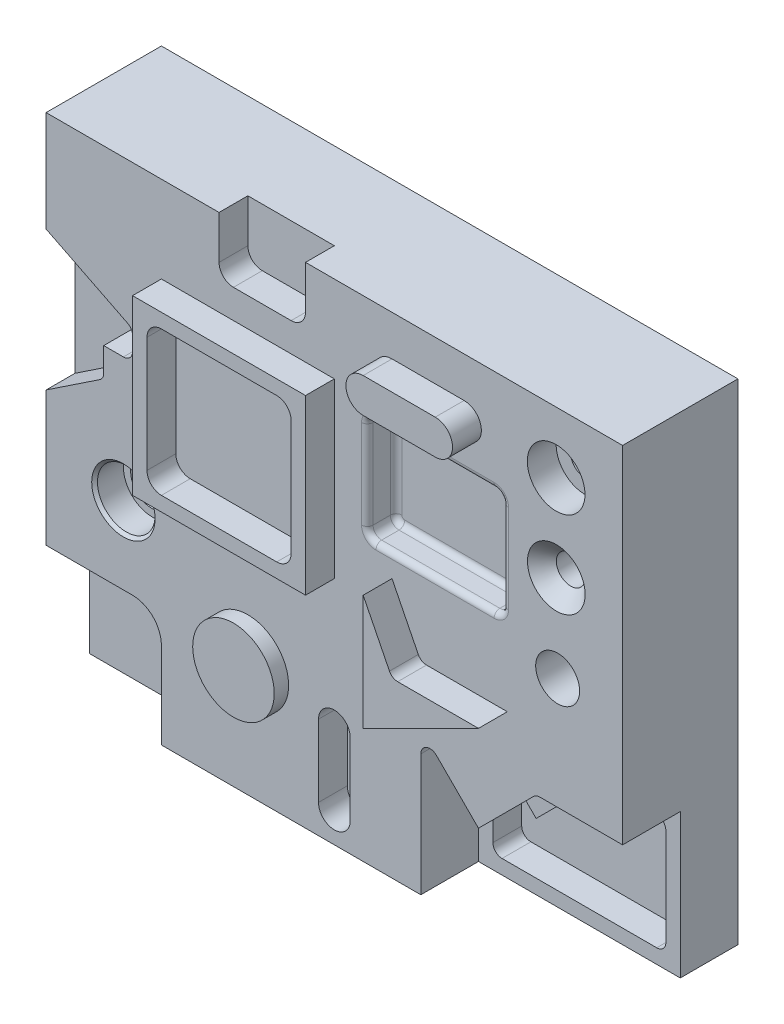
ISO-10303-21;
HEADER;
FILE_DESCRIPTION(('STEP AP214'),'2;1');
FILE_NAME('part.step','',(''),(''),'','','');
FILE_SCHEMA(('AUTOMOTIVE_DESIGN { 1 0 10303 214 1 1 1 1 }'));
ENDSEC;
DATA;
#1=APPLICATION_CONTEXT('core data for automotive mechanical design processes');
#2=APPLICATION_PROTOCOL_DEFINITION('international standard','automotive_design',2000,#1);
#3=PRODUCT_CONTEXT('',#1,'mechanical');
#4=PRODUCT('Part','Part','',(#3));
#5=PRODUCT_RELATED_PRODUCT_CATEGORY('part','',(#4));
#6=PRODUCT_DEFINITION_FORMATION('','',#4);
#7=PRODUCT_DEFINITION_CONTEXT('part definition',#1,'design');
#8=PRODUCT_DEFINITION('design','',#6,#7);
#9=PRODUCT_DEFINITION_SHAPE('','',#8);
#10=(LENGTH_UNIT() NAMED_UNIT(*) SI_UNIT(.MILLI.,.METRE.));
#11=(NAMED_UNIT(*) PLANE_ANGLE_UNIT() SI_UNIT($,.RADIAN.));
#12=(NAMED_UNIT(*) SI_UNIT($,.STERADIAN.) SOLID_ANGLE_UNIT());
#13=UNCERTAINTY_MEASURE_WITH_UNIT(LENGTH_MEASURE(1.E-05),#10,'distance_accuracy_value','');
#14=(GEOMETRIC_REPRESENTATION_CONTEXT(3) GLOBAL_UNCERTAINTY_ASSIGNED_CONTEXT((#13)) GLOBAL_UNIT_ASSIGNED_CONTEXT((#10,
#11,#12)) REPRESENTATION_CONTEXT('',''));
#15=CARTESIAN_POINT('',(0.,0.,0.));
#16=DIRECTION('',(0.,0.,1.));
#17=DIRECTION('',(1.,0.,0.));
#18=AXIS2_PLACEMENT_3D('',#15,#16,#17);
#19=CARTESIAN_POINT('',(20.,70.,50.));
#20=DIRECTION('',(0.,0.,-1.));
#21=DIRECTION('',(-1.,0.,0.));
#22=AXIS2_PLACEMENT_3D('',#19,#20,#21);
#23=CYLINDRICAL_SURFACE('',#22,6.);
#24=DIRECTION('',(0.,0.,-1.));
#25=VECTOR('',#24,1.);
#26=CARTESIAN_POINT('',(20.,64.,50.));
#27=LINE('',#26,#25);
#28=CARTESIAN_POINT('',(20.,64.,50.));
#29=VERTEX_POINT('',#28);
#30=CARTESIAN_POINT('',(20.,64.,40.));
#31=VERTEX_POINT('',#30);
#32=EDGE_CURVE('E725',#29,#31,#27,.T.);
#33=ORIENTED_EDGE('',*,*,#32,.F.);
#34=CARTESIAN_POINT('',(20.,70.,50.));
#35=DIRECTION('',(0.,0.,1.));
#36=DIRECTION('',(1.,0.,0.));
#37=AXIS2_PLACEMENT_3D('',#34,#35,#36);
#38=CIRCLE('',#37,6.);
#39=CARTESIAN_POINT('',(20.,76.,50.));
#40=VERTEX_POINT('',#39);
#41=EDGE_CURVE('E655',#40,#29,#38,.T.);
#42=ORIENTED_EDGE('',*,*,#41,.F.);
#43=DIRECTION('',(0.,0.,-1.));
#44=VECTOR('',#43,1.);
#45=CARTESIAN_POINT('',(20.,76.,50.));
#46=LINE('',#45,#44);
#47=CARTESIAN_POINT('',(20.,76.,40.));
#48=VERTEX_POINT('',#47);
#49=EDGE_CURVE('E1288',#40,#48,#46,.T.);
#50=ORIENTED_EDGE('',*,*,#49,.T.);
#51=CARTESIAN_POINT('',(20.,70.,40.));
#52=DIRECTION('',(0.,0.,1.));
#53=DIRECTION('',(1.,0.,0.));
#54=AXIS2_PLACEMENT_3D('',#51,#52,#53);
#55=CIRCLE('',#54,6.);
#56=EDGE_CURVE('E631',#48,#31,#55,.T.);
#57=ORIENTED_EDGE('',*,*,#56,.T.);
#58=EDGE_LOOP('',(#33,#42,#50,#57));
#59=FACE_BOUND('',#58,.T.);
#60=ADVANCED_FACE('F45',(#59),#23,.T.);
#61=CARTESIAN_POINT('',(20.,64.,50.));
#62=DIRECTION('',(0.,1.,0.));
#63=DIRECTION('',(0.,0.,1.));
#64=AXIS2_PLACEMENT_3D('',#61,#62,#63);
#65=PLANE('',#64);
#66=DIRECTION('',(0.,0.,-1.));
#67=VECTOR('',#66,1.);
#68=CARTESIAN_POINT('',(45.,64.,50.));
#69=LINE('',#68,#67);
#70=CARTESIAN_POINT('',(45.,64.,50.));
#71=VERTEX_POINT('',#70);
#72=CARTESIAN_POINT('',(45.,64.,40.));
#73=VERTEX_POINT('',#72);
#74=EDGE_CURVE('E730',#71,#73,#69,.T.);
#75=ORIENTED_EDGE('',*,*,#74,.F.);
#76=DIRECTION('',(1.,0.,0.));
#77=VECTOR('',#76,1.);
#78=CARTESIAN_POINT('',(20.,64.,50.));
#79=LINE('',#78,#77);
#80=EDGE_CURVE('E659',#29,#71,#79,.T.);
#81=ORIENTED_EDGE('',*,*,#80,.F.);
#82=ORIENTED_EDGE('',*,*,#32,.T.);
#83=DIRECTION('',(1.,0.,0.));
#84=VECTOR('',#83,1.);
#85=CARTESIAN_POINT('',(20.,64.,40.));
#86=LINE('',#85,#84);
#87=EDGE_CURVE('E636',#31,#73,#86,.T.);
#88=ORIENTED_EDGE('',*,*,#87,.T.);
#89=EDGE_LOOP('',(#75,#81,#82,#88));
#90=FACE_BOUND('',#89,.T.);
#91=ADVANCED_FACE('F911',(#90),#65,.F.);
#92=CARTESIAN_POINT('',(45.,70.,50.));
#93=DIRECTION('',(0.,0.,-1.));
#94=DIRECTION('',(-1.,0.,0.));
#95=AXIS2_PLACEMENT_3D('',#92,#93,#94);
#96=CYLINDRICAL_SURFACE('',#95,6.);
#97=DIRECTION('',(0.,0.,-1.));
#98=VECTOR('',#97,1.);
#99=CARTESIAN_POINT('',(45.,76.,50.));
#100=LINE('',#99,#98);
#101=CARTESIAN_POINT('',(45.,76.,50.));
#102=VERTEX_POINT('',#101);
#103=CARTESIAN_POINT('',(45.,76.,40.));
#104=VERTEX_POINT('',#103);
#105=EDGE_CURVE('E1291',#102,#104,#100,.T.);
#106=ORIENTED_EDGE('',*,*,#105,.F.);
#107=CARTESIAN_POINT('',(45.,70.,50.));
#108=DIRECTION('',(0.,0.,1.));
#109=DIRECTION('',(1.,0.,0.));
#110=AXIS2_PLACEMENT_3D('',#107,#108,#109);
#111=CIRCLE('',#110,6.);
#112=EDGE_CURVE('E672',#71,#102,#111,.T.);
#113=ORIENTED_EDGE('',*,*,#112,.F.);
#114=ORIENTED_EDGE('',*,*,#74,.T.);
#115=CARTESIAN_POINT('',(45.,70.,40.));
#116=DIRECTION('',(0.,0.,1.));
#117=DIRECTION('',(1.,0.,0.));
#118=AXIS2_PLACEMENT_3D('',#115,#116,#117);
#119=CIRCLE('',#118,6.);
#120=EDGE_CURVE('E648',#73,#104,#119,.T.);
#121=ORIENTED_EDGE('',*,*,#120,.T.);
#122=EDGE_LOOP('',(#106,#113,#114,#121));
#123=FACE_BOUND('',#122,.T.);
#124=ADVANCED_FACE('F917',(#123),#96,.T.);
#125=CARTESIAN_POINT('',(45.,76.,50.));
#126=DIRECTION('',(0.,-1.,0.));
#127=DIRECTION('',(0.,0.,-1.));
#128=AXIS2_PLACEMENT_3D('',#125,#126,#127);
#129=PLANE('',#128);
#130=DIRECTION('',(-1.,0.,0.));
#131=VECTOR('',#130,1.);
#132=CARTESIAN_POINT('',(45.,76.,50.));
#133=LINE('',#132,#131);
#134=EDGE_CURVE('E675',#102,#40,#133,.T.);
#135=ORIENTED_EDGE('',*,*,#134,.F.);
#136=ORIENTED_EDGE('',*,*,#105,.T.);
#137=DIRECTION('',(-1.,0.,0.));
#138=VECTOR('',#137,1.);
#139=CARTESIAN_POINT('',(45.,76.,40.));
#140=LINE('',#139,#138);
#141=EDGE_CURVE('E651',#104,#48,#140,.T.);
#142=ORIENTED_EDGE('',*,*,#141,.T.);
#143=ORIENTED_EDGE('',*,*,#49,.F.);
#144=EDGE_LOOP('',(#135,#136,#142,#143));
#145=FACE_BOUND('',#144,.T.);
#146=ADVANCED_FACE('F924',(#145),#129,.F.);
#147=CARTESIAN_POINT('',(20.,70.,50.));
#148=DIRECTION('',(0.,0.,1.));
#149=DIRECTION('',(1.,0.,0.));
#150=AXIS2_PLACEMENT_3D('',#147,#148,#149);
#151=PLANE('',#150);
#152=ORIENTED_EDGE('',*,*,#41,.T.);
#153=ORIENTED_EDGE('',*,*,#80,.T.);
#154=ORIENTED_EDGE('',*,*,#112,.T.);
#155=ORIENTED_EDGE('',*,*,#134,.T.);
#156=EDGE_LOOP('',(#152,#153,#154,#155));
#157=FACE_BOUND('',#156,.T.);
#158=ADVANCED_FACE('F922',(#157),#151,.T.);
#159=CARTESIAN_POINT('',(-100.,-80.,40.));
#160=DIRECTION('',(0.,0.,-1.));
#161=DIRECTION('',(-1.,0.,0.));
#162=AXIS2_PLACEMENT_3D('',#159,#160,#161);
#163=PLANE('',#162);
#164=DIRECTION('',(1.,0.,0.));
#165=VECTOR('',#164,1.);
#166=CARTESIAN_POINT('',(-100.,15.78,40.));
#167=LINE('',#166,#165);
#168=CARTESIAN_POINT('',(55.42,15.78,40.));
#169=VERTEX_POINT('',#168);
#170=CARTESIAN_POINT('',(14.43,15.78,40.));
#171=VERTEX_POINT('',#170);
#172=EDGE_CURVE('E1815',#169,#171,#167,.F.);
#173=ORIENTED_EDGE('',*,*,#172,.T.);
#174=CARTESIAN_POINT('',(14.43,20.78,40.));
#175=DIRECTION('',(0.,0.,-1.));
#176=DIRECTION('',(-1.,0.,0.));
#177=AXIS2_PLACEMENT_3D('',#174,#175,#176);
#178=CIRCLE('',#177,5.);
#179=CARTESIAN_POINT('',(9.43,20.78,40.));
#180=VERTEX_POINT('',#179);
#181=EDGE_CURVE('E1809',#171,#180,#178,.T.);
#182=ORIENTED_EDGE('',*,*,#181,.T.);
#183=DIRECTION('',(0.,-1.,0.));
#184=VECTOR('',#183,1.);
#185=CARTESIAN_POINT('',(9.42999999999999,-80.,40.));
#186=LINE('',#185,#184);
#187=CARTESIAN_POINT('',(9.43,51.61,40.));
#188=VERTEX_POINT('',#187);
#189=EDGE_CURVE('E1838',#180,#188,#186,.F.);
#190=ORIENTED_EDGE('',*,*,#189,.T.);
#191=CARTESIAN_POINT('',(14.43,51.61,40.));
#192=DIRECTION('',(0.,0.,-1.));
#193=DIRECTION('',(-1.,0.,0.));
#194=AXIS2_PLACEMENT_3D('',#191,#192,#193);
#195=CIRCLE('',#194,5.);
#196=CARTESIAN_POINT('',(14.43,56.61,40.));
#197=VERTEX_POINT('',#196);
#198=EDGE_CURVE('E1840',#188,#197,#195,.T.);
#199=ORIENTED_EDGE('',*,*,#198,.T.);
#200=DIRECTION('',(-1.,0.,0.));
#201=VECTOR('',#200,1.);
#202=CARTESIAN_POINT('',(-100.,56.61,40.));
#203=LINE('',#202,#201);
#204=CARTESIAN_POINT('',(55.42,56.61,40.));
#205=VERTEX_POINT('',#204);
#206=EDGE_CURVE('E1843',#197,#205,#203,.F.);
#207=ORIENTED_EDGE('',*,*,#206,.T.);
#208=CARTESIAN_POINT('',(55.42,51.61,40.));
#209=DIRECTION('',(0.,0.,-1.));
#210=DIRECTION('',(-1.,0.,0.));
#211=AXIS2_PLACEMENT_3D('',#208,#209,#210);
#212=CIRCLE('',#211,5.);
#213=CARTESIAN_POINT('',(60.42,51.61,40.));
#214=VERTEX_POINT('',#213);
#215=EDGE_CURVE('E1914',#205,#214,#212,.T.);
#216=ORIENTED_EDGE('',*,*,#215,.T.);
#217=DIRECTION('',(0.,1.,0.));
#218=VECTOR('',#217,1.);
#219=CARTESIAN_POINT('',(60.42,-80.,40.));
#220=LINE('',#219,#218);
#221=CARTESIAN_POINT('',(60.42,20.78,40.));
#222=VERTEX_POINT('',#221);
#223=EDGE_CURVE('E1913',#214,#222,#220,.F.);
#224=ORIENTED_EDGE('',*,*,#223,.T.);
#225=CARTESIAN_POINT('',(55.42,20.78,40.));
#226=DIRECTION('',(0.,0.,-1.));
#227=DIRECTION('',(-1.,0.,0.));
#228=AXIS2_PLACEMENT_3D('',#225,#226,#227);
#229=CIRCLE('',#228,5.);
#230=EDGE_CURVE('E1912',#222,#169,#229,.T.);
#231=ORIENTED_EDGE('',*,*,#230,.T.);
#232=EDGE_LOOP('',(#173,#182,#190,#199,#207,#216,#224,#231));
#233=FACE_BOUND('',#232,.T.);
#234=CARTESIAN_POINT('',(77.,38.7257097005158,40.));
#235=DIRECTION('',(0.,0.,-1.));
#236=DIRECTION('',(-1.,0.,0.));
#237=AXIS2_PLACEMENT_3D('',#234,#235,#236);
#238=CIRCLE('',#237,10.);
#239=CARTESIAN_POINT('',(67.,38.7257097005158,40.));
#240=VERTEX_POINT('',#239);
#241=EDGE_CURVE('E1834',#240,#240,#238,.T.);
#242=ORIENTED_EDGE('',*,*,#241,.T.);
#243=EDGE_LOOP('',(#242));
#244=FACE_BOUND('',#243,.T.);
#245=CARTESIAN_POINT('',(77.47,8.7257097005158,40.));
#246=DIRECTION('',(0.,0.,1.));
#247=DIRECTION('',(1.,0.,0.));
#248=AXIS2_PLACEMENT_3D('',#245,#246,#247);
#249=CIRCLE('',#248,7.62);
#250=CARTESIAN_POINT('',(85.09,8.7257097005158,40.));
#251=VERTEX_POINT('',#250);
#252=EDGE_CURVE('E872',#251,#251,#249,.T.);
#253=ORIENTED_EDGE('',*,*,#252,.F.);
#254=EDGE_LOOP('',(#253));
#255=FACE_BOUND('',#254,.T.);
#256=CARTESIAN_POINT('',(-73.175,-13.095675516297,40.));
#257=DIRECTION('',(0.,0.,-1.));
#258=DIRECTION('',(-1.,0.,0.));
#259=AXIS2_PLACEMENT_3D('',#256,#257,#258);
#260=CIRCLE('',#259,11.);
#261=CARTESIAN_POINT('',(-84.175,-13.095675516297,40.));
#262=VERTEX_POINT('',#261);
#263=EDGE_CURVE('E846',#262,#262,#260,.T.);
#264=ORIENTED_EDGE('',*,*,#263,.T.);
#265=EDGE_LOOP('',(#264));
#266=FACE_BOUND('',#265,.T.);
#267=DIRECTION('',(0.,-1.,0.));
#268=VECTOR('',#267,1.);
#269=CARTESIAN_POINT('',(-5.5,-45.,40.));
#270=LINE('',#269,#268);
#271=CARTESIAN_POINT('',(-5.5,-45.,40.));
#272=VERTEX_POINT('',#271);
#273=CARTESIAN_POINT('',(-5.5,-70.,40.));
#274=VERTEX_POINT('',#273);
#275=EDGE_CURVE('E571',#272,#274,#270,.T.);
#276=ORIENTED_EDGE('',*,*,#275,.F.);
#277=CARTESIAN_POINT('',(0.,-45.,40.));
#278=DIRECTION('',(0.,0.,1.));
#279=DIRECTION('',(1.,0.,0.));
#280=AXIS2_PLACEMENT_3D('',#277,#278,#279);
#281=CIRCLE('',#280,5.5);
#282=CARTESIAN_POINT('',(5.5,-45.,40.));
#283=VERTEX_POINT('',#282);
#284=EDGE_CURVE('E575',#283,#272,#281,.T.);
#285=ORIENTED_EDGE('',*,*,#284,.F.);
#286=DIRECTION('',(0.,-1.,0.));
#287=VECTOR('',#286,1.);
#288=CARTESIAN_POINT('',(5.5,-45.,40.));
#289=LINE('',#288,#287);
#290=CARTESIAN_POINT('',(5.5,-70.,40.));
#291=VERTEX_POINT('',#290);
#292=EDGE_CURVE('E580',#283,#291,#289,.T.);
#293=ORIENTED_EDGE('',*,*,#292,.T.);
#294=CARTESIAN_POINT('',(0.,-70.,40.));
#295=DIRECTION('',(0.,0.,1.));
#296=DIRECTION('',(1.,0.,0.));
#297=AXIS2_PLACEMENT_3D('',#294,#295,#296);
#298=CIRCLE('',#297,5.5);
#299=EDGE_CURVE('E559',#274,#291,#298,.T.);
#300=ORIENTED_EDGE('',*,*,#299,.F.);
#301=EDGE_LOOP('',(#276,#285,#293,#300));
#302=FACE_BOUND('',#301,.T.);
#303=CARTESIAN_POINT('',(-30.,-40.,40.));
#304=DIRECTION('',(0.,0.,-1.));
#305=DIRECTION('',(-1.,0.,0.));
#306=AXIS2_PLACEMENT_3D('',#303,#304,#305);
#307=CIRCLE('',#306,14.142135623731);
#308=CARTESIAN_POINT('',(-44.142135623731,-40.,40.));
#309=VERTEX_POINT('',#308);
#310=EDGE_CURVE('E1649',#309,#309,#307,.F.);
#311=ORIENTED_EDGE('',*,*,#310,.F.);
#312=EDGE_LOOP('',(#311));
#313=FACE_BOUND('',#312,.T.);
#314=DIRECTION('',(0.,-1.,0.));
#315=VECTOR('',#314,1.);
#316=CARTESIAN_POINT('',(-60.,60.,40.));
#317=LINE('',#316,#315);
#318=CARTESIAN_POINT('',(-60.,60.,40.));
#319=VERTEX_POINT('',#318);
#320=CARTESIAN_POINT('',(-60.,0.,40.));
#321=VERTEX_POINT('',#320);
#322=EDGE_CURVE('E2654',#319,#321,#317,.T.);
#323=ORIENTED_EDGE('',*,*,#322,.F.);
#324=DIRECTION('',(1.,0.,0.));
#325=VECTOR('',#324,1.);
#326=CARTESIAN_POINT('',(-60.,60.,40.));
#327=LINE('',#326,#325);
#328=CARTESIAN_POINT('',(0.,60.,40.));
#329=VERTEX_POINT('',#328);
#330=EDGE_CURVE('E686',#319,#329,#327,.T.);
#331=ORIENTED_EDGE('',*,*,#330,.T.);
#332=DIRECTION('',(0.,1.,0.));
#333=VECTOR('',#332,1.);
#334=CARTESIAN_POINT('',(0.,0.,40.));
#335=LINE('',#334,#333);
#336=CARTESIAN_POINT('',(0.,0.,40.));
#337=VERTEX_POINT('',#336);
#338=EDGE_CURVE('E691',#337,#329,#335,.T.);
#339=ORIENTED_EDGE('',*,*,#338,.F.);
#340=DIRECTION('',(-1.,0.,0.));
#341=VECTOR('',#340,1.);
#342=CARTESIAN_POINT('',(0.,0.,40.));
#343=LINE('',#342,#341);
#344=EDGE_CURVE('E2658',#337,#321,#343,.T.);
#345=ORIENTED_EDGE('',*,*,#344,.T.);
#346=EDGE_LOOP('',(#323,#331,#339,#345));
#347=FACE_BOUND('',#346,.T.);
#348=DIRECTION('',(0.,-1.,0.));
#349=VECTOR('',#348,1.);
#350=CARTESIAN_POINT('',(-100.,90.,40.));
#351=LINE('',#350,#349);
#352=CARTESIAN_POINT('',(-100.,6.66666666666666,40.));
#353=VERTEX_POINT('',#352);
#354=CARTESIAN_POINT('',(-100.,-40.,40.));
#355=VERTEX_POINT('',#354);
#356=EDGE_CURVE('E1479',#353,#355,#351,.T.);
#357=ORIENTED_EDGE('',*,*,#356,.T.);
#358=DIRECTION('',(-1.,0.,0.));
#359=VECTOR('',#358,1.);
#360=CARTESIAN_POINT('',(-70.,-40.,40.));
#361=LINE('',#360,#359);
#362=CARTESIAN_POINT('',(-70.,-40.,40.));
#363=VERTEX_POINT('',#362);
#364=EDGE_CURVE('E737',#363,#355,#361,.T.);
#365=ORIENTED_EDGE('',*,*,#364,.F.);
#366=CARTESIAN_POINT('',(-70.,-50.,40.));
#367=DIRECTION('',(0.,0.,-1.));
#368=DIRECTION('',(-1.,0.,0.));
#369=AXIS2_PLACEMENT_3D('',#366,#367,#368);
#370=CIRCLE('',#369,10.);
#371=CARTESIAN_POINT('',(-60.,-50.,40.));
#372=VERTEX_POINT('',#371);
#373=EDGE_CURVE('E2759',#363,#372,#370,.T.);
#374=ORIENTED_EDGE('',*,*,#373,.T.);
#375=DIRECTION('',(0.,-1.,0.));
#376=VECTOR('',#375,1.);
#377=CARTESIAN_POINT('',(-60.,-50.,40.));
#378=LINE('',#377,#376);
#379=CARTESIAN_POINT('',(-60.,-80.,40.));
#380=VERTEX_POINT('',#379);
#381=EDGE_CURVE('E736',#372,#380,#378,.T.);
#382=ORIENTED_EDGE('',*,*,#381,.T.);
#383=DIRECTION('',(-1.,0.,0.));
#384=VECTOR('',#383,1.);
#385=CARTESIAN_POINT('',(100.,-80.,40.));
#386=LINE('',#385,#384);
#387=CARTESIAN_POINT('',(30.,-80.,40.));
#388=VERTEX_POINT('',#387);
#389=EDGE_CURVE('E1483',#388,#380,#386,.T.);
#390=ORIENTED_EDGE('',*,*,#389,.F.);
#391=DIRECTION('',(0.,-1.,0.));
#392=VECTOR('',#391,1.);
#393=CARTESIAN_POINT('',(30.,-30.,40.));
#394=LINE('',#393,#392);
#395=CARTESIAN_POINT('',(30.,-37.6651280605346,40.));
#396=VERTEX_POINT('',#395);
#397=EDGE_CURVE('E1675',#396,#388,#394,.T.);
#398=ORIENTED_EDGE('',*,*,#397,.F.);
#399=CARTESIAN_POINT('',(33.175,-37.6651280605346,40.));
#400=DIRECTION('',(0.,0.,-1.));
#401=DIRECTION('',(-1.,0.,0.));
#402=AXIS2_PLACEMENT_3D('',#399,#400,#401);
#403=CIRCLE('',#402,3.175);
#404=CARTESIAN_POINT('',(35.4200640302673,-35.4200640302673,40.));
#405=VERTEX_POINT('',#404);
#406=EDGE_CURVE('E1690',#396,#405,#403,.T.);
#407=ORIENTED_EDGE('',*,*,#406,.T.);
#408=DIRECTION('',(0.707106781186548,-0.707106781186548,0.));
#409=VECTOR('',#408,1.);
#410=CARTESIAN_POINT('',(30.,-30.,40.));
#411=LINE('',#410,#409);
#412=CARTESIAN_POINT('',(50.,-50.,40.));
#413=VERTEX_POINT('',#412);
#414=EDGE_CURVE('E1663',#405,#413,#411,.T.);
#415=ORIENTED_EDGE('',*,*,#414,.T.);
#416=DIRECTION('',(-0.707106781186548,-0.707106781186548,0.));
#417=VECTOR('',#416,1.);
#418=CARTESIAN_POINT('',(70.,-30.,40.));
#419=LINE('',#418,#417);
#420=CARTESIAN_POINT('',(69.0700640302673,-30.9299359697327,40.));
#421=VERTEX_POINT('',#420);
#422=EDGE_CURVE('E1660',#421,#413,#419,.T.);
#423=ORIENTED_EDGE('',*,*,#422,.F.);
#424=CARTESIAN_POINT('',(71.3151280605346,-33.175,40.));
#425=DIRECTION('',(0.,0.,-1.));
#426=DIRECTION('',(-1.,0.,0.));
#427=AXIS2_PLACEMENT_3D('',#424,#425,#426);
#428=CIRCLE('',#427,3.175);
#429=CARTESIAN_POINT('',(71.3151280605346,-30.,40.));
#430=VERTEX_POINT('',#429);
#431=EDGE_CURVE('E1414',#421,#430,#428,.T.);
#432=ORIENTED_EDGE('',*,*,#431,.T.);
#433=DIRECTION('',(1.,0.,0.));
#434=VECTOR('',#433,1.);
#435=CARTESIAN_POINT('',(70.,-30.,40.));
#436=LINE('',#435,#434);
#437=CARTESIAN_POINT('',(100.,-30.,40.));
#438=VERTEX_POINT('',#437);
#439=EDGE_CURVE('E1664',#430,#438,#436,.T.);
#440=ORIENTED_EDGE('',*,*,#439,.T.);
#441=DIRECTION('',(0.,1.,0.));
#442=VECTOR('',#441,1.);
#443=CARTESIAN_POINT('',(100.,-80.,40.));
#444=LINE('',#443,#442);
#445=CARTESIAN_POINT('',(100.,90.,40.));
#446=VERTEX_POINT('',#445);
#447=EDGE_CURVE('E1497',#438,#446,#444,.T.);
#448=ORIENTED_EDGE('',*,*,#447,.T.);
#449=DIRECTION('',(1.,0.,0.));
#450=VECTOR('',#449,1.);
#451=CARTESIAN_POINT('',(-100.,90.,40.));
#452=LINE('',#451,#450);
#453=CARTESIAN_POINT('',(-10.,90.,40.));
#454=VERTEX_POINT('',#453);
#455=EDGE_CURVE('E1498',#454,#446,#452,.T.);
#456=ORIENTED_EDGE('',*,*,#455,.F.);
#457=DIRECTION('',(0.,1.,0.));
#458=VECTOR('',#457,1.);
#459=CARTESIAN_POINT('',(-10.,75.,40.));
#460=LINE('',#459,#458);
#461=CARTESIAN_POINT('',(-10.,75.,40.));
#462=VERTEX_POINT('',#461);
#463=EDGE_CURVE('E1515',#462,#454,#460,.T.);
#464=ORIENTED_EDGE('',*,*,#463,.F.);
#465=CARTESIAN_POINT('',(-15.,75.,40.));
#466=DIRECTION('',(0.,0.,-1.));
#467=DIRECTION('',(-1.,0.,0.));
#468=AXIS2_PLACEMENT_3D('',#465,#466,#467);
#469=CIRCLE('',#468,5.);
#470=CARTESIAN_POINT('',(-15.,70.,40.));
#471=VERTEX_POINT('',#470);
#472=EDGE_CURVE('E1518',#462,#471,#469,.T.);
#473=ORIENTED_EDGE('',*,*,#472,.T.);
#474=DIRECTION('',(-1.,0.,0.));
#475=VECTOR('',#474,1.);
#476=CARTESIAN_POINT('',(-15.,70.,40.));
#477=LINE('',#476,#475);
#478=CARTESIAN_POINT('',(-35.,70.,40.));
#479=VERTEX_POINT('',#478);
#480=EDGE_CURVE('E1778',#471,#479,#477,.T.);
#481=ORIENTED_EDGE('',*,*,#480,.T.);
#482=CARTESIAN_POINT('',(-35.,75.,40.));
#483=DIRECTION('',(0.,0.,1.));
#484=DIRECTION('',(1.,0.,0.));
#485=AXIS2_PLACEMENT_3D('',#482,#483,#484);
#486=CIRCLE('',#485,5.);
#487=CARTESIAN_POINT('',(-40.,75.,40.));
#488=VERTEX_POINT('',#487);
#489=EDGE_CURVE('E1577',#488,#479,#486,.T.);
#490=ORIENTED_EDGE('',*,*,#489,.F.);
#491=DIRECTION('',(0.,-1.,0.));
#492=VECTOR('',#491,1.);
#493=CARTESIAN_POINT('',(-40.,100.,40.));
#494=LINE('',#493,#492);
#495=CARTESIAN_POINT('',(-40.,90.,40.));
#496=VERTEX_POINT('',#495);
#497=EDGE_CURVE('E1568',#496,#488,#494,.T.);
#498=ORIENTED_EDGE('',*,*,#497,.F.);
#499=CARTESIAN_POINT('',(-100.,90.,40.));
#500=VERTEX_POINT('',#499);
#501=EDGE_CURVE('E1494',#500,#496,#452,.T.);
#502=ORIENTED_EDGE('',*,*,#501,.F.);
#503=CARTESIAN_POINT('',(-100.,55.,40.));
#504=VERTEX_POINT('',#503);
#505=EDGE_CURVE('E1473',#500,#504,#351,.T.);
#506=ORIENTED_EDGE('',*,*,#505,.T.);
#507=DIRECTION('',(-0.894427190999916,0.447213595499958,0.));
#508=VECTOR('',#507,1.);
#509=CARTESIAN_POINT('',(-70.,40.,40.));
#510=LINE('',#509,#508);
#511=CARTESIAN_POINT('',(-71.7550968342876,40.8775484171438,40.));
#512=VERTEX_POINT('',#511);
#513=EDGE_CURVE('E1590',#512,#504,#510,.T.);
#514=ORIENTED_EDGE('',*,*,#513,.F.);
#515=CARTESIAN_POINT('',(-73.175,38.037742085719,40.));
#516=DIRECTION('',(0.,0.,-1.));
#517=DIRECTION('',(-1.,0.,0.));
#518=AXIS2_PLACEMENT_3D('',#515,#516,#517);
#519=CIRCLE('',#518,3.175);
#520=CARTESIAN_POINT('',(-70.,38.037742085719,40.));
#521=VERTEX_POINT('',#520);
#522=EDGE_CURVE('E795',#512,#521,#519,.T.);
#523=ORIENTED_EDGE('',*,*,#522,.T.);
#524=DIRECTION('',(0.,1.,0.));
#525=VECTOR('',#524,1.);
#526=CARTESIAN_POINT('',(-70.,30.,40.));
#527=LINE('',#526,#525);
#528=CARTESIAN_POINT('',(-70.,33.175,40.));
#529=VERTEX_POINT('',#528);
#530=EDGE_CURVE('E1594',#529,#521,#527,.T.);
#531=ORIENTED_EDGE('',*,*,#530,.F.);
#532=CARTESIAN_POINT('',(-73.175,33.175,40.));
#533=DIRECTION('',(0.,0.,-1.));
#534=DIRECTION('',(-1.,0.,0.));
#535=AXIS2_PLACEMENT_3D('',#532,#533,#534);
#536=CIRCLE('',#535,3.175);
#537=CARTESIAN_POINT('',(-73.175,30.,40.));
#538=VERTEX_POINT('',#537);
#539=EDGE_CURVE('E2691',#529,#538,#536,.T.);
#540=ORIENTED_EDGE('',*,*,#539,.T.);
#541=DIRECTION('',(1.,0.,0.));
#542=VECTOR('',#541,1.);
#543=CARTESIAN_POINT('',(-80.,30.,40.));
#544=LINE('',#543,#542);
#545=CARTESIAN_POINT('',(-80.,30.,40.));
#546=VERTEX_POINT('',#545);
#547=EDGE_CURVE('E1597',#546,#538,#544,.T.);
#548=ORIENTED_EDGE('',*,*,#547,.F.);
#549=DIRECTION('',(0.,1.,0.));
#550=VECTOR('',#549,1.);
#551=CARTESIAN_POINT('',(-80.,20.,40.));
#552=LINE('',#551,#550);
#553=CARTESIAN_POINT('',(-80.,21.6992084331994,40.));
#554=VERTEX_POINT('',#553);
#555=EDGE_CURVE('E1602',#554,#546,#552,.T.);
#556=ORIENTED_EDGE('',*,*,#555,.F.);
#557=CARTESIAN_POINT('',(-83.175,21.6992084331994,40.));
#558=DIRECTION('',(0.,0.,-1.));
#559=DIRECTION('',(-1.,0.,0.));
#560=AXIS2_PLACEMENT_3D('',#557,#558,#559);
#561=CIRCLE('',#560,3.175);
#562=CARTESIAN_POINT('',(-81.4138268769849,19.0574487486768,40.));
#563=VERTEX_POINT('',#562);
#564=EDGE_CURVE('E1421',#554,#563,#561,.T.);
#565=ORIENTED_EDGE('',*,*,#564,.T.);
#566=DIRECTION('',(0.832050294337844,0.554700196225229,0.));
#567=VECTOR('',#566,1.);
#568=CARTESIAN_POINT('',(-110.,0.,40.));
#569=LINE('',#568,#567);
#570=EDGE_CURVE('E1443',#353,#563,#569,.T.);
#571=ORIENTED_EDGE('',*,*,#570,.F.);
#572=EDGE_LOOP('',(#357,#365,#374,#382,#390,#398,#407,#415,#423,#432,#440,#448,#456,#464,#473,
#481,#490,#498,#502,#506,#514,#523,#531,#540,#548,#556,#565,#571));
#573=FACE_BOUND('',#572,.T.);
#574=DIRECTION('',(0.447213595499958,-0.894427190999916,0.));
#575=VECTOR('',#574,1.);
#576=CARTESIAN_POINT('',(20.,10.,40.));
#577=LINE('',#576,#575);
#578=CARTESIAN_POINT('',(20.,10.,40.));
#579=VERTEX_POINT('',#578);
#580=CARTESIAN_POINT('',(29.1224515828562,-8.24490316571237,40.));
#581=VERTEX_POINT('',#580);
#582=EDGE_CURVE('E757',#579,#581,#577,.T.);
#583=ORIENTED_EDGE('',*,*,#582,.T.);
#584=CARTESIAN_POINT('',(31.9622579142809,-6.825,40.));
#585=DIRECTION('',(0.,0.,-1.));
#586=DIRECTION('',(-1.,0.,0.));
#587=AXIS2_PLACEMENT_3D('',#584,#585,#586);
#588=CIRCLE('',#587,3.175);
#589=CARTESIAN_POINT('',(31.9622579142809,-10.,40.));
#590=VERTEX_POINT('',#589);
#591=EDGE_CURVE('E794',#581,#590,#588,.F.);
#592=ORIENTED_EDGE('',*,*,#591,.T.);
#593=DIRECTION('',(1.,0.,0.));
#594=VECTOR('',#593,1.);
#595=CARTESIAN_POINT('',(30.,-10.,40.));
#596=LINE('',#595,#594);
#597=CARTESIAN_POINT('',(60.,-10.,40.));
#598=VERTEX_POINT('',#597);
#599=EDGE_CURVE('E773',#590,#598,#596,.T.);
#600=ORIENTED_EDGE('',*,*,#599,.T.);
#601=DIRECTION('',(-0.894427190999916,-0.447213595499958,0.));
#602=VECTOR('',#601,1.);
#603=CARTESIAN_POINT('',(60.,-10.,40.));
#604=LINE('',#603,#602);
#605=CARTESIAN_POINT('',(20.,-30.,40.));
#606=VERTEX_POINT('',#605);
#607=EDGE_CURVE('E2671',#598,#606,#604,.T.);
#608=ORIENTED_EDGE('',*,*,#607,.T.);
#609=DIRECTION('',(0.,1.,0.));
#610=VECTOR('',#609,1.);
#611=CARTESIAN_POINT('',(20.,-30.,40.));
#612=LINE('',#611,#610);
#613=EDGE_CURVE('E2677',#606,#579,#612,.T.);
#614=ORIENTED_EDGE('',*,*,#613,.T.);
#615=EDGE_LOOP('',(#583,#592,#600,#608,#614));
#616=FACE_BOUND('',#615,.T.);
#617=CARTESIAN_POINT('',(76.9434257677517,68.7257097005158,39.9999999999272));
#618=DIRECTION('',(0.,0.,1.));
#619=DIRECTION('',(1.,0.,0.));
#620=AXIS2_PLACEMENT_3D('',#617,#618,#619);
#621=CIRCLE('',#620,10.);
#622=CARTESIAN_POINT('',(86.9434257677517,68.7257097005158,39.9999999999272));
#623=VERTEX_POINT('',#622);
#624=EDGE_CURVE('E614',#623,#623,#621,.T.);
#625=ORIENTED_EDGE('',*,*,#624,.F.);
#626=EDGE_LOOP('',(#625));
#627=FACE_BOUND('',#626,.T.);
#628=ORIENTED_EDGE('',*,*,#56,.F.);
#629=ORIENTED_EDGE('',*,*,#141,.F.);
#630=ORIENTED_EDGE('',*,*,#120,.F.);
#631=ORIENTED_EDGE('',*,*,#87,.F.);
#632=EDGE_LOOP('',(#628,#629,#630,#631));
#633=FACE_BOUND('',#632,.T.);
#634=ADVANCED_FACE('F577',(#233,#244,#255,#266,#302,#313,#347,#573,#616,#627,#633),#163,.F.);
#635=CARTESIAN_POINT('',(-30.,-40.,45.));
#636=DIRECTION('',(0.,0.,-1.));
#637=DIRECTION('',(-1.,0.,0.));
#638=AXIS2_PLACEMENT_3D('',#635,#636,#637);
#639=CYLINDRICAL_SURFACE('',#638,14.142135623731);
#640=CARTESIAN_POINT('',(-30.,-40.,45.));
#641=DIRECTION('',(0.,0.,1.));
#642=DIRECTION('',(1.,0.,0.));
#643=AXIS2_PLACEMENT_3D('',#640,#641,#642);
#644=CIRCLE('',#643,14.142135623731);
#645=CARTESIAN_POINT('',(-15.857864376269,-40.,45.));
#646=VERTEX_POINT('',#645);
#647=EDGE_CURVE('E729',#646,#646,#644,.T.);
#648=ORIENTED_EDGE('',*,*,#647,.F.);
#649=EDGE_LOOP('',(#648));
#650=FACE_BOUND('',#649,.T.);
#651=ORIENTED_EDGE('',*,*,#310,.T.);
#652=EDGE_LOOP('',(#651));
#653=FACE_BOUND('',#652,.T.);
#654=ADVANCED_FACE('F935',(#650,#653),#639,.T.);
#655=CARTESIAN_POINT('',(-30.,-40.,45.));
#656=DIRECTION('',(0.,0.,1.));
#657=DIRECTION('',(1.,0.,0.));
#658=AXIS2_PLACEMENT_3D('',#655,#656,#657);
#659=PLANE('',#658);
#660=ORIENTED_EDGE('',*,*,#647,.T.);
#661=EDGE_LOOP('',(#660));
#662=FACE_BOUND('',#661,.T.);
#663=ADVANCED_FACE('F931',(#662),#659,.T.);
#664=CARTESIAN_POINT('',(100.,-80.,40.));
#665=DIRECTION('',(0.,-1.,0.));
#666=DIRECTION('',(0.,0.,-1.));
#667=AXIS2_PLACEMENT_3D('',#664,#665,#666);
#668=PLANE('',#667);
#669=ORIENTED_EDGE('',*,*,#389,.T.);
#670=DIRECTION('',(0.,0.,-1.));
#671=VECTOR('',#670,1.);
#672=CARTESIAN_POINT('',(-60.,-80.,40.));
#673=LINE('',#672,#671);
#674=CARTESIAN_POINT('',(-60.,-80.,25.));
#675=VERTEX_POINT('',#674);
#676=EDGE_CURVE('E1650',#380,#675,#673,.T.);
#677=ORIENTED_EDGE('',*,*,#676,.T.);
#678=DIRECTION('',(1.,0.,0.));
#679=VECTOR('',#678,1.);
#680=CARTESIAN_POINT('',(100.,-80.,25.));
#681=LINE('',#680,#679);
#682=CARTESIAN_POINT('',(-100.,-80.,25.));
#683=VERTEX_POINT('',#682);
#684=EDGE_CURVE('E2773',#683,#675,#681,.T.);
#685=ORIENTED_EDGE('',*,*,#684,.F.);
#686=DIRECTION('',(0.,0.,-1.));
#687=VECTOR('',#686,1.);
#688=CARTESIAN_POINT('',(-100.,-80.,40.));
#689=LINE('',#688,#687);
#690=CARTESIAN_POINT('',(-100.,-80.,0.));
#691=VERTEX_POINT('',#690);
#692=EDGE_CURVE('E1726',#683,#691,#689,.T.);
#693=ORIENTED_EDGE('',*,*,#692,.T.);
#694=DIRECTION('',(-1.,0.,0.));
#695=VECTOR('',#694,1.);
#696=CARTESIAN_POINT('',(100.,-80.,0.));
#697=LINE('',#696,#695);
#698=CARTESIAN_POINT('',(100.,-80.,0.));
#699=VERTEX_POINT('',#698);
#700=EDGE_CURVE('E1707',#699,#691,#697,.T.);
#701=ORIENTED_EDGE('',*,*,#700,.F.);
#702=DIRECTION('',(0.,0.,-1.));
#703=VECTOR('',#702,1.);
#704=CARTESIAN_POINT('',(100.,-80.,40.));
#705=LINE('',#704,#703);
#706=CARTESIAN_POINT('',(100.,-80.,20.));
#707=VERTEX_POINT('',#706);
#708=EDGE_CURVE('E1723',#707,#699,#705,.T.);
#709=ORIENTED_EDGE('',*,*,#708,.F.);
#710=DIRECTION('',(1.,0.,0.));
#711=VECTOR('',#710,1.);
#712=CARTESIAN_POINT('',(100.,-80.,20.));
#713=LINE('',#712,#711);
#714=CARTESIAN_POINT('',(30.,-80.,20.));
#715=VERTEX_POINT('',#714);
#716=EDGE_CURVE('E1708',#715,#707,#713,.T.);
#717=ORIENTED_EDGE('',*,*,#716,.F.);
#718=DIRECTION('',(0.,0.,-1.));
#719=VECTOR('',#718,1.);
#720=CARTESIAN_POINT('',(30.,-80.,40.));
#721=LINE('',#720,#719);
#722=EDGE_CURVE('E1751',#388,#715,#721,.T.);
#723=ORIENTED_EDGE('',*,*,#722,.F.);
#724=EDGE_LOOP('',(#669,#677,#685,#693,#701,#709,#717,#723));
#725=FACE_BOUND('',#724,.T.);
#726=ADVANCED_FACE('F934',(#725),#668,.T.);
#727=CARTESIAN_POINT('',(-10.,10.,40.));
#728=DIRECTION('',(0.,0.,1.));
#729=DIRECTION('',(1.,0.,0.));
#730=AXIS2_PLACEMENT_3D('',#727,#728,#729);
#731=CYLINDRICAL_SURFACE('',#730,5.);
#732=DIRECTION('',(0.,0.,1.));
#733=VECTOR('',#732,1.);
#734=CARTESIAN_POINT('',(-10.,5.,40.));
#735=LINE('',#734,#733);
#736=CARTESIAN_POINT('',(-10.,5.,40.));
#737=VERTEX_POINT('',#736);
#738=CARTESIAN_POINT('',(-10.,5.,50.));
#739=VERTEX_POINT('',#738);
#740=EDGE_CURVE('E1299',#737,#739,#735,.T.);
#741=ORIENTED_EDGE('',*,*,#740,.T.);
#742=CARTESIAN_POINT('',(-10.,10.,50.));
#743=DIRECTION('',(0.,0.,-1.));
#744=DIRECTION('',(-1.,0.,0.));
#745=AXIS2_PLACEMENT_3D('',#742,#743,#744);
#746=CIRCLE('',#745,5.);
#747=CARTESIAN_POINT('',(-5.,10.,50.));
#748=VERTEX_POINT('',#747);
#749=EDGE_CURVE('E1635',#748,#739,#746,.T.);
#750=ORIENTED_EDGE('',*,*,#749,.F.);
#751=DIRECTION('',(0.,0.,1.));
#752=VECTOR('',#751,1.);
#753=CARTESIAN_POINT('',(-5.,10.,40.));
#754=LINE('',#753,#752);
#755=CARTESIAN_POINT('',(-5.,10.,40.));
#756=VERTEX_POINT('',#755);
#757=EDGE_CURVE('E2167',#756,#748,#754,.T.);
#758=ORIENTED_EDGE('',*,*,#757,.F.);
#759=CARTESIAN_POINT('',(-10.,10.,40.));
#760=DIRECTION('',(0.,0.,-1.));
#761=DIRECTION('',(-1.,0.,0.));
#762=AXIS2_PLACEMENT_3D('',#759,#760,#761);
#763=CIRCLE('',#762,5.);
#764=EDGE_CURVE('E2164',#756,#737,#763,.T.);
#765=ORIENTED_EDGE('',*,*,#764,.T.);
#766=EDGE_LOOP('',(#741,#750,#758,#765));
#767=FACE_BOUND('',#766,.T.);
#768=ADVANCED_FACE('F966',(#767),#731,.F.);
#769=CARTESIAN_POINT('',(-50.,5.,40.));
#770=DIRECTION('',(0.,-1.,0.));
#771=DIRECTION('',(0.,0.,-1.));
#772=AXIS2_PLACEMENT_3D('',#769,#770,#771);
#773=PLANE('',#772);
#774=DIRECTION('',(0.,0.,1.));
#775=VECTOR('',#774,1.);
#776=CARTESIAN_POINT('',(-50.,5.,40.));
#777=LINE('',#776,#775);
#778=CARTESIAN_POINT('',(-50.,5.,40.));
#779=VERTEX_POINT('',#778);
#780=CARTESIAN_POINT('',(-50.,5.,50.));
#781=VERTEX_POINT('',#780);
#782=EDGE_CURVE('E1303',#779,#781,#777,.T.);
#783=ORIENTED_EDGE('',*,*,#782,.T.);
#784=DIRECTION('',(1.,0.,0.));
#785=VECTOR('',#784,1.);
#786=CARTESIAN_POINT('',(-50.,5.,50.));
#787=LINE('',#786,#785);
#788=EDGE_CURVE('E2220',#781,#739,#787,.T.);
#789=ORIENTED_EDGE('',*,*,#788,.T.);
#790=ORIENTED_EDGE('',*,*,#740,.F.);
#791=DIRECTION('',(1.,0.,0.));
#792=VECTOR('',#791,1.);
#793=CARTESIAN_POINT('',(-50.,5.,40.));
#794=LINE('',#793,#792);
#795=EDGE_CURVE('E2168',#779,#737,#794,.T.);
#796=ORIENTED_EDGE('',*,*,#795,.F.);
#797=EDGE_LOOP('',(#783,#789,#790,#796));
#798=FACE_BOUND('',#797,.T.);
#799=ADVANCED_FACE('F969',(#798),#773,.F.);
#800=CARTESIAN_POINT('',(-50.,10.,40.));
#801=DIRECTION('',(0.,0.,1.));
#802=DIRECTION('',(1.,0.,0.));
#803=AXIS2_PLACEMENT_3D('',#800,#801,#802);
#804=CYLINDRICAL_SURFACE('',#803,5.);
#805=DIRECTION('',(0.,0.,1.));
#806=VECTOR('',#805,1.);
#807=CARTESIAN_POINT('',(-55.,10.,40.));
#808=LINE('',#807,#806);
#809=CARTESIAN_POINT('',(-55.,10.,40.));
#810=VERTEX_POINT('',#809);
#811=CARTESIAN_POINT('',(-55.,10.,50.));
#812=VERTEX_POINT('',#811);
#813=EDGE_CURVE('E2213',#810,#812,#808,.T.);
#814=ORIENTED_EDGE('',*,*,#813,.T.);
#815=CARTESIAN_POINT('',(-50.,10.,50.));
#816=DIRECTION('',(0.,0.,1.));
#817=DIRECTION('',(1.,0.,0.));
#818=AXIS2_PLACEMENT_3D('',#815,#816,#817);
#819=CIRCLE('',#818,5.);
#820=EDGE_CURVE('E2146',#812,#781,#819,.T.);
#821=ORIENTED_EDGE('',*,*,#820,.T.);
#822=ORIENTED_EDGE('',*,*,#782,.F.);
#823=CARTESIAN_POINT('',(-50.,10.,40.));
#824=DIRECTION('',(0.,0.,1.));
#825=DIRECTION('',(1.,0.,0.));
#826=AXIS2_PLACEMENT_3D('',#823,#824,#825);
#827=CIRCLE('',#826,5.);
#828=EDGE_CURVE('E2182',#810,#779,#827,.T.);
#829=ORIENTED_EDGE('',*,*,#828,.F.);
#830=EDGE_LOOP('',(#814,#821,#822,#829));
#831=FACE_BOUND('',#830,.T.);
#832=ADVANCED_FACE('F988',(#831),#804,.F.);
#833=CARTESIAN_POINT('',(-55.,50.,40.));
#834=DIRECTION('',(-1.,0.,0.));
#835=DIRECTION('',(0.,0.,1.));
#836=AXIS2_PLACEMENT_3D('',#833,#834,#835);
#837=PLANE('',#836);
#838=DIRECTION('',(0.,0.,1.));
#839=VECTOR('',#838,1.);
#840=CARTESIAN_POINT('',(-55.,50.,40.));
#841=LINE('',#840,#839);
#842=CARTESIAN_POINT('',(-55.,50.,40.));
#843=VERTEX_POINT('',#842);
#844=CARTESIAN_POINT('',(-55.,50.,50.));
#845=VERTEX_POINT('',#844);
#846=EDGE_CURVE('E2211',#843,#845,#841,.T.);
#847=ORIENTED_EDGE('',*,*,#846,.T.);
#848=DIRECTION('',(0.,-1.,0.));
#849=VECTOR('',#848,1.);
#850=CARTESIAN_POINT('',(-55.,50.,50.));
#851=LINE('',#850,#849);
#852=EDGE_CURVE('E2152',#845,#812,#851,.T.);
#853=ORIENTED_EDGE('',*,*,#852,.T.);
#854=ORIENTED_EDGE('',*,*,#813,.F.);
#855=DIRECTION('',(0.,-1.,0.));
#856=VECTOR('',#855,1.);
#857=CARTESIAN_POINT('',(-55.,50.,40.));
#858=LINE('',#857,#856);
#859=EDGE_CURVE('E2188',#843,#810,#858,.T.);
#860=ORIENTED_EDGE('',*,*,#859,.F.);
#861=EDGE_LOOP('',(#847,#853,#854,#860));
#862=FACE_BOUND('',#861,.T.);
#863=ADVANCED_FACE('F984',(#862),#837,.F.);
#864=CARTESIAN_POINT('',(-50.,50.,40.));
#865=DIRECTION('',(0.,0.,1.));
#866=DIRECTION('',(1.,0.,0.));
#867=AXIS2_PLACEMENT_3D('',#864,#865,#866);
#868=CYLINDRICAL_SURFACE('',#867,5.);
#869=DIRECTION('',(0.,0.,1.));
#870=VECTOR('',#869,1.);
#871=CARTESIAN_POINT('',(-50.,55.,40.));
#872=LINE('',#871,#870);
#873=CARTESIAN_POINT('',(-50.,55.,40.));
#874=VERTEX_POINT('',#873);
#875=CARTESIAN_POINT('',(-50.,55.,50.));
#876=VERTEX_POINT('',#875);
#877=EDGE_CURVE('E2206',#874,#876,#872,.T.);
#878=ORIENTED_EDGE('',*,*,#877,.T.);
#879=CARTESIAN_POINT('',(-50.,50.,50.));
#880=DIRECTION('',(0.,0.,1.));
#881=DIRECTION('',(1.,0.,0.));
#882=AXIS2_PLACEMENT_3D('',#879,#880,#881);
#883=CIRCLE('',#882,5.);
#884=EDGE_CURVE('E2148',#876,#845,#883,.T.);
#885=ORIENTED_EDGE('',*,*,#884,.T.);
#886=ORIENTED_EDGE('',*,*,#846,.F.);
#887=CARTESIAN_POINT('',(-50.,50.,40.));
#888=DIRECTION('',(0.,0.,1.));
#889=DIRECTION('',(1.,0.,0.));
#890=AXIS2_PLACEMENT_3D('',#887,#888,#889);
#891=CIRCLE('',#890,5.);
#892=EDGE_CURVE('E2184',#874,#843,#891,.T.);
#893=ORIENTED_EDGE('',*,*,#892,.F.);
#894=EDGE_LOOP('',(#878,#885,#886,#893));
#895=FACE_BOUND('',#894,.T.);
#896=ADVANCED_FACE('F980',(#895),#868,.F.);
#897=CARTESIAN_POINT('',(-10.,55.,40.));
#898=DIRECTION('',(0.,1.,0.));
#899=DIRECTION('',(0.,0.,1.));
#900=AXIS2_PLACEMENT_3D('',#897,#898,#899);
#901=PLANE('',#900);
#902=DIRECTION('',(0.,0.,1.));
#903=VECTOR('',#902,1.);
#904=CARTESIAN_POINT('',(-10.,55.,40.));
#905=LINE('',#904,#903);
#906=CARTESIAN_POINT('',(-10.,55.,40.));
#907=VERTEX_POINT('',#906);
#908=CARTESIAN_POINT('',(-10.,55.,50.));
#909=VERTEX_POINT('',#908);
#910=EDGE_CURVE('E2203',#907,#909,#905,.T.);
#911=ORIENTED_EDGE('',*,*,#910,.T.);
#912=DIRECTION('',(-1.,0.,0.));
#913=VECTOR('',#912,1.);
#914=CARTESIAN_POINT('',(-10.,55.,50.));
#915=LINE('',#914,#913);
#916=EDGE_CURVE('E2153',#909,#876,#915,.T.);
#917=ORIENTED_EDGE('',*,*,#916,.T.);
#918=ORIENTED_EDGE('',*,*,#877,.F.);
#919=DIRECTION('',(-1.,0.,0.));
#920=VECTOR('',#919,1.);
#921=CARTESIAN_POINT('',(-10.,55.,40.));
#922=LINE('',#921,#920);
#923=EDGE_CURVE('E2189',#907,#874,#922,.T.);
#924=ORIENTED_EDGE('',*,*,#923,.F.);
#925=EDGE_LOOP('',(#911,#917,#918,#924));
#926=FACE_BOUND('',#925,.T.);
#927=ADVANCED_FACE('F976',(#926),#901,.F.);
#928=CARTESIAN_POINT('',(-10.,50.,40.));
#929=DIRECTION('',(0.,0.,1.));
#930=DIRECTION('',(1.,0.,0.));
#931=AXIS2_PLACEMENT_3D('',#928,#929,#930);
#932=CYLINDRICAL_SURFACE('',#931,5.);
#933=DIRECTION('',(0.,0.,1.));
#934=VECTOR('',#933,1.);
#935=CARTESIAN_POINT('',(-5.,50.,40.));
#936=LINE('',#935,#934);
#937=CARTESIAN_POINT('',(-5.,50.,40.));
#938=VERTEX_POINT('',#937);
#939=CARTESIAN_POINT('',(-5.,50.,50.));
#940=VERTEX_POINT('',#939);
#941=EDGE_CURVE('E2200',#938,#940,#936,.T.);
#942=ORIENTED_EDGE('',*,*,#941,.T.);
#943=CARTESIAN_POINT('',(-10.,50.,50.));
#944=DIRECTION('',(0.,0.,-1.));
#945=DIRECTION('',(-1.,0.,0.));
#946=AXIS2_PLACEMENT_3D('',#943,#944,#945);
#947=CIRCLE('',#946,5.);
#948=EDGE_CURVE('E2145',#909,#940,#947,.T.);
#949=ORIENTED_EDGE('',*,*,#948,.F.);
#950=ORIENTED_EDGE('',*,*,#910,.F.);
#951=CARTESIAN_POINT('',(-10.,50.,40.));
#952=DIRECTION('',(0.,0.,-1.));
#953=DIRECTION('',(-1.,0.,0.));
#954=AXIS2_PLACEMENT_3D('',#951,#952,#953);
#955=CIRCLE('',#954,5.);
#956=EDGE_CURVE('E2181',#907,#938,#955,.T.);
#957=ORIENTED_EDGE('',*,*,#956,.T.);
#958=EDGE_LOOP('',(#942,#949,#950,#957));
#959=FACE_BOUND('',#958,.T.);
#960=ADVANCED_FACE('F965',(#959),#932,.F.);
#961=CARTESIAN_POINT('',(-5.,10.,40.));
#962=DIRECTION('',(1.,0.,0.));
#963=DIRECTION('',(0.,0.,-1.));
#964=AXIS2_PLACEMENT_3D('',#961,#962,#963);
#965=PLANE('',#964);
#966=DIRECTION('',(0.,1.,0.));
#967=VECTOR('',#966,1.);
#968=CARTESIAN_POINT('',(-5.,10.,40.));
#969=LINE('',#968,#967);
#970=EDGE_CURVE('E2177',#756,#938,#969,.T.);
#971=ORIENTED_EDGE('',*,*,#970,.F.);
#972=ORIENTED_EDGE('',*,*,#757,.T.);
#973=DIRECTION('',(0.,1.,0.));
#974=VECTOR('',#973,1.);
#975=CARTESIAN_POINT('',(-5.,10.,50.));
#976=LINE('',#975,#974);
#977=EDGE_CURVE('E1634',#748,#940,#976,.T.);
#978=ORIENTED_EDGE('',*,*,#977,.T.);
#979=ORIENTED_EDGE('',*,*,#941,.F.);
#980=EDGE_LOOP('',(#971,#972,#978,#979));
#981=FACE_BOUND('',#980,.T.);
#982=ADVANCED_FACE('F963',(#981),#965,.F.);
#983=CARTESIAN_POINT('',(-10.,10.,40.));
#984=DIRECTION('',(0.,0.,-1.));
#985=DIRECTION('',(-1.,0.,0.));
#986=AXIS2_PLACEMENT_3D('',#983,#984,#985);
#987=PLANE('',#986);
#988=ORIENTED_EDGE('',*,*,#764,.F.);
#989=ORIENTED_EDGE('',*,*,#970,.T.);
#990=ORIENTED_EDGE('',*,*,#956,.F.);
#991=ORIENTED_EDGE('',*,*,#923,.T.);
#992=ORIENTED_EDGE('',*,*,#892,.T.);
#993=ORIENTED_EDGE('',*,*,#859,.T.);
#994=ORIENTED_EDGE('',*,*,#828,.T.);
#995=ORIENTED_EDGE('',*,*,#795,.T.);
#996=EDGE_LOOP('',(#988,#989,#990,#991,#992,#993,#994,#995));
#997=FACE_BOUND('',#996,.T.);
#998=ADVANCED_FACE('F959',(#997),#987,.F.);
#999=CARTESIAN_POINT('',(-60.,0.,50.));
#1000=DIRECTION('',(0.,0.,-1.));
#1001=DIRECTION('',(-1.,0.,0.));
#1002=AXIS2_PLACEMENT_3D('',#999,#1000,#1001);
#1003=PLANE('',#1002);
#1004=DIRECTION('',(0.,-1.,0.));
#1005=VECTOR('',#1004,1.);
#1006=CARTESIAN_POINT('',(-60.,60.,50.));
#1007=LINE('',#1006,#1005);
#1008=CARTESIAN_POINT('',(-60.,60.,50.));
#1009=VERTEX_POINT('',#1008);
#1010=CARTESIAN_POINT('',(-60.,0.,50.));
#1011=VERTEX_POINT('',#1010);
#1012=EDGE_CURVE('E695',#1009,#1011,#1007,.T.);
#1013=ORIENTED_EDGE('',*,*,#1012,.T.);
#1014=DIRECTION('',(-1.,0.,0.));
#1015=VECTOR('',#1014,1.);
#1016=CARTESIAN_POINT('',(0.,0.,50.));
#1017=LINE('',#1016,#1015);
#1018=CARTESIAN_POINT('',(0.,0.,50.));
#1019=VERTEX_POINT('',#1018);
#1020=EDGE_CURVE('E700',#1019,#1011,#1017,.T.);
#1021=ORIENTED_EDGE('',*,*,#1020,.F.);
#1022=DIRECTION('',(0.,1.,0.));
#1023=VECTOR('',#1022,1.);
#1024=CARTESIAN_POINT('',(0.,0.,50.));
#1025=LINE('',#1024,#1023);
#1026=CARTESIAN_POINT('',(0.,60.,50.));
#1027=VERTEX_POINT('',#1026);
#1028=EDGE_CURVE('E712',#1019,#1027,#1025,.T.);
#1029=ORIENTED_EDGE('',*,*,#1028,.T.);
#1030=DIRECTION('',(1.,0.,0.));
#1031=VECTOR('',#1030,1.);
#1032=CARTESIAN_POINT('',(-60.,60.,50.));
#1033=LINE('',#1032,#1031);
#1034=EDGE_CURVE('E715',#1009,#1027,#1033,.T.);
#1035=ORIENTED_EDGE('',*,*,#1034,.F.);
#1036=EDGE_LOOP('',(#1013,#1021,#1029,#1035));
#1037=FACE_BOUND('',#1036,.T.);
#1038=ORIENTED_EDGE('',*,*,#749,.T.);
#1039=ORIENTED_EDGE('',*,*,#788,.F.);
#1040=ORIENTED_EDGE('',*,*,#820,.F.);
#1041=ORIENTED_EDGE('',*,*,#852,.F.);
#1042=ORIENTED_EDGE('',*,*,#884,.F.);
#1043=ORIENTED_EDGE('',*,*,#916,.F.);
#1044=ORIENTED_EDGE('',*,*,#948,.T.);
#1045=ORIENTED_EDGE('',*,*,#977,.F.);
#1046=EDGE_LOOP('',(#1038,#1039,#1040,#1041,#1042,#1043,#1044,#1045));
#1047=FACE_BOUND('',#1046,.T.);
#1048=ADVANCED_FACE('F962',(#1037,#1047),#1003,.F.);
#1049=CARTESIAN_POINT('',(-100.,-80.,0.));
#1050=DIRECTION('',(0.,0.,-1.));
#1051=DIRECTION('',(-1.,0.,0.));
#1052=AXIS2_PLACEMENT_3D('',#1049,#1050,#1051);
#1053=PLANE('',#1052);
#1054=CARTESIAN_POINT('',(77.47,8.7257097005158,0.));
#1055=DIRECTION('',(0.,0.,1.));
#1056=DIRECTION('',(1.,0.,0.));
#1057=AXIS2_PLACEMENT_3D('',#1054,#1055,#1056);
#1058=CIRCLE('',#1057,7.62);
#1059=CARTESIAN_POINT('',(85.09,8.7257097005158,0.));
#1060=VERTEX_POINT('',#1059);
#1061=EDGE_CURVE('E871',#1060,#1060,#1058,.T.);
#1062=ORIENTED_EDGE('',*,*,#1061,.T.);
#1063=EDGE_LOOP('',(#1062));
#1064=FACE_BOUND('',#1063,.T.);
#1065=DIRECTION('',(0.,-1.,0.));
#1066=VECTOR('',#1065,1.);
#1067=CARTESIAN_POINT('',(-100.,90.,0.));
#1068=LINE('',#1067,#1066);
#1069=CARTESIAN_POINT('',(-100.,90.,0.));
#1070=VERTEX_POINT('',#1069);
#1071=EDGE_CURVE('E1703',#1070,#691,#1068,.T.);
#1072=ORIENTED_EDGE('',*,*,#1071,.F.);
#1073=DIRECTION('',(1.,0.,0.));
#1074=VECTOR('',#1073,1.);
#1075=CARTESIAN_POINT('',(-100.,90.,0.));
#1076=LINE('',#1075,#1074);
#1077=CARTESIAN_POINT('',(100.,90.,0.));
#1078=VERTEX_POINT('',#1077);
#1079=EDGE_CURVE('E1480',#1070,#1078,#1076,.T.);
#1080=ORIENTED_EDGE('',*,*,#1079,.T.);
#1081=DIRECTION('',(0.,1.,0.));
#1082=VECTOR('',#1081,1.);
#1083=CARTESIAN_POINT('',(100.,-80.,0.));
#1084=LINE('',#1083,#1082);
#1085=EDGE_CURVE('E1715',#699,#1078,#1084,.T.);
#1086=ORIENTED_EDGE('',*,*,#1085,.F.);
#1087=ORIENTED_EDGE('',*,*,#700,.T.);
#1088=EDGE_LOOP('',(#1072,#1080,#1086,#1087));
#1089=FACE_BOUND('',#1088,.T.);
#1090=ADVANCED_FACE('F1085',(#1064,#1089),#1053,.T.);
#1091=CARTESIAN_POINT('',(100.,-80.,40.));
#1092=DIRECTION('',(-1.,0.,0.));
#1093=DIRECTION('',(0.,0.,1.));
#1094=AXIS2_PLACEMENT_3D('',#1091,#1092,#1093);
#1095=PLANE('',#1094);
#1096=DIRECTION('',(0.,0.,1.));
#1097=VECTOR('',#1096,1.);
#1098=CARTESIAN_POINT('',(100.,-30.,40.));
#1099=LINE('',#1098,#1097);
#1100=CARTESIAN_POINT('',(100.,-30.,20.));
#1101=VERTEX_POINT('',#1100);
#1102=EDGE_CURVE('E1739',#1101,#438,#1099,.T.);
#1103=ORIENTED_EDGE('',*,*,#1102,.F.);
#1104=DIRECTION('',(0.,-1.,0.));
#1105=VECTOR('',#1104,1.);
#1106=CARTESIAN_POINT('',(100.,-80.,20.));
#1107=LINE('',#1106,#1105);
#1108=EDGE_CURVE('E1558',#1101,#707,#1107,.T.);
#1109=ORIENTED_EDGE('',*,*,#1108,.T.);
#1110=ORIENTED_EDGE('',*,*,#708,.T.);
#1111=ORIENTED_EDGE('',*,*,#1085,.T.);
#1112=DIRECTION('',(0.,0.,-1.));
#1113=VECTOR('',#1112,1.);
#1114=CARTESIAN_POINT('',(100.,90.,40.));
#1115=LINE('',#1114,#1113);
#1116=EDGE_CURVE('E1584',#446,#1078,#1115,.T.);
#1117=ORIENTED_EDGE('',*,*,#1116,.F.);
#1118=ORIENTED_EDGE('',*,*,#447,.F.);
#1119=EDGE_LOOP('',(#1103,#1109,#1110,#1111,#1117,#1118));
#1120=FACE_BOUND('',#1119,.T.);
#1121=ADVANCED_FACE('F1149',(#1120),#1095,.F.);
#1122=CARTESIAN_POINT('',(-100.,90.,40.));
#1123=DIRECTION('',(1.,0.,0.));
#1124=DIRECTION('',(0.,0.,-1.));
#1125=AXIS2_PLACEMENT_3D('',#1122,#1123,#1124);
#1126=PLANE('',#1125);
#1127=DIRECTION('',(0.,1.,0.));
#1128=VECTOR('',#1127,1.);
#1129=CARTESIAN_POINT('',(-100.,90.,25.));
#1130=LINE('',#1129,#1128);
#1131=CARTESIAN_POINT('',(-100.,-40.,25.));
#1132=VERTEX_POINT('',#1131);
#1133=EDGE_CURVE('E1628',#683,#1132,#1130,.T.);
#1134=ORIENTED_EDGE('',*,*,#1133,.T.);
#1135=DIRECTION('',(0.,0.,1.));
#1136=VECTOR('',#1135,1.);
#1137=CARTESIAN_POINT('',(-100.,-40.,40.));
#1138=LINE('',#1137,#1136);
#1139=EDGE_CURVE('E1645',#1132,#355,#1138,.T.);
#1140=ORIENTED_EDGE('',*,*,#1139,.T.);
#1141=ORIENTED_EDGE('',*,*,#356,.F.);
#1142=DIRECTION('',(0.,0.,-1.));
#1143=VECTOR('',#1142,1.);
#1144=CARTESIAN_POINT('',(-100.,6.66666666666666,40.));
#1145=LINE('',#1144,#1143);
#1146=CARTESIAN_POINT('',(-100.,6.66666666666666,30.));
#1147=VERTEX_POINT('',#1146);
#1148=EDGE_CURVE('E1454',#353,#1147,#1145,.T.);
#1149=ORIENTED_EDGE('',*,*,#1148,.T.);
#1150=DIRECTION('',(0.,-1.,0.));
#1151=VECTOR('',#1150,1.);
#1152=CARTESIAN_POINT('',(-100.,90.,30.));
#1153=LINE('',#1152,#1151);
#1154=CARTESIAN_POINT('',(-100.,55.,30.));
#1155=VERTEX_POINT('',#1154);
#1156=EDGE_CURVE('E1450',#1155,#1147,#1153,.T.);
#1157=ORIENTED_EDGE('',*,*,#1156,.F.);
#1158=DIRECTION('',(0.,0.,1.));
#1159=VECTOR('',#1158,1.);
#1160=CARTESIAN_POINT('',(-100.,55.,40.));
#1161=LINE('',#1160,#1159);
#1162=EDGE_CURVE('E1461',#1155,#504,#1161,.T.);
#1163=ORIENTED_EDGE('',*,*,#1162,.T.);
#1164=ORIENTED_EDGE('',*,*,#505,.F.);
#1165=DIRECTION('',(0.,0.,-1.));
#1166=VECTOR('',#1165,1.);
#1167=CARTESIAN_POINT('',(-100.,90.,40.));
#1168=LINE('',#1167,#1166);
#1169=EDGE_CURVE('E1478',#500,#1070,#1168,.T.);
#1170=ORIENTED_EDGE('',*,*,#1169,.T.);
#1171=ORIENTED_EDGE('',*,*,#1071,.T.);
#1172=ORIENTED_EDGE('',*,*,#692,.F.);
#1173=EDGE_LOOP('',(#1134,#1140,#1141,#1149,#1157,#1163,#1164,#1170,#1171,#1172));
#1174=FACE_BOUND('',#1173,.T.);
#1175=ADVANCED_FACE('F1154',(#1174),#1126,.F.);
#1176=CARTESIAN_POINT('',(-100.,90.,40.));
#1177=DIRECTION('',(0.,1.,0.));
#1178=DIRECTION('',(0.,0.,1.));
#1179=AXIS2_PLACEMENT_3D('',#1176,#1177,#1178);
#1180=PLANE('',#1179);
#1181=DIRECTION('',(0.,0.,1.));
#1182=VECTOR('',#1181,1.);
#1183=CARTESIAN_POINT('',(-40.,90.,40.));
#1184=LINE('',#1183,#1182);
#1185=CARTESIAN_POINT('',(-40.,90.,30.));
#1186=VERTEX_POINT('',#1185);
#1187=EDGE_CURVE('E1455',#1186,#496,#1184,.T.);
#1188=ORIENTED_EDGE('',*,*,#1187,.F.);
#1189=DIRECTION('',(1.,0.,0.));
#1190=VECTOR('',#1189,1.);
#1191=CARTESIAN_POINT('',(-100.,90.,30.));
#1192=LINE('',#1191,#1190);
#1193=CARTESIAN_POINT('',(-10.,90.,30.));
#1194=VERTEX_POINT('',#1193);
#1195=EDGE_CURVE('E1553',#1186,#1194,#1192,.T.);
#1196=ORIENTED_EDGE('',*,*,#1195,.T.);
#1197=DIRECTION('',(0.,0.,-1.));
#1198=VECTOR('',#1197,1.);
#1199=CARTESIAN_POINT('',(-10.,90.,40.));
#1200=LINE('',#1199,#1198);
#1201=EDGE_CURVE('E1557',#454,#1194,#1200,.T.);
#1202=ORIENTED_EDGE('',*,*,#1201,.F.);
#1203=ORIENTED_EDGE('',*,*,#455,.T.);
#1204=ORIENTED_EDGE('',*,*,#1116,.T.);
#1205=ORIENTED_EDGE('',*,*,#1079,.F.);
#1206=ORIENTED_EDGE('',*,*,#1169,.F.);
#1207=ORIENTED_EDGE('',*,*,#501,.T.);
#1208=EDGE_LOOP('',(#1188,#1196,#1202,#1203,#1204,#1205,#1206,#1207));
#1209=FACE_BOUND('',#1208,.T.);
#1210=ADVANCED_FACE('F1142',(#1209),#1180,.T.);
#1211=CARTESIAN_POINT('',(70.,-30.,20.));
#1212=DIRECTION('',(0.,-1.,0.));
#1213=DIRECTION('',(0.,0.,-1.));
#1214=AXIS2_PLACEMENT_3D('',#1211,#1212,#1213);
#1215=PLANE('',#1214);
#1216=ORIENTED_EDGE('',*,*,#439,.F.);
#1217=DIRECTION('',(0.,0.,1.));
#1218=VECTOR('',#1217,1.);
#1219=CARTESIAN_POINT('',(71.3151280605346,-30.,20.));
#1220=LINE('',#1219,#1218);
#1221=CARTESIAN_POINT('',(71.3151280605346,-30.,20.));
#1222=VERTEX_POINT('',#1221);
#1223=EDGE_CURVE('E1693',#430,#1222,#1220,.F.);
#1224=ORIENTED_EDGE('',*,*,#1223,.T.);
#1225=DIRECTION('',(1.,0.,0.));
#1226=VECTOR('',#1225,1.);
#1227=CARTESIAN_POINT('',(70.,-30.,20.));
#1228=LINE('',#1227,#1226);
#1229=EDGE_CURVE('E2616',#1222,#1101,#1228,.T.);
#1230=ORIENTED_EDGE('',*,*,#1229,.T.);
#1231=ORIENTED_EDGE('',*,*,#1102,.T.);
#1232=EDGE_LOOP('',(#1216,#1224,#1230,#1231));
#1233=FACE_BOUND('',#1232,.T.);
#1234=ADVANCED_FACE('F1135',(#1233),#1215,.T.);
#1235=CARTESIAN_POINT('',(30.,-30.,20.));
#1236=DIRECTION('',(-0.707106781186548,-0.707106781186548,0.));
#1237=DIRECTION('',(0.707106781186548,-0.707106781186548,0.));
#1238=AXIS2_PLACEMENT_3D('',#1235,#1236,#1237);
#1239=PLANE('',#1238);
#1240=ORIENTED_EDGE('',*,*,#414,.F.);
#1241=DIRECTION('',(0.,0.,1.));
#1242=VECTOR('',#1241,1.);
#1243=CARTESIAN_POINT('',(35.4200640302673,-35.4200640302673,20.));
#1244=LINE('',#1243,#1242);
#1245=CARTESIAN_POINT('',(35.4200640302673,-35.4200640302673,20.));
#1246=VERTEX_POINT('',#1245);
#1247=EDGE_CURVE('E2640',#405,#1246,#1244,.F.);
#1248=ORIENTED_EDGE('',*,*,#1247,.T.);
#1249=DIRECTION('',(0.707106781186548,-0.707106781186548,0.));
#1250=VECTOR('',#1249,1.);
#1251=CARTESIAN_POINT('',(30.,-30.,20.));
#1252=LINE('',#1251,#1250);
#1253=CARTESIAN_POINT('',(50.,-50.,20.));
#1254=VERTEX_POINT('',#1253);
#1255=EDGE_CURVE('E1679',#1246,#1254,#1252,.T.);
#1256=ORIENTED_EDGE('',*,*,#1255,.T.);
#1257=DIRECTION('',(0.,0.,1.));
#1258=VECTOR('',#1257,1.);
#1259=CARTESIAN_POINT('',(50.,-50.,20.));
#1260=LINE('',#1259,#1258);
#1261=EDGE_CURVE('E1754',#1254,#413,#1260,.T.);
#1262=ORIENTED_EDGE('',*,*,#1261,.T.);
#1263=EDGE_LOOP('',(#1240,#1248,#1256,#1262));
#1264=FACE_BOUND('',#1263,.T.);
#1265=ADVANCED_FACE('F1132',(#1264),#1239,.T.);
#1266=CARTESIAN_POINT('',(70.,-30.,20.));
#1267=DIRECTION('',(-0.707106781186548,0.707106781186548,0.));
#1268=DIRECTION('',(-0.707106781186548,-0.707106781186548,0.));
#1269=AXIS2_PLACEMENT_3D('',#1266,#1267,#1268);
#1270=PLANE('',#1269);
#1271=DIRECTION('',(-0.707106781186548,-0.707106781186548,0.));
#1272=VECTOR('',#1271,1.);
#1273=CARTESIAN_POINT('',(70.,-30.,20.));
#1274=LINE('',#1273,#1272);
#1275=CARTESIAN_POINT('',(69.0700640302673,-30.9299359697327,20.));
#1276=VERTEX_POINT('',#1275);
#1277=EDGE_CURVE('E2611',#1276,#1254,#1274,.T.);
#1278=ORIENTED_EDGE('',*,*,#1277,.F.);
#1279=DIRECTION('',(0.,0.,1.));
#1280=VECTOR('',#1279,1.);
#1281=CARTESIAN_POINT('',(69.0700640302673,-30.9299359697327,20.));
#1282=LINE('',#1281,#1280);
#1283=EDGE_CURVE('E2632',#1276,#421,#1282,.T.);
#1284=ORIENTED_EDGE('',*,*,#1283,.T.);
#1285=ORIENTED_EDGE('',*,*,#422,.T.);
#1286=ORIENTED_EDGE('',*,*,#1261,.F.);
#1287=EDGE_LOOP('',(#1278,#1284,#1285,#1286));
#1288=FACE_BOUND('',#1287,.T.);
#1289=ADVANCED_FACE('F1131',(#1288),#1270,.F.);
#1290=CARTESIAN_POINT('',(30.,-30.,20.));
#1291=DIRECTION('',(-1.,0.,0.));
#1292=DIRECTION('',(0.,0.,1.));
#1293=AXIS2_PLACEMENT_3D('',#1290,#1291,#1292);
#1294=PLANE('',#1293);
#1295=DIRECTION('',(0.,-1.,0.));
#1296=VECTOR('',#1295,1.);
#1297=CARTESIAN_POINT('',(30.,-30.,20.));
#1298=LINE('',#1297,#1296);
#1299=CARTESIAN_POINT('',(30.,-37.6651280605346,20.));
#1300=VERTEX_POINT('',#1299);
#1301=EDGE_CURVE('E2618',#1300,#715,#1298,.T.);
#1302=ORIENTED_EDGE('',*,*,#1301,.F.);
#1303=DIRECTION('',(0.,0.,1.));
#1304=VECTOR('',#1303,1.);
#1305=CARTESIAN_POINT('',(30.,-37.6651280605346,20.));
#1306=LINE('',#1305,#1304);
#1307=EDGE_CURVE('E2641',#1300,#396,#1306,.T.);
#1308=ORIENTED_EDGE('',*,*,#1307,.T.);
#1309=ORIENTED_EDGE('',*,*,#397,.T.);
#1310=ORIENTED_EDGE('',*,*,#722,.T.);
#1311=EDGE_LOOP('',(#1302,#1308,#1309,#1310));
#1312=FACE_BOUND('',#1311,.T.);
#1313=ADVANCED_FACE('F1114',(#1312),#1294,.F.);
#1314=CARTESIAN_POINT('',(50.,-50.,20.));
#1315=DIRECTION('',(0.,0.,-1.));
#1316=DIRECTION('',(-1.,0.,0.));
#1317=AXIS2_PLACEMENT_3D('',#1314,#1315,#1316);
#1318=PLANE('',#1317);
#1319=DIRECTION('',(1.,0.,0.));
#1320=VECTOR('',#1319,1.);
#1321=CARTESIAN_POINT('',(35.,-75.,20.));
#1322=LINE('',#1321,#1320);
#1323=CARTESIAN_POINT('',(38.175,-75.,20.));
#1324=VERTEX_POINT('',#1323);
#1325=CARTESIAN_POINT('',(91.825,-75.,20.));
#1326=VERTEX_POINT('',#1325);
#1327=EDGE_CURVE('E1311',#1324,#1326,#1322,.T.);
#1328=ORIENTED_EDGE('',*,*,#1327,.F.);
#1329=CARTESIAN_POINT('',(38.175,-71.825,20.));
#1330=DIRECTION('',(0.,0.,-1.));
#1331=DIRECTION('',(-1.,0.,0.));
#1332=AXIS2_PLACEMENT_3D('',#1329,#1330,#1331);
#1333=CIRCLE('',#1332,3.175);
#1334=CARTESIAN_POINT('',(35.,-71.825,20.));
#1335=VERTEX_POINT('',#1334);
#1336=EDGE_CURVE('E1319',#1324,#1335,#1333,.T.);
#1337=ORIENTED_EDGE('',*,*,#1336,.T.);
#1338=DIRECTION('',(0.,-1.,0.));
#1339=VECTOR('',#1338,1.);
#1340=CARTESIAN_POINT('',(35.,-42.0710678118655,20.));
#1341=LINE('',#1340,#1339);
#1342=CARTESIAN_POINT('',(35.,-49.7361958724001,20.));
#1343=VERTEX_POINT('',#1342);
#1344=EDGE_CURVE('E1306',#1343,#1335,#1341,.T.);
#1345=ORIENTED_EDGE('',*,*,#1344,.F.);
#1346=CARTESIAN_POINT('',(38.175,-49.7361958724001,20.));
#1347=DIRECTION('',(0.,0.,-1.));
#1348=DIRECTION('',(-1.,0.,0.));
#1349=AXIS2_PLACEMENT_3D('',#1346,#1347,#1348);
#1350=CIRCLE('',#1349,3.175);
#1351=CARTESIAN_POINT('',(40.4200640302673,-47.4911318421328,20.));
#1352=VERTEX_POINT('',#1351);
#1353=EDGE_CURVE('E1323',#1343,#1352,#1350,.T.);
#1354=ORIENTED_EDGE('',*,*,#1353,.T.);
#1355=DIRECTION('',(-0.707106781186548,0.707106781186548,0.));
#1356=VECTOR('',#1355,1.);
#1357=CARTESIAN_POINT('',(50.,-57.0710678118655,20.));
#1358=LINE('',#1357,#1356);
#1359=CARTESIAN_POINT('',(50.,-57.0710678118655,20.));
#1360=VERTEX_POINT('',#1359);
#1361=EDGE_CURVE('E1302',#1360,#1352,#1358,.T.);
#1362=ORIENTED_EDGE('',*,*,#1361,.F.);
#1363=DIRECTION('',(-0.707106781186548,-0.707106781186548,0.));
#1364=VECTOR('',#1363,1.);
#1365=CARTESIAN_POINT('',(72.0710678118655,-35.,20.));
#1366=LINE('',#1365,#1364);
#1367=CARTESIAN_POINT('',(71.1411318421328,-35.9299359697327,20.));
#1368=VERTEX_POINT('',#1367);
#1369=EDGE_CURVE('E1346',#1368,#1360,#1366,.T.);
#1370=ORIENTED_EDGE('',*,*,#1369,.F.);
#1371=CARTESIAN_POINT('',(73.3861958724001,-38.175,20.));
#1372=DIRECTION('',(0.,0.,-1.));
#1373=DIRECTION('',(-1.,0.,0.));
#1374=AXIS2_PLACEMENT_3D('',#1371,#1372,#1373);
#1375=CIRCLE('',#1374,3.175);
#1376=CARTESIAN_POINT('',(73.3861958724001,-35.,20.));
#1377=VERTEX_POINT('',#1376);
#1378=EDGE_CURVE('E1327',#1368,#1377,#1375,.T.);
#1379=ORIENTED_EDGE('',*,*,#1378,.T.);
#1380=DIRECTION('',(-1.,0.,0.));
#1381=VECTOR('',#1380,1.);
#1382=CARTESIAN_POINT('',(95.,-35.,20.));
#1383=LINE('',#1382,#1381);
#1384=CARTESIAN_POINT('',(91.825,-35.,20.));
#1385=VERTEX_POINT('',#1384);
#1386=EDGE_CURVE('E2028',#1385,#1377,#1383,.T.);
#1387=ORIENTED_EDGE('',*,*,#1386,.F.);
#1388=CARTESIAN_POINT('',(91.825,-38.175,20.));
#1389=DIRECTION('',(0.,0.,-1.));
#1390=DIRECTION('',(-1.,0.,0.));
#1391=AXIS2_PLACEMENT_3D('',#1388,#1389,#1390);
#1392=CIRCLE('',#1391,3.175);
#1393=CARTESIAN_POINT('',(95.,-38.175,20.));
#1394=VERTEX_POINT('',#1393);
#1395=EDGE_CURVE('E2016',#1385,#1394,#1392,.T.);
#1396=ORIENTED_EDGE('',*,*,#1395,.T.);
#1397=DIRECTION('',(0.,1.,0.));
#1398=VECTOR('',#1397,1.);
#1399=CARTESIAN_POINT('',(95.,-75.,20.));
#1400=LINE('',#1399,#1398);
#1401=CARTESIAN_POINT('',(95.,-71.825,20.));
#1402=VERTEX_POINT('',#1401);
#1403=EDGE_CURVE('E2025',#1402,#1394,#1400,.T.);
#1404=ORIENTED_EDGE('',*,*,#1403,.F.);
#1405=CARTESIAN_POINT('',(91.825,-71.825,20.));
#1406=DIRECTION('',(0.,0.,-1.));
#1407=DIRECTION('',(-1.,0.,0.));
#1408=AXIS2_PLACEMENT_3D('',#1405,#1406,#1407);
#1409=CIRCLE('',#1408,3.175);
#1410=EDGE_CURVE('E2014',#1402,#1326,#1409,.T.);
#1411=ORIENTED_EDGE('',*,*,#1410,.T.);
#1412=EDGE_LOOP('',(#1328,#1337,#1345,#1354,#1362,#1370,#1379,#1387,#1396,#1404,#1411));
#1413=FACE_BOUND('',#1412,.T.);
#1414=ORIENTED_EDGE('',*,*,#1255,.F.);
#1415=CARTESIAN_POINT('',(33.175,-37.6651280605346,20.));
#1416=DIRECTION('',(0.,0.,-1.));
#1417=DIRECTION('',(-1.,0.,0.));
#1418=AXIS2_PLACEMENT_3D('',#1415,#1416,#1417);
#1419=CIRCLE('',#1418,3.175);
#1420=EDGE_CURVE('E2636',#1246,#1300,#1419,.F.);
#1421=ORIENTED_EDGE('',*,*,#1420,.T.);
#1422=ORIENTED_EDGE('',*,*,#1301,.T.);
#1423=ORIENTED_EDGE('',*,*,#716,.T.);
#1424=ORIENTED_EDGE('',*,*,#1108,.F.);
#1425=ORIENTED_EDGE('',*,*,#1229,.F.);
#1426=CARTESIAN_POINT('',(71.3151280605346,-33.175,20.));
#1427=DIRECTION('',(0.,0.,-1.));
#1428=DIRECTION('',(-1.,0.,0.));
#1429=AXIS2_PLACEMENT_3D('',#1426,#1427,#1428);
#1430=CIRCLE('',#1429,3.175);
#1431=EDGE_CURVE('E2638',#1222,#1276,#1430,.F.);
#1432=ORIENTED_EDGE('',*,*,#1431,.T.);
#1433=ORIENTED_EDGE('',*,*,#1277,.T.);
#1434=EDGE_LOOP('',(#1414,#1421,#1422,#1423,#1424,#1425,#1432,#1433));
#1435=FACE_BOUND('',#1434,.T.);
#1436=ADVANCED_FACE('F1112',(#1413,#1435),#1318,.F.);
#1437=CARTESIAN_POINT('',(-40.,100.,30.));
#1438=DIRECTION('',(-1.,0.,0.));
#1439=DIRECTION('',(0.,0.,1.));
#1440=AXIS2_PLACEMENT_3D('',#1437,#1438,#1439);
#1441=PLANE('',#1440);
#1442=ORIENTED_EDGE('',*,*,#1187,.T.);
#1443=ORIENTED_EDGE('',*,*,#497,.T.);
#1444=DIRECTION('',(0.,0.,1.));
#1445=VECTOR('',#1444,1.);
#1446=CARTESIAN_POINT('',(-40.,75.,30.));
#1447=LINE('',#1446,#1445);
#1448=CARTESIAN_POINT('',(-40.,75.,30.));
#1449=VERTEX_POINT('',#1448);
#1450=EDGE_CURVE('E1792',#1449,#488,#1447,.T.);
#1451=ORIENTED_EDGE('',*,*,#1450,.F.);
#1452=DIRECTION('',(0.,-1.,0.));
#1453=VECTOR('',#1452,1.);
#1454=CARTESIAN_POINT('',(-40.,100.,30.));
#1455=LINE('',#1454,#1453);
#1456=EDGE_CURVE('E1522',#1186,#1449,#1455,.T.);
#1457=ORIENTED_EDGE('',*,*,#1456,.F.);
#1458=EDGE_LOOP('',(#1442,#1443,#1451,#1457));
#1459=FACE_BOUND('',#1458,.T.);
#1460=ADVANCED_FACE('F1108',(#1459),#1441,.F.);
#1461=CARTESIAN_POINT('',(-10.,75.,30.));
#1462=DIRECTION('',(1.,0.,0.));
#1463=DIRECTION('',(0.,0.,-1.));
#1464=AXIS2_PLACEMENT_3D('',#1461,#1462,#1463);
#1465=PLANE('',#1464);
#1466=ORIENTED_EDGE('',*,*,#1201,.T.);
#1467=DIRECTION('',(0.,1.,0.));
#1468=VECTOR('',#1467,1.);
#1469=CARTESIAN_POINT('',(-10.,75.,30.));
#1470=LINE('',#1469,#1468);
#1471=CARTESIAN_POINT('',(-10.,75.,30.));
#1472=VERTEX_POINT('',#1471);
#1473=EDGE_CURVE('E1545',#1472,#1194,#1470,.T.);
#1474=ORIENTED_EDGE('',*,*,#1473,.F.);
#1475=DIRECTION('',(0.,0.,1.));
#1476=VECTOR('',#1475,1.);
#1477=CARTESIAN_POINT('',(-10.,75.,30.));
#1478=LINE('',#1477,#1476);
#1479=EDGE_CURVE('E1678',#1472,#462,#1478,.T.);
#1480=ORIENTED_EDGE('',*,*,#1479,.T.);
#1481=ORIENTED_EDGE('',*,*,#463,.T.);
#1482=EDGE_LOOP('',(#1466,#1474,#1480,#1481));
#1483=FACE_BOUND('',#1482,.T.);
#1484=ADVANCED_FACE('F1111',(#1483),#1465,.F.);
#1485=CARTESIAN_POINT('',(-15.,75.,30.));
#1486=DIRECTION('',(0.,0.,1.));
#1487=DIRECTION('',(1.,0.,0.));
#1488=AXIS2_PLACEMENT_3D('',#1485,#1486,#1487);
#1489=CYLINDRICAL_SURFACE('',#1488,5.);
#1490=DIRECTION('',(0.,0.,1.));
#1491=VECTOR('',#1490,1.);
#1492=CARTESIAN_POINT('',(-15.,70.,30.));
#1493=LINE('',#1492,#1491);
#1494=CARTESIAN_POINT('',(-15.,70.,30.));
#1495=VERTEX_POINT('',#1494);
#1496=EDGE_CURVE('E1787',#1495,#471,#1493,.T.);
#1497=ORIENTED_EDGE('',*,*,#1496,.T.);
#1498=ORIENTED_EDGE('',*,*,#472,.F.);
#1499=ORIENTED_EDGE('',*,*,#1479,.F.);
#1500=CARTESIAN_POINT('',(-15.,75.,30.));
#1501=DIRECTION('',(0.,0.,-1.));
#1502=DIRECTION('',(-1.,0.,0.));
#1503=AXIS2_PLACEMENT_3D('',#1500,#1501,#1502);
#1504=CIRCLE('',#1503,5.);
#1505=EDGE_CURVE('E1541',#1472,#1495,#1504,.T.);
#1506=ORIENTED_EDGE('',*,*,#1505,.T.);
#1507=EDGE_LOOP('',(#1497,#1498,#1499,#1506));
#1508=FACE_BOUND('',#1507,.T.);
#1509=ADVANCED_FACE('F1120',(#1508),#1489,.F.);
#1510=CARTESIAN_POINT('',(-15.,70.,30.));
#1511=DIRECTION('',(0.,1.,0.));
#1512=DIRECTION('',(0.,0.,1.));
#1513=AXIS2_PLACEMENT_3D('',#1510,#1511,#1512);
#1514=PLANE('',#1513);
#1515=DIRECTION('',(0.,0.,1.));
#1516=VECTOR('',#1515,1.);
#1517=CARTESIAN_POINT('',(-35.,70.,30.));
#1518=LINE('',#1517,#1516);
#1519=CARTESIAN_POINT('',(-35.,70.,30.));
#1520=VERTEX_POINT('',#1519);
#1521=EDGE_CURVE('E1789',#1520,#479,#1518,.T.);
#1522=ORIENTED_EDGE('',*,*,#1521,.T.);
#1523=ORIENTED_EDGE('',*,*,#480,.F.);
#1524=ORIENTED_EDGE('',*,*,#1496,.F.);
#1525=DIRECTION('',(-1.,0.,0.));
#1526=VECTOR('',#1525,1.);
#1527=CARTESIAN_POINT('',(-15.,70.,30.));
#1528=LINE('',#1527,#1526);
#1529=EDGE_CURVE('E1537',#1495,#1520,#1528,.T.);
#1530=ORIENTED_EDGE('',*,*,#1529,.T.);
#1531=EDGE_LOOP('',(#1522,#1523,#1524,#1530));
#1532=FACE_BOUND('',#1531,.T.);
#1533=ADVANCED_FACE('F1107',(#1532),#1514,.T.);
#1534=CARTESIAN_POINT('',(-35.,75.,30.));
#1535=DIRECTION('',(0.,0.,1.));
#1536=DIRECTION('',(1.,0.,0.));
#1537=AXIS2_PLACEMENT_3D('',#1534,#1535,#1536);
#1538=CYLINDRICAL_SURFACE('',#1537,5.);
#1539=CARTESIAN_POINT('',(-35.,75.,30.));
#1540=DIRECTION('',(0.,0.,1.));
#1541=DIRECTION('',(1.,0.,0.));
#1542=AXIS2_PLACEMENT_3D('',#1539,#1540,#1541);
#1543=CIRCLE('',#1542,5.);
#1544=EDGE_CURVE('E1534',#1449,#1520,#1543,.T.);
#1545=ORIENTED_EDGE('',*,*,#1544,.F.);
#1546=ORIENTED_EDGE('',*,*,#1450,.T.);
#1547=ORIENTED_EDGE('',*,*,#489,.T.);
#1548=ORIENTED_EDGE('',*,*,#1521,.F.);
#1549=EDGE_LOOP('',(#1545,#1546,#1547,#1548));
#1550=FACE_BOUND('',#1549,.T.);
#1551=ADVANCED_FACE('F1093',(#1550),#1538,.F.);
#1552=CARTESIAN_POINT('',(-35.,75.,30.));
#1553=DIRECTION('',(0.,0.,1.));
#1554=DIRECTION('',(1.,0.,0.));
#1555=AXIS2_PLACEMENT_3D('',#1552,#1553,#1554);
#1556=PLANE('',#1555);
#1557=ORIENTED_EDGE('',*,*,#1456,.T.);
#1558=ORIENTED_EDGE('',*,*,#1544,.T.);
#1559=ORIENTED_EDGE('',*,*,#1529,.F.);
#1560=ORIENTED_EDGE('',*,*,#1505,.F.);
#1561=ORIENTED_EDGE('',*,*,#1473,.T.);
#1562=ORIENTED_EDGE('',*,*,#1195,.F.);
#1563=EDGE_LOOP('',(#1557,#1558,#1559,#1560,#1561,#1562));
#1564=FACE_BOUND('',#1563,.T.);
#1565=ADVANCED_FACE('F1091',(#1564),#1556,.T.);
#1566=CARTESIAN_POINT('',(-60.,60.,50.));
#1567=DIRECTION('',(1.,0.,0.));
#1568=DIRECTION('',(0.,0.,-1.));
#1569=AXIS2_PLACEMENT_3D('',#1566,#1567,#1568);
#1570=PLANE('',#1569);
#1571=DIRECTION('',(0.,0.,-1.));
#1572=VECTOR('',#1571,1.);
#1573=CARTESIAN_POINT('',(-60.,0.,50.));
#1574=LINE('',#1573,#1572);
#1575=EDGE_CURVE('E1519',#1011,#321,#1574,.T.);
#1576=ORIENTED_EDGE('',*,*,#1575,.F.);
#1577=ORIENTED_EDGE('',*,*,#1012,.F.);
#1578=DIRECTION('',(0.,0.,-1.));
#1579=VECTOR('',#1578,1.);
#1580=CARTESIAN_POINT('',(-60.,60.,50.));
#1581=LINE('',#1580,#1579);
#1582=EDGE_CURVE('E699',#1009,#319,#1581,.T.);
#1583=ORIENTED_EDGE('',*,*,#1582,.T.);
#1584=ORIENTED_EDGE('',*,*,#322,.T.);
#1585=EDGE_LOOP('',(#1576,#1577,#1583,#1584));
#1586=FACE_BOUND('',#1585,.T.);
#1587=ADVANCED_FACE('F1087',(#1586),#1570,.F.);
#1588=CARTESIAN_POINT('',(0.,0.,50.));
#1589=DIRECTION('',(0.,-1.,0.));
#1590=DIRECTION('',(0.,0.,-1.));
#1591=AXIS2_PLACEMENT_3D('',#1588,#1589,#1590);
#1592=PLANE('',#1591);
#1593=DIRECTION('',(0.,0.,-1.));
#1594=VECTOR('',#1593,1.);
#1595=CARTESIAN_POINT('',(0.,0.,50.));
#1596=LINE('',#1595,#1594);
#1597=EDGE_CURVE('E1768',#1019,#337,#1596,.T.);
#1598=ORIENTED_EDGE('',*,*,#1597,.F.);
#1599=ORIENTED_EDGE('',*,*,#1020,.T.);
#1600=ORIENTED_EDGE('',*,*,#1575,.T.);
#1601=ORIENTED_EDGE('',*,*,#344,.F.);
#1602=EDGE_LOOP('',(#1598,#1599,#1600,#1601));
#1603=FACE_BOUND('',#1602,.T.);
#1604=ADVANCED_FACE('F1090',(#1603),#1592,.T.);
#1605=CARTESIAN_POINT('',(0.,0.,50.));
#1606=DIRECTION('',(-1.,0.,0.));
#1607=DIRECTION('',(0.,0.,1.));
#1608=AXIS2_PLACEMENT_3D('',#1605,#1606,#1607);
#1609=PLANE('',#1608);
#1610=DIRECTION('',(0.,0.,-1.));
#1611=VECTOR('',#1610,1.);
#1612=CARTESIAN_POINT('',(0.,60.,50.));
#1613=LINE('',#1612,#1611);
#1614=EDGE_CURVE('E2727',#1027,#329,#1613,.T.);
#1615=ORIENTED_EDGE('',*,*,#1614,.F.);
#1616=ORIENTED_EDGE('',*,*,#1028,.F.);
#1617=ORIENTED_EDGE('',*,*,#1597,.T.);
#1618=ORIENTED_EDGE('',*,*,#338,.T.);
#1619=EDGE_LOOP('',(#1615,#1616,#1617,#1618));
#1620=FACE_BOUND('',#1619,.T.);
#1621=ADVANCED_FACE('F1096',(#1620),#1609,.F.);
#1622=CARTESIAN_POINT('',(-60.,60.,50.));
#1623=DIRECTION('',(0.,1.,0.));
#1624=DIRECTION('',(0.,0.,1.));
#1625=AXIS2_PLACEMENT_3D('',#1622,#1623,#1624);
#1626=PLANE('',#1625);
#1627=ORIENTED_EDGE('',*,*,#1034,.T.);
#1628=ORIENTED_EDGE('',*,*,#1614,.T.);
#1629=ORIENTED_EDGE('',*,*,#330,.F.);
#1630=ORIENTED_EDGE('',*,*,#1582,.F.);
#1631=EDGE_LOOP('',(#1627,#1628,#1629,#1630));
#1632=FACE_BOUND('',#1631,.T.);
#1633=ADVANCED_FACE('F1072',(#1632),#1626,.T.);
#1634=CARTESIAN_POINT('',(30.,-10.,50.));
#1635=DIRECTION('',(0.,1.,0.));
#1636=DIRECTION('',(0.,0.,1.));
#1637=AXIS2_PLACEMENT_3D('',#1634,#1635,#1636);
#1638=PLANE('',#1637);
#1639=ORIENTED_EDGE('',*,*,#599,.F.);
#1640=DIRECTION('',(0.,0.,-1.));
#1641=VECTOR('',#1640,1.);
#1642=CARTESIAN_POINT('',(31.9622579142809,-10.,50.));
#1643=LINE('',#1642,#1641);
#1644=CARTESIAN_POINT('',(31.9622579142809,-10.,50.));
#1645=VERTEX_POINT('',#1644);
#1646=EDGE_CURVE('E799',#590,#1645,#1643,.F.);
#1647=ORIENTED_EDGE('',*,*,#1646,.T.);
#1648=DIRECTION('',(1.,0.,0.));
#1649=VECTOR('',#1648,1.);
#1650=CARTESIAN_POINT('',(30.,-10.,50.));
#1651=LINE('',#1650,#1649);
#1652=CARTESIAN_POINT('',(60.,-10.,50.));
#1653=VERTEX_POINT('',#1652);
#1654=EDGE_CURVE('E752',#1645,#1653,#1651,.T.);
#1655=ORIENTED_EDGE('',*,*,#1654,.T.);
#1656=DIRECTION('',(0.,0.,-1.));
#1657=VECTOR('',#1656,1.);
#1658=CARTESIAN_POINT('',(60.,-10.,50.));
#1659=LINE('',#1658,#1657);
#1660=EDGE_CURVE('E755',#1653,#598,#1659,.T.);
#1661=ORIENTED_EDGE('',*,*,#1660,.T.);
#1662=EDGE_LOOP('',(#1639,#1647,#1655,#1661));
#1663=FACE_BOUND('',#1662,.T.);
#1664=ADVANCED_FACE('F1068',(#1663),#1638,.T.);
#1665=CARTESIAN_POINT('',(20.,10.,50.));
#1666=DIRECTION('',(0.894427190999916,0.447213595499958,0.));
#1667=DIRECTION('',(-0.447213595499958,0.894427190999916,0.));
#1668=AXIS2_PLACEMENT_3D('',#1665,#1666,#1667);
#1669=PLANE('',#1668);
#1670=DIRECTION('',(0.447213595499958,-0.894427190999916,0.));
#1671=VECTOR('',#1670,1.);
#1672=CARTESIAN_POINT('',(20.,10.,50.));
#1673=LINE('',#1672,#1671);
#1674=CARTESIAN_POINT('',(20.,10.,50.));
#1675=VERTEX_POINT('',#1674);
#1676=CARTESIAN_POINT('',(29.1224515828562,-8.24490316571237,50.));
#1677=VERTEX_POINT('',#1676);
#1678=EDGE_CURVE('E768',#1675,#1677,#1673,.T.);
#1679=ORIENTED_EDGE('',*,*,#1678,.T.);
#1680=DIRECTION('',(0.,0.,-1.));
#1681=VECTOR('',#1680,1.);
#1682=CARTESIAN_POINT('',(29.1224515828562,-8.24490316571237,50.));
#1683=LINE('',#1682,#1681);
#1684=EDGE_CURVE('E789',#1677,#581,#1683,.T.);
#1685=ORIENTED_EDGE('',*,*,#1684,.T.);
#1686=ORIENTED_EDGE('',*,*,#582,.F.);
#1687=DIRECTION('',(0.,0.,-1.));
#1688=VECTOR('',#1687,1.);
#1689=CARTESIAN_POINT('',(20.,10.,50.));
#1690=LINE('',#1689,#1688);
#1691=EDGE_CURVE('E692',#1675,#579,#1690,.T.);
#1692=ORIENTED_EDGE('',*,*,#1691,.F.);
#1693=EDGE_LOOP('',(#1679,#1685,#1686,#1692));
#1694=FACE_BOUND('',#1693,.T.);
#1695=ADVANCED_FACE('F1071',(#1694),#1669,.T.);
#1696=CARTESIAN_POINT('',(20.,-30.,50.));
#1697=DIRECTION('',(-1.,0.,0.));
#1698=DIRECTION('',(0.,0.,1.));
#1699=AXIS2_PLACEMENT_3D('',#1696,#1697,#1698);
#1700=PLANE('',#1699);
#1701=DIRECTION('',(0.,0.,-1.));
#1702=VECTOR('',#1701,1.);
#1703=CARTESIAN_POINT('',(20.,-30.,50.));
#1704=LINE('',#1703,#1702);
#1705=CARTESIAN_POINT('',(20.,-30.,50.));
#1706=VERTEX_POINT('',#1705);
#1707=EDGE_CURVE('E779',#1706,#606,#1704,.T.);
#1708=ORIENTED_EDGE('',*,*,#1707,.F.);
#1709=DIRECTION('',(0.,1.,0.));
#1710=VECTOR('',#1709,1.);
#1711=CARTESIAN_POINT('',(20.,-30.,50.));
#1712=LINE('',#1711,#1710);
#1713=EDGE_CURVE('E772',#1706,#1675,#1712,.T.);
#1714=ORIENTED_EDGE('',*,*,#1713,.T.);
#1715=ORIENTED_EDGE('',*,*,#1691,.T.);
#1716=ORIENTED_EDGE('',*,*,#613,.F.);
#1717=EDGE_LOOP('',(#1708,#1714,#1715,#1716));
#1718=FACE_BOUND('',#1717,.T.);
#1719=ADVANCED_FACE('F1067',(#1718),#1700,.T.);
#1720=CARTESIAN_POINT('',(60.,-10.,50.));
#1721=DIRECTION('',(0.447213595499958,-0.894427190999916,0.));
#1722=DIRECTION('',(0.894427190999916,0.447213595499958,0.));
#1723=AXIS2_PLACEMENT_3D('',#1720,#1721,#1722);
#1724=PLANE('',#1723);
#1725=DIRECTION('',(-0.894427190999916,-0.447213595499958,0.));
#1726=VECTOR('',#1725,1.);
#1727=CARTESIAN_POINT('',(60.,-10.,50.));
#1728=LINE('',#1727,#1726);
#1729=EDGE_CURVE('E756',#1653,#1706,#1728,.T.);
#1730=ORIENTED_EDGE('',*,*,#1729,.T.);
#1731=ORIENTED_EDGE('',*,*,#1707,.T.);
#1732=ORIENTED_EDGE('',*,*,#607,.F.);
#1733=ORIENTED_EDGE('',*,*,#1660,.F.);
#1734=EDGE_LOOP('',(#1730,#1731,#1732,#1733));
#1735=FACE_BOUND('',#1734,.T.);
#1736=ADVANCED_FACE('F1063',(#1735),#1724,.T.);
#1737=CARTESIAN_POINT('',(20.,-10.,50.));
#1738=DIRECTION('',(0.,0.,1.));
#1739=DIRECTION('',(1.,0.,0.));
#1740=AXIS2_PLACEMENT_3D('',#1737,#1738,#1739);
#1741=PLANE('',#1740);
#1742=ORIENTED_EDGE('',*,*,#1654,.F.);
#1743=CARTESIAN_POINT('',(31.9622579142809,-6.825,50.));
#1744=DIRECTION('',(0.,0.,1.));
#1745=DIRECTION('',(1.,0.,0.));
#1746=AXIS2_PLACEMENT_3D('',#1743,#1744,#1745);
#1747=CIRCLE('',#1746,3.175);
#1748=EDGE_CURVE('E801',#1645,#1677,#1747,.F.);
#1749=ORIENTED_EDGE('',*,*,#1748,.T.);
#1750=ORIENTED_EDGE('',*,*,#1678,.F.);
#1751=ORIENTED_EDGE('',*,*,#1713,.F.);
#1752=ORIENTED_EDGE('',*,*,#1729,.F.);
#1753=EDGE_LOOP('',(#1742,#1749,#1750,#1751,#1752));
#1754=FACE_BOUND('',#1753,.T.);
#1755=ADVANCED_FACE('F1061',(#1754),#1741,.T.);
#1756=CARTESIAN_POINT('',(-70.,40.,30.));
#1757=DIRECTION('',(0.447213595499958,0.894427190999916,0.));
#1758=DIRECTION('',(-0.894427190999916,0.447213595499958,0.));
#1759=AXIS2_PLACEMENT_3D('',#1756,#1757,#1758);
#1760=PLANE('',#1759);
#1761=DIRECTION('',(-0.894427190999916,0.447213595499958,0.));
#1762=VECTOR('',#1761,1.);
#1763=CARTESIAN_POINT('',(-70.,40.,30.));
#1764=LINE('',#1763,#1762);
#1765=CARTESIAN_POINT('',(-71.7550968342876,40.8775484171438,30.));
#1766=VERTEX_POINT('',#1765);
#1767=EDGE_CURVE('E1440',#1766,#1155,#1764,.T.);
#1768=ORIENTED_EDGE('',*,*,#1767,.F.);
#1769=DIRECTION('',(0.,0.,1.));
#1770=VECTOR('',#1769,1.);
#1771=CARTESIAN_POINT('',(-71.7550968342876,40.8775484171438,30.));
#1772=LINE('',#1771,#1770);
#1773=EDGE_CURVE('E2694',#1766,#512,#1772,.T.);
#1774=ORIENTED_EDGE('',*,*,#1773,.T.);
#1775=ORIENTED_EDGE('',*,*,#513,.T.);
#1776=ORIENTED_EDGE('',*,*,#1162,.F.);
#1777=EDGE_LOOP('',(#1768,#1774,#1775,#1776));
#1778=FACE_BOUND('',#1777,.T.);
#1779=ADVANCED_FACE('F1047',(#1778),#1760,.F.);
#1780=CARTESIAN_POINT('',(-110.,0.,30.));
#1781=DIRECTION('',(0.554700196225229,-0.832050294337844,0.));
#1782=DIRECTION('',(0.832050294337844,0.554700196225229,0.));
#1783=AXIS2_PLACEMENT_3D('',#1780,#1781,#1782);
#1784=PLANE('',#1783);
#1785=ORIENTED_EDGE('',*,*,#570,.T.);
#1786=DIRECTION('',(0.,0.,1.));
#1787=VECTOR('',#1786,1.);
#1788=CARTESIAN_POINT('',(-81.4138268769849,19.0574487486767,30.));
#1789=LINE('',#1788,#1787);
#1790=CARTESIAN_POINT('',(-81.4138268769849,19.0574487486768,30.));
#1791=VERTEX_POINT('',#1790);
#1792=EDGE_CURVE('E1413',#563,#1791,#1789,.F.);
#1793=ORIENTED_EDGE('',*,*,#1792,.T.);
#1794=DIRECTION('',(0.832050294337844,0.554700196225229,0.));
#1795=VECTOR('',#1794,1.);
#1796=CARTESIAN_POINT('',(-110.,0.,30.));
#1797=LINE('',#1796,#1795);
#1798=EDGE_CURVE('E1436',#1147,#1791,#1797,.T.);
#1799=ORIENTED_EDGE('',*,*,#1798,.F.);
#1800=ORIENTED_EDGE('',*,*,#1148,.F.);
#1801=EDGE_LOOP('',(#1785,#1793,#1799,#1800));
#1802=FACE_BOUND('',#1801,.T.);
#1803=ADVANCED_FACE('F1043',(#1802),#1784,.F.);
#1804=CARTESIAN_POINT('',(-110.,30.,30.));
#1805=DIRECTION('',(0.,0.,1.));
#1806=DIRECTION('',(1.,0.,0.));
#1807=AXIS2_PLACEMENT_3D('',#1804,#1805,#1806);
#1808=PLANE('',#1807);
#1809=DIRECTION('',(0.,1.,0.));
#1810=VECTOR('',#1809,1.);
#1811=CARTESIAN_POINT('',(-70.,30.,30.));
#1812=LINE('',#1811,#1810);
#1813=CARTESIAN_POINT('',(-70.,33.175,30.));
#1814=VERTEX_POINT('',#1813);
#1815=CARTESIAN_POINT('',(-70.,38.037742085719,30.));
#1816=VERTEX_POINT('',#1815);
#1817=EDGE_CURVE('E1442',#1814,#1816,#1812,.T.);
#1818=ORIENTED_EDGE('',*,*,#1817,.T.);
#1819=CARTESIAN_POINT('',(-73.175,38.037742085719,30.));
#1820=DIRECTION('',(0.,0.,1.));
#1821=DIRECTION('',(1.,0.,0.));
#1822=AXIS2_PLACEMENT_3D('',#1819,#1820,#1821);
#1823=CIRCLE('',#1822,3.175);
#1824=EDGE_CURVE('E2781',#1816,#1766,#1823,.T.);
#1825=ORIENTED_EDGE('',*,*,#1824,.T.);
#1826=ORIENTED_EDGE('',*,*,#1767,.T.);
#1827=ORIENTED_EDGE('',*,*,#1156,.T.);
#1828=ORIENTED_EDGE('',*,*,#1798,.T.);
#1829=CARTESIAN_POINT('',(-83.175,21.6992084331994,30.));
#1830=DIRECTION('',(0.,0.,1.));
#1831=DIRECTION('',(1.,0.,0.));
#1832=AXIS2_PLACEMENT_3D('',#1829,#1830,#1831);
#1833=CIRCLE('',#1832,3.175);
#1834=CARTESIAN_POINT('',(-80.,21.6992084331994,30.));
#1835=VERTEX_POINT('',#1834);
#1836=EDGE_CURVE('E1418',#1791,#1835,#1833,.T.);
#1837=ORIENTED_EDGE('',*,*,#1836,.T.);
#1838=DIRECTION('',(0.,1.,0.));
#1839=VECTOR('',#1838,1.);
#1840=CARTESIAN_POINT('',(-80.,20.,30.));
#1841=LINE('',#1840,#1839);
#1842=CARTESIAN_POINT('',(-80.,30.,30.));
#1843=VERTEX_POINT('',#1842);
#1844=EDGE_CURVE('E1433',#1835,#1843,#1841,.T.);
#1845=ORIENTED_EDGE('',*,*,#1844,.T.);
#1846=DIRECTION('',(1.,0.,0.));
#1847=VECTOR('',#1846,1.);
#1848=CARTESIAN_POINT('',(-80.,30.,30.));
#1849=LINE('',#1848,#1847);
#1850=CARTESIAN_POINT('',(-73.175,30.,30.));
#1851=VERTEX_POINT('',#1850);
#1852=EDGE_CURVE('E1437',#1843,#1851,#1849,.T.);
#1853=ORIENTED_EDGE('',*,*,#1852,.T.);
#1854=CARTESIAN_POINT('',(-73.175,33.175,30.));
#1855=DIRECTION('',(0.,0.,1.));
#1856=DIRECTION('',(1.,0.,0.));
#1857=AXIS2_PLACEMENT_3D('',#1854,#1855,#1856);
#1858=CIRCLE('',#1857,3.175);
#1859=EDGE_CURVE('E2695',#1851,#1814,#1858,.T.);
#1860=ORIENTED_EDGE('',*,*,#1859,.T.);
#1861=EDGE_LOOP('',(#1818,#1825,#1826,#1827,#1828,#1837,#1845,#1853,#1860));
#1862=FACE_BOUND('',#1861,.T.);
#1863=ADVANCED_FACE('F1039',(#1862),#1808,.T.);
#1864=CARTESIAN_POINT('',(-70.,30.,30.));
#1865=DIRECTION('',(1.,0.,0.));
#1866=DIRECTION('',(0.,1.,0.));
#1867=AXIS2_PLACEMENT_3D('',#1864,#1865,#1866);
#1868=PLANE('',#1867);
#1869=ORIENTED_EDGE('',*,*,#530,.T.);
#1870=DIRECTION('',(0.,0.,1.));
#1871=VECTOR('',#1870,1.);
#1872=CARTESIAN_POINT('',(-70.,38.037742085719,30.));
#1873=LINE('',#1872,#1871);
#1874=EDGE_CURVE('E2701',#521,#1816,#1873,.F.);
#1875=ORIENTED_EDGE('',*,*,#1874,.T.);
#1876=ORIENTED_EDGE('',*,*,#1817,.F.);
#1877=DIRECTION('',(0.,0.,1.));
#1878=VECTOR('',#1877,1.);
#1879=CARTESIAN_POINT('',(-70.,33.175,30.));
#1880=LINE('',#1879,#1878);
#1881=EDGE_CURVE('E2702',#1814,#529,#1880,.T.);
#1882=ORIENTED_EDGE('',*,*,#1881,.T.);
#1883=EDGE_LOOP('',(#1869,#1875,#1876,#1882));
#1884=FACE_BOUND('',#1883,.T.);
#1885=ADVANCED_FACE('F1042',(#1884),#1868,.F.);
#1886=CARTESIAN_POINT('',(-80.,30.,30.));
#1887=DIRECTION('',(0.,-1.,0.));
#1888=DIRECTION('',(1.,0.,0.));
#1889=AXIS2_PLACEMENT_3D('',#1886,#1887,#1888);
#1890=PLANE('',#1889);
#1891=ORIENTED_EDGE('',*,*,#547,.T.);
#1892=DIRECTION('',(0.,0.,1.));
#1893=VECTOR('',#1892,1.);
#1894=CARTESIAN_POINT('',(-73.175,30.,30.));
#1895=LINE('',#1894,#1893);
#1896=EDGE_CURVE('E2705',#538,#1851,#1895,.F.);
#1897=ORIENTED_EDGE('',*,*,#1896,.T.);
#1898=ORIENTED_EDGE('',*,*,#1852,.F.);
#1899=DIRECTION('',(0.,0.,1.));
#1900=VECTOR('',#1899,1.);
#1901=CARTESIAN_POINT('',(-80.,30.,30.));
#1902=LINE('',#1901,#1900);
#1903=EDGE_CURVE('E2684',#1843,#546,#1902,.T.);
#1904=ORIENTED_EDGE('',*,*,#1903,.T.);
#1905=EDGE_LOOP('',(#1891,#1897,#1898,#1904));
#1906=FACE_BOUND('',#1905,.T.);
#1907=ADVANCED_FACE('F1051',(#1906),#1890,.F.);
#1908=CARTESIAN_POINT('',(-80.,20.,30.));
#1909=DIRECTION('',(1.,0.,0.));
#1910=DIRECTION('',(0.,0.,-1.));
#1911=AXIS2_PLACEMENT_3D('',#1908,#1909,#1910);
#1912=PLANE('',#1911);
#1913=ORIENTED_EDGE('',*,*,#1844,.F.);
#1914=DIRECTION('',(0.,0.,1.));
#1915=VECTOR('',#1914,1.);
#1916=CARTESIAN_POINT('',(-80.,21.6992084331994,30.));
#1917=LINE('',#1916,#1915);
#1918=EDGE_CURVE('E1408',#1835,#554,#1917,.T.);
#1919=ORIENTED_EDGE('',*,*,#1918,.T.);
#1920=ORIENTED_EDGE('',*,*,#555,.T.);
#1921=ORIENTED_EDGE('',*,*,#1903,.F.);
#1922=EDGE_LOOP('',(#1913,#1919,#1920,#1921));
#1923=FACE_BOUND('',#1922,.T.);
#1924=ADVANCED_FACE('F1037',(#1923),#1912,.F.);
#1925=CARTESIAN_POINT('',(76.9434257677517,68.7257097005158,9.99999999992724));
#1926=DIRECTION('',(0.,0.,1.));
#1927=DIRECTION('',(1.,0.,0.));
#1928=AXIS2_PLACEMENT_3D('',#1925,#1926,#1927);
#1929=PLANE('',#1928);
#1930=CARTESIAN_POINT('',(76.9434257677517,68.7257097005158,9.99999999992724));
#1931=DIRECTION('',(0.,0.,1.));
#1932=DIRECTION('',(1.,0.,0.));
#1933=AXIS2_PLACEMENT_3D('',#1930,#1931,#1932);
#1934=CIRCLE('',#1933,5.);
#1935=CARTESIAN_POINT('',(81.9434257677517,68.7257097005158,9.99999999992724));
#1936=VERTEX_POINT('',#1935);
#1937=EDGE_CURVE('E1595',#1936,#1936,#1934,.T.);
#1938=ORIENTED_EDGE('',*,*,#1937,.T.);
#1939=EDGE_LOOP('',(#1938));
#1940=FACE_BOUND('',#1939,.T.);
#1941=ADVANCED_FACE('F1033',(#1940),#1929,.T.);
#1942=CARTESIAN_POINT('',(76.9434257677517,68.7257097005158,39.9999999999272));
#1943=DIRECTION('',(0.,0.,1.));
#1944=DIRECTION('',(1.,0.,0.));
#1945=AXIS2_PLACEMENT_3D('',#1942,#1943,#1944);
#1946=CYLINDRICAL_SURFACE('',#1945,5.);
#1947=CARTESIAN_POINT('',(76.9434257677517,68.7257097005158,29.9999999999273));
#1948=DIRECTION('',(0.,0.,1.));
#1949=DIRECTION('',(1.,0.,0.));
#1950=AXIS2_PLACEMENT_3D('',#1947,#1948,#1949);
#1951=CIRCLE('',#1950,5.);
#1952=CARTESIAN_POINT('',(81.9434257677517,68.7257097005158,29.9999999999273));
#1953=VERTEX_POINT('',#1952);
#1954=EDGE_CURVE('E613',#1953,#1953,#1951,.T.);
#1955=ORIENTED_EDGE('',*,*,#1954,.T.);
#1956=EDGE_LOOP('',(#1955));
#1957=FACE_BOUND('',#1956,.T.);
#1958=ORIENTED_EDGE('',*,*,#1937,.F.);
#1959=EDGE_LOOP('',(#1958));
#1960=FACE_BOUND('',#1959,.T.);
#1961=ADVANCED_FACE('F1029',(#1957,#1960),#1946,.F.);
#1962=CARTESIAN_POINT('',(81.9434257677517,68.7257097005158,29.9999999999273));
#1963=DIRECTION('',(0.,0.,1.));
#1964=DIRECTION('',(1.,0.,0.));
#1965=AXIS2_PLACEMENT_3D('',#1962,#1963,#1964);
#1966=PLANE('',#1965);
#1967=CARTESIAN_POINT('',(76.9434257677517,68.7257097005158,29.9999999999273));
#1968=DIRECTION('',(0.,0.,1.));
#1969=DIRECTION('',(1.,0.,0.));
#1970=AXIS2_PLACEMENT_3D('',#1967,#1968,#1969);
#1971=CIRCLE('',#1970,10.);
#1972=CARTESIAN_POINT('',(86.9434257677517,68.7257097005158,29.9999999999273));
#1973=VERTEX_POINT('',#1972);
#1974=EDGE_CURVE('E608',#1973,#1973,#1971,.T.);
#1975=ORIENTED_EDGE('',*,*,#1974,.T.);
#1976=EDGE_LOOP('',(#1975));
#1977=FACE_BOUND('',#1976,.T.);
#1978=ORIENTED_EDGE('',*,*,#1954,.F.);
#1979=EDGE_LOOP('',(#1978));
#1980=FACE_BOUND('',#1979,.T.);
#1981=ADVANCED_FACE('F1025',(#1977,#1980),#1966,.T.);
#1982=CARTESIAN_POINT('',(76.9434257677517,68.7257097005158,39.9999999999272));
#1983=DIRECTION('',(0.,0.,1.));
#1984=DIRECTION('',(1.,0.,0.));
#1985=AXIS2_PLACEMENT_3D('',#1982,#1983,#1984);
#1986=CYLINDRICAL_SURFACE('',#1985,10.);
#1987=ORIENTED_EDGE('',*,*,#624,.T.);
#1988=EDGE_LOOP('',(#1987));
#1989=FACE_BOUND('',#1988,.T.);
#1990=ORIENTED_EDGE('',*,*,#1974,.F.);
#1991=EDGE_LOOP('',(#1990));
#1992=FACE_BOUND('',#1991,.T.);
#1993=ADVANCED_FACE('F1004',(#1989,#1992),#1986,.F.);
#1994=CARTESIAN_POINT('',(35.,-42.0710678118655,10.));
#1995=DIRECTION('',(-1.,0.,0.));
#1996=DIRECTION('',(0.,0.,1.));
#1997=AXIS2_PLACEMENT_3D('',#1994,#1995,#1996);
#1998=PLANE('',#1997);
#1999=ORIENTED_EDGE('',*,*,#1344,.T.);
#2000=DIRECTION('',(0.,0.,1.));
#2001=VECTOR('',#2000,1.);
#2002=CARTESIAN_POINT('',(35.,-71.825,10.));
#2003=LINE('',#2002,#2001);
#2004=CARTESIAN_POINT('',(35.,-71.825,10.));
#2005=VERTEX_POINT('',#2004);
#2006=EDGE_CURVE('E1363',#1335,#2005,#2003,.F.);
#2007=ORIENTED_EDGE('',*,*,#2006,.T.);
#2008=DIRECTION('',(0.,-1.,0.));
#2009=VECTOR('',#2008,1.);
#2010=CARTESIAN_POINT('',(35.,-42.0710678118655,10.));
#2011=LINE('',#2010,#2009);
#2012=CARTESIAN_POINT('',(35.,-49.7361958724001,10.));
#2013=VERTEX_POINT('',#2012);
#2014=EDGE_CURVE('E1339',#2013,#2005,#2011,.T.);
#2015=ORIENTED_EDGE('',*,*,#2014,.F.);
#2016=DIRECTION('',(0.,0.,1.));
#2017=VECTOR('',#2016,1.);
#2018=CARTESIAN_POINT('',(35.,-49.7361958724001,10.));
#2019=LINE('',#2018,#2017);
#2020=EDGE_CURVE('E809',#2013,#1343,#2019,.T.);
#2021=ORIENTED_EDGE('',*,*,#2020,.T.);
#2022=EDGE_LOOP('',(#1999,#2007,#2015,#2021));
#2023=FACE_BOUND('',#2022,.T.);
#2024=ADVANCED_FACE('F1000',(#2023),#1998,.F.);
#2025=CARTESIAN_POINT('',(50.,-57.0710678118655,10.));
#2026=DIRECTION('',(0.707106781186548,0.707106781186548,0.));
#2027=DIRECTION('',(-0.707106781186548,0.707106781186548,0.));
#2028=AXIS2_PLACEMENT_3D('',#2025,#2026,#2027);
#2029=PLANE('',#2028);
#2030=ORIENTED_EDGE('',*,*,#1361,.T.);
#2031=DIRECTION('',(0.,0.,1.));
#2032=VECTOR('',#2031,1.);
#2033=CARTESIAN_POINT('',(40.4200640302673,-47.4911318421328,10.));
#2034=LINE('',#2033,#2032);
#2035=CARTESIAN_POINT('',(40.4200640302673,-47.4911318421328,10.));
#2036=VERTEX_POINT('',#2035);
#2037=EDGE_CURVE('E1391',#1352,#2036,#2034,.F.);
#2038=ORIENTED_EDGE('',*,*,#2037,.T.);
#2039=DIRECTION('',(-0.707106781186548,0.707106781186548,0.));
#2040=VECTOR('',#2039,1.);
#2041=CARTESIAN_POINT('',(50.,-57.0710678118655,10.));
#2042=LINE('',#2041,#2040);
#2043=CARTESIAN_POINT('',(50.,-57.0710678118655,10.));
#2044=VERTEX_POINT('',#2043);
#2045=EDGE_CURVE('E1310',#2044,#2036,#2042,.T.);
#2046=ORIENTED_EDGE('',*,*,#2045,.F.);
#2047=DIRECTION('',(0.,0.,1.));
#2048=VECTOR('',#2047,1.);
#2049=CARTESIAN_POINT('',(50.,-57.0710678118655,10.));
#2050=LINE('',#2049,#2048);
#2051=EDGE_CURVE('E1344',#2044,#1360,#2050,.T.);
#2052=ORIENTED_EDGE('',*,*,#2051,.T.);
#2053=EDGE_LOOP('',(#2030,#2038,#2046,#2052));
#2054=FACE_BOUND('',#2053,.T.);
#2055=ADVANCED_FACE('F1003',(#2054),#2029,.F.);
#2056=CARTESIAN_POINT('',(72.0710678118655,-35.,10.));
#2057=DIRECTION('',(-0.707106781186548,0.707106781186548,0.));
#2058=DIRECTION('',(-0.707106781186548,-0.707106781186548,0.));
#2059=AXIS2_PLACEMENT_3D('',#2056,#2057,#2058);
#2060=PLANE('',#2059);
#2061=DIRECTION('',(-0.707106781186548,-0.707106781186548,0.));
#2062=VECTOR('',#2061,1.);
#2063=CARTESIAN_POINT('',(72.0710678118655,-35.,10.));
#2064=LINE('',#2063,#2062);
#2065=CARTESIAN_POINT('',(71.1411318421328,-35.9299359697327,10.));
#2066=VERTEX_POINT('',#2065);
#2067=EDGE_CURVE('E1377',#2066,#2044,#2064,.T.);
#2068=ORIENTED_EDGE('',*,*,#2067,.F.);
#2069=DIRECTION('',(0.,0.,1.));
#2070=VECTOR('',#2069,1.);
#2071=CARTESIAN_POINT('',(71.1411318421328,-35.9299359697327,10.));
#2072=LINE('',#2071,#2070);
#2073=EDGE_CURVE('E1393',#2066,#1368,#2072,.T.);
#2074=ORIENTED_EDGE('',*,*,#2073,.T.);
#2075=ORIENTED_EDGE('',*,*,#1369,.T.);
#2076=ORIENTED_EDGE('',*,*,#2051,.F.);
#2077=EDGE_LOOP('',(#2068,#2074,#2075,#2076));
#2078=FACE_BOUND('',#2077,.T.);
#2079=ADVANCED_FACE('F1015',(#2078),#2060,.F.);
#2080=CARTESIAN_POINT('',(95.,-35.,10.));
#2081=DIRECTION('',(0.,1.,0.));
#2082=DIRECTION('',(0.,0.,1.));
#2083=AXIS2_PLACEMENT_3D('',#2080,#2081,#2082);
#2084=PLANE('',#2083);
#2085=ORIENTED_EDGE('',*,*,#1386,.T.);
#2086=DIRECTION('',(0.,0.,1.));
#2087=VECTOR('',#2086,1.);
#2088=CARTESIAN_POINT('',(73.3861958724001,-35.,10.));
#2089=LINE('',#2088,#2087);
#2090=CARTESIAN_POINT('',(73.3861958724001,-35.,10.));
#2091=VERTEX_POINT('',#2090);
#2092=EDGE_CURVE('E2067',#1377,#2091,#2089,.F.);
#2093=ORIENTED_EDGE('',*,*,#2092,.T.);
#2094=DIRECTION('',(-1.,0.,0.));
#2095=VECTOR('',#2094,1.);
#2096=CARTESIAN_POINT('',(95.,-35.,10.));
#2097=LINE('',#2096,#2095);
#2098=CARTESIAN_POINT('',(91.825,-35.,10.));
#2099=VERTEX_POINT('',#2098);
#2100=EDGE_CURVE('E1373',#2099,#2091,#2097,.T.);
#2101=ORIENTED_EDGE('',*,*,#2100,.F.);
#2102=DIRECTION('',(0.,0.,1.));
#2103=VECTOR('',#2102,1.);
#2104=CARTESIAN_POINT('',(91.825,-35.,10.));
#2105=LINE('',#2104,#2103);
#2106=EDGE_CURVE('E1397',#2099,#1385,#2105,.T.);
#2107=ORIENTED_EDGE('',*,*,#2106,.T.);
#2108=EDGE_LOOP('',(#2085,#2093,#2101,#2107));
#2109=FACE_BOUND('',#2108,.T.);
#2110=ADVANCED_FACE('F1011',(#2109),#2084,.F.);
#2111=CARTESIAN_POINT('',(95.,-75.,10.));
#2112=DIRECTION('',(1.,0.,0.));
#2113=DIRECTION('',(0.,0.,-1.));
#2114=AXIS2_PLACEMENT_3D('',#2111,#2112,#2113);
#2115=PLANE('',#2114);
#2116=ORIENTED_EDGE('',*,*,#1403,.T.);
#2117=DIRECTION('',(0.,0.,1.));
#2118=VECTOR('',#2117,1.);
#2119=CARTESIAN_POINT('',(95.,-38.175,10.));
#2120=LINE('',#2119,#2118);
#2121=CARTESIAN_POINT('',(95.,-38.175,10.));
#2122=VERTEX_POINT('',#2121);
#2123=EDGE_CURVE('E1324',#1394,#2122,#2120,.F.);
#2124=ORIENTED_EDGE('',*,*,#2123,.T.);
#2125=DIRECTION('',(0.,1.,0.));
#2126=VECTOR('',#2125,1.);
#2127=CARTESIAN_POINT('',(95.,-75.,10.));
#2128=LINE('',#2127,#2126);
#2129=CARTESIAN_POINT('',(95.,-71.825,10.));
#2130=VERTEX_POINT('',#2129);
#2131=EDGE_CURVE('E1352',#2130,#2122,#2128,.T.);
#2132=ORIENTED_EDGE('',*,*,#2131,.F.);
#2133=DIRECTION('',(0.,0.,1.));
#2134=VECTOR('',#2133,1.);
#2135=CARTESIAN_POINT('',(95.,-71.825,10.));
#2136=LINE('',#2135,#2134);
#2137=EDGE_CURVE('E2066',#2130,#1402,#2136,.T.);
#2138=ORIENTED_EDGE('',*,*,#2137,.T.);
#2139=EDGE_LOOP('',(#2116,#2124,#2132,#2138));
#2140=FACE_BOUND('',#2139,.T.);
#2141=ADVANCED_FACE('F999',(#2140),#2115,.F.);
#2142=CARTESIAN_POINT('',(35.,-75.,10.));
#2143=DIRECTION('',(0.,-1.,0.));
#2144=DIRECTION('',(0.,0.,-1.));
#2145=AXIS2_PLACEMENT_3D('',#2142,#2143,#2144);
#2146=PLANE('',#2145);
#2147=DIRECTION('',(1.,0.,0.));
#2148=VECTOR('',#2147,1.);
#2149=CARTESIAN_POINT('',(35.,-75.,10.));
#2150=LINE('',#2149,#2148);
#2151=CARTESIAN_POINT('',(38.175,-75.,10.));
#2152=VERTEX_POINT('',#2151);
#2153=CARTESIAN_POINT('',(91.825,-75.,10.));
#2154=VERTEX_POINT('',#2153);
#2155=EDGE_CURVE('E1345',#2152,#2154,#2150,.T.);
#2156=ORIENTED_EDGE('',*,*,#2155,.F.);
#2157=DIRECTION('',(0.,0.,1.));
#2158=VECTOR('',#2157,1.);
#2159=CARTESIAN_POINT('',(38.175,-75.,10.));
#2160=LINE('',#2159,#2158);
#2161=EDGE_CURVE('E805',#2152,#1324,#2160,.T.);
#2162=ORIENTED_EDGE('',*,*,#2161,.T.);
#2163=ORIENTED_EDGE('',*,*,#1327,.T.);
#2164=DIRECTION('',(0.,0.,1.));
#2165=VECTOR('',#2164,1.);
#2166=CARTESIAN_POINT('',(91.825,-75.,10.));
#2167=LINE('',#2166,#2165);
#2168=EDGE_CURVE('E803',#1326,#2154,#2167,.F.);
#2169=ORIENTED_EDGE('',*,*,#2168,.T.);
#2170=EDGE_LOOP('',(#2156,#2162,#2163,#2169));
#2171=FACE_BOUND('',#2170,.T.);
#2172=ADVANCED_FACE('F958',(#2171),#2146,.F.);
#2173=CARTESIAN_POINT('',(35.,-75.,10.));
#2174=DIRECTION('',(0.,0.,1.));
#2175=DIRECTION('',(1.,0.,0.));
#2176=AXIS2_PLACEMENT_3D('',#2173,#2174,#2175);
#2177=PLANE('',#2176);
#2178=ORIENTED_EDGE('',*,*,#2014,.T.);
#2179=CARTESIAN_POINT('',(38.175,-71.825,10.));
#2180=DIRECTION('',(0.,0.,1.));
#2181=DIRECTION('',(1.,0.,0.));
#2182=AXIS2_PLACEMENT_3D('',#2179,#2180,#2181);
#2183=CIRCLE('',#2182,3.175);
#2184=EDGE_CURVE('E1388',#2005,#2152,#2183,.T.);
#2185=ORIENTED_EDGE('',*,*,#2184,.T.);
#2186=ORIENTED_EDGE('',*,*,#2155,.T.);
#2187=CARTESIAN_POINT('',(91.825,-71.825,10.));
#2188=DIRECTION('',(0.,0.,1.));
#2189=DIRECTION('',(1.,0.,0.));
#2190=AXIS2_PLACEMENT_3D('',#2187,#2188,#2189);
#2191=CIRCLE('',#2190,3.175);
#2192=EDGE_CURVE('E1359',#2154,#2130,#2191,.T.);
#2193=ORIENTED_EDGE('',*,*,#2192,.T.);
#2194=ORIENTED_EDGE('',*,*,#2131,.T.);
#2195=CARTESIAN_POINT('',(91.825,-38.175,10.));
#2196=DIRECTION('',(0.,0.,1.));
#2197=DIRECTION('',(1.,0.,0.));
#2198=AXIS2_PLACEMENT_3D('',#2195,#2196,#2197);
#2199=CIRCLE('',#2198,3.175);
#2200=EDGE_CURVE('E1362',#2122,#2099,#2199,.T.);
#2201=ORIENTED_EDGE('',*,*,#2200,.T.);
#2202=ORIENTED_EDGE('',*,*,#2100,.T.);
#2203=CARTESIAN_POINT('',(73.3861958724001,-38.175,10.));
#2204=DIRECTION('',(0.,0.,1.));
#2205=DIRECTION('',(1.,0.,0.));
#2206=AXIS2_PLACEMENT_3D('',#2203,#2204,#2205);
#2207=CIRCLE('',#2206,3.175);
#2208=EDGE_CURVE('E1366',#2091,#2066,#2207,.T.);
#2209=ORIENTED_EDGE('',*,*,#2208,.T.);
#2210=ORIENTED_EDGE('',*,*,#2067,.T.);
#2211=ORIENTED_EDGE('',*,*,#2045,.T.);
#2212=CARTESIAN_POINT('',(38.175,-49.7361958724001,10.));
#2213=DIRECTION('',(0.,0.,1.));
#2214=DIRECTION('',(1.,0.,0.));
#2215=AXIS2_PLACEMENT_3D('',#2212,#2213,#2214);
#2216=CIRCLE('',#2215,3.175);
#2217=EDGE_CURVE('E1386',#2036,#2013,#2216,.T.);
#2218=ORIENTED_EDGE('',*,*,#2217,.T.);
#2219=EDGE_LOOP('',(#2178,#2185,#2186,#2193,#2194,#2201,#2202,#2209,#2210,#2211,#2218));
#2220=FACE_BOUND('',#2219,.T.);
#2221=ADVANCED_FACE('F956',(#2220),#2177,.T.);
#2222=CARTESIAN_POINT('',(-70.,-40.,25.));
#2223=DIRECTION('',(0.,1.,0.));
#2224=DIRECTION('',(0.,0.,1.));
#2225=AXIS2_PLACEMENT_3D('',#2222,#2223,#2224);
#2226=PLANE('',#2225);
#2227=DIRECTION('',(-1.,0.,0.));
#2228=VECTOR('',#2227,1.);
#2229=CARTESIAN_POINT('',(-70.,-40.,25.));
#2230=LINE('',#2229,#2228);
#2231=CARTESIAN_POINT('',(-70.,-40.,25.));
#2232=VERTEX_POINT('',#2231);
#2233=EDGE_CURVE('E2762',#2232,#1132,#2230,.T.);
#2234=ORIENTED_EDGE('',*,*,#2233,.F.);
#2235=DIRECTION('',(0.,0.,1.));
#2236=VECTOR('',#2235,1.);
#2237=CARTESIAN_POINT('',(-70.,-40.,25.));
#2238=LINE('',#2237,#2236);
#2239=EDGE_CURVE('E1625',#2232,#363,#2238,.T.);
#2240=ORIENTED_EDGE('',*,*,#2239,.T.);
#2241=ORIENTED_EDGE('',*,*,#364,.T.);
#2242=ORIENTED_EDGE('',*,*,#1139,.F.);
#2243=EDGE_LOOP('',(#2234,#2240,#2241,#2242));
#2244=FACE_BOUND('',#2243,.T.);
#2245=ADVANCED_FACE('F944',(#2244),#2226,.F.);
#2246=CARTESIAN_POINT('',(-70.,-50.,25.));
#2247=DIRECTION('',(0.,0.,-1.));
#2248=DIRECTION('',(-1.,0.,0.));
#2249=AXIS2_PLACEMENT_3D('',#2246,#2247,#2248);
#2250=PLANE('',#2249);
#2251=ORIENTED_EDGE('',*,*,#684,.T.);
#2252=DIRECTION('',(0.,-1.,0.));
#2253=VECTOR('',#2252,1.);
#2254=CARTESIAN_POINT('',(-60.,-50.,25.));
#2255=LINE('',#2254,#2253);
#2256=CARTESIAN_POINT('',(-60.,-50.,25.));
#2257=VERTEX_POINT('',#2256);
#2258=EDGE_CURVE('E2604',#2257,#675,#2255,.T.);
#2259=ORIENTED_EDGE('',*,*,#2258,.F.);
#2260=CARTESIAN_POINT('',(-70.,-50.,25.));
#2261=DIRECTION('',(0.,0.,-1.));
#2262=DIRECTION('',(-1.,0.,0.));
#2263=AXIS2_PLACEMENT_3D('',#2260,#2261,#2262);
#2264=CIRCLE('',#2263,10.);
#2265=EDGE_CURVE('E2608',#2232,#2257,#2264,.T.);
#2266=ORIENTED_EDGE('',*,*,#2265,.F.);
#2267=ORIENTED_EDGE('',*,*,#2233,.T.);
#2268=ORIENTED_EDGE('',*,*,#1133,.F.);
#2269=EDGE_LOOP('',(#2251,#2259,#2266,#2267,#2268));
#2270=FACE_BOUND('',#2269,.T.);
#2271=ADVANCED_FACE('F940',(#2270),#2250,.F.);
#2272=CARTESIAN_POINT('',(-70.,-50.,25.));
#2273=DIRECTION('',(0.,0.,1.));
#2274=DIRECTION('',(1.,0.,0.));
#2275=AXIS2_PLACEMENT_3D('',#2272,#2273,#2274);
#2276=CYLINDRICAL_SURFACE('',#2275,10.);
#2277=DIRECTION('',(0.,0.,1.));
#2278=VECTOR('',#2277,1.);
#2279=CARTESIAN_POINT('',(-60.,-50.,25.));
#2280=LINE('',#2279,#2278);
#2281=EDGE_CURVE('E1629',#2257,#372,#2280,.T.);
#2282=ORIENTED_EDGE('',*,*,#2281,.T.);
#2283=ORIENTED_EDGE('',*,*,#373,.F.);
#2284=ORIENTED_EDGE('',*,*,#2239,.F.);
#2285=ORIENTED_EDGE('',*,*,#2265,.T.);
#2286=EDGE_LOOP('',(#2282,#2283,#2284,#2285));
#2287=FACE_BOUND('',#2286,.T.);
#2288=ADVANCED_FACE('F943',(#2287),#2276,.F.);
#2289=CARTESIAN_POINT('',(-60.,-50.,25.));
#2290=DIRECTION('',(-1.,0.,0.));
#2291=DIRECTION('',(0.,0.,1.));
#2292=AXIS2_PLACEMENT_3D('',#2289,#2290,#2291);
#2293=PLANE('',#2292);
#2294=ORIENTED_EDGE('',*,*,#381,.F.);
#2295=ORIENTED_EDGE('',*,*,#2281,.F.);
#2296=ORIENTED_EDGE('',*,*,#2258,.T.);
#2297=ORIENTED_EDGE('',*,*,#676,.F.);
#2298=EDGE_LOOP('',(#2294,#2295,#2296,#2297));
#2299=FACE_BOUND('',#2298,.T.);
#2300=ADVANCED_FACE('F946',(#2299),#2293,.T.);
#2301=CARTESIAN_POINT('',(0.,-45.,30.));
#2302=DIRECTION('',(0.,0.,1.));
#2303=DIRECTION('',(1.,0.,0.));
#2304=AXIS2_PLACEMENT_3D('',#2301,#2302,#2303);
#2305=CYLINDRICAL_SURFACE('',#2304,5.5);
#2306=DIRECTION('',(0.,0.,1.));
#2307=VECTOR('',#2306,1.);
#2308=CARTESIAN_POINT('',(5.5,-45.,30.));
#2309=LINE('',#2308,#2307);
#2310=CARTESIAN_POINT('',(5.5,-45.,30.));
#2311=VERTEX_POINT('',#2310);
#2312=EDGE_CURVE('E628',#2311,#283,#2309,.T.);
#2313=ORIENTED_EDGE('',*,*,#2312,.T.);
#2314=ORIENTED_EDGE('',*,*,#284,.T.);
#2315=DIRECTION('',(0.,0.,1.));
#2316=VECTOR('',#2315,1.);
#2317=CARTESIAN_POINT('',(-5.5,-45.,30.));
#2318=LINE('',#2317,#2316);
#2319=CARTESIAN_POINT('',(-5.5,-45.,30.));
#2320=VERTEX_POINT('',#2319);
#2321=EDGE_CURVE('E567',#2320,#272,#2318,.T.);
#2322=ORIENTED_EDGE('',*,*,#2321,.F.);
#2323=CARTESIAN_POINT('',(0.,-45.,30.));
#2324=DIRECTION('',(0.,0.,1.));
#2325=DIRECTION('',(1.,0.,0.));
#2326=AXIS2_PLACEMENT_3D('',#2323,#2324,#2325);
#2327=CIRCLE('',#2326,5.5);
#2328=EDGE_CURVE('E582',#2311,#2320,#2327,.T.);
#2329=ORIENTED_EDGE('',*,*,#2328,.F.);
#2330=EDGE_LOOP('',(#2313,#2314,#2322,#2329));
#2331=FACE_BOUND('',#2330,.T.);
#2332=ADVANCED_FACE('F949',(#2331),#2305,.F.);
#2333=CARTESIAN_POINT('',(5.5,-45.,30.));
#2334=DIRECTION('',(-1.,0.,0.));
#2335=DIRECTION('',(0.,-1.,0.));
#2336=AXIS2_PLACEMENT_3D('',#2333,#2334,#2335);
#2337=PLANE('',#2336);
#2338=DIRECTION('',(0.,0.,1.));
#2339=VECTOR('',#2338,1.);
#2340=CARTESIAN_POINT('',(5.5,-70.,30.));
#2341=LINE('',#2340,#2339);
#2342=CARTESIAN_POINT('',(5.5,-70.,30.));
#2343=VERTEX_POINT('',#2342);
#2344=EDGE_CURVE('E566',#2343,#291,#2341,.T.);
#2345=ORIENTED_EDGE('',*,*,#2344,.T.);
#2346=ORIENTED_EDGE('',*,*,#292,.F.);
#2347=ORIENTED_EDGE('',*,*,#2312,.F.);
#2348=DIRECTION('',(0.,-1.,0.));
#2349=VECTOR('',#2348,1.);
#2350=CARTESIAN_POINT('',(5.5,-45.,30.));
#2351=LINE('',#2350,#2349);
#2352=EDGE_CURVE('E822',#2311,#2343,#2351,.T.);
#2353=ORIENTED_EDGE('',*,*,#2352,.T.);
#2354=EDGE_LOOP('',(#2345,#2346,#2347,#2353));
#2355=FACE_BOUND('',#2354,.T.);
#2356=ADVANCED_FACE('F2122',(#2355),#2337,.T.);
#2357=CARTESIAN_POINT('',(0.,-70.,30.));
#2358=DIRECTION('',(0.,0.,1.));
#2359=DIRECTION('',(1.,0.,0.));
#2360=AXIS2_PLACEMENT_3D('',#2357,#2358,#2359);
#2361=CYLINDRICAL_SURFACE('',#2360,5.5);
#2362=DIRECTION('',(0.,0.,1.));
#2363=VECTOR('',#2362,1.);
#2364=CARTESIAN_POINT('',(-5.5,-70.,30.));
#2365=LINE('',#2364,#2363);
#2366=CARTESIAN_POINT('',(-5.5,-70.,30.));
#2367=VERTEX_POINT('',#2366);
#2368=EDGE_CURVE('E555',#2367,#274,#2365,.T.);
#2369=ORIENTED_EDGE('',*,*,#2368,.T.);
#2370=ORIENTED_EDGE('',*,*,#299,.T.);
#2371=ORIENTED_EDGE('',*,*,#2344,.F.);
#2372=CARTESIAN_POINT('',(0.,-70.,30.));
#2373=DIRECTION('',(0.,0.,1.));
#2374=DIRECTION('',(1.,0.,0.));
#2375=AXIS2_PLACEMENT_3D('',#2372,#2373,#2374);
#2376=CIRCLE('',#2375,5.5);
#2377=EDGE_CURVE('E562',#2367,#2343,#2376,.T.);
#2378=ORIENTED_EDGE('',*,*,#2377,.F.);
#2379=EDGE_LOOP('',(#2369,#2370,#2371,#2378));
#2380=FACE_BOUND('',#2379,.T.);
#2381=ADVANCED_FACE('F557',(#2380),#2361,.F.);
#2382=CARTESIAN_POINT('',(-5.5,-45.,30.));
#2383=DIRECTION('',(-1.,0.,0.));
#2384=DIRECTION('',(0.,-1.,0.));
#2385=AXIS2_PLACEMENT_3D('',#2382,#2383,#2384);
#2386=PLANE('',#2385);
#2387=DIRECTION('',(0.,-1.,0.));
#2388=VECTOR('',#2387,1.);
#2389=CARTESIAN_POINT('',(-5.5,-45.,30.));
#2390=LINE('',#2389,#2388);
#2391=EDGE_CURVE('E599',#2320,#2367,#2390,.T.);
#2392=ORIENTED_EDGE('',*,*,#2391,.F.);
#2393=ORIENTED_EDGE('',*,*,#2321,.T.);
#2394=ORIENTED_EDGE('',*,*,#275,.T.);
#2395=ORIENTED_EDGE('',*,*,#2368,.F.);
#2396=EDGE_LOOP('',(#2392,#2393,#2394,#2395));
#2397=FACE_BOUND('',#2396,.T.);
#2398=ADVANCED_FACE('F572',(#2397),#2386,.F.);
#2399=CARTESIAN_POINT('',(0.,-45.,30.));
#2400=DIRECTION('',(0.,0.,1.));
#2401=DIRECTION('',(1.,0.,0.));
#2402=AXIS2_PLACEMENT_3D('',#2399,#2400,#2401);
#2403=PLANE('',#2402);
#2404=ORIENTED_EDGE('',*,*,#2328,.T.);
#2405=ORIENTED_EDGE('',*,*,#2391,.T.);
#2406=ORIENTED_EDGE('',*,*,#2377,.T.);
#2407=ORIENTED_EDGE('',*,*,#2352,.F.);
#2408=EDGE_LOOP('',(#2404,#2405,#2406,#2407));
#2409=FACE_BOUND('',#2408,.T.);
#2410=ADVANCED_FACE('F2115',(#2409),#2403,.T.);
#2411=CARTESIAN_POINT('',(33.175,-37.6651280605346,20.));
#2412=DIRECTION('',(0.,0.,1.));
#2413=DIRECTION('',(1.,0.,0.));
#2414=AXIS2_PLACEMENT_3D('',#2411,#2412,#2413);
#2415=CYLINDRICAL_SURFACE('',#2414,3.175);
#2416=ORIENTED_EDGE('',*,*,#1420,.F.);
#2417=ORIENTED_EDGE('',*,*,#1247,.F.);
#2418=ORIENTED_EDGE('',*,*,#406,.F.);
#2419=ORIENTED_EDGE('',*,*,#1307,.F.);
#2420=EDGE_LOOP('',(#2416,#2417,#2418,#2419));
#2421=FACE_BOUND('',#2420,.T.);
#2422=ADVANCED_FACE('F2111',(#2421),#2415,.F.);
#2423=CARTESIAN_POINT('',(71.3151280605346,-33.175,20.));
#2424=DIRECTION('',(0.,0.,1.));
#2425=DIRECTION('',(1.,0.,0.));
#2426=AXIS2_PLACEMENT_3D('',#2423,#2424,#2425);
#2427=CYLINDRICAL_SURFACE('',#2426,3.175);
#2428=ORIENTED_EDGE('',*,*,#1431,.F.);
#2429=ORIENTED_EDGE('',*,*,#1223,.F.);
#2430=ORIENTED_EDGE('',*,*,#431,.F.);
#2431=ORIENTED_EDGE('',*,*,#1283,.F.);
#2432=EDGE_LOOP('',(#2428,#2429,#2430,#2431));
#2433=FACE_BOUND('',#2432,.T.);
#2434=ADVANCED_FACE('F2107',(#2433),#2427,.F.);
#2435=CARTESIAN_POINT('',(-83.175,21.6992084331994,30.));
#2436=DIRECTION('',(0.,0.,-1.));
#2437=DIRECTION('',(-1.,0.,0.));
#2438=AXIS2_PLACEMENT_3D('',#2435,#2436,#2437);
#2439=CYLINDRICAL_SURFACE('',#2438,3.175);
#2440=ORIENTED_EDGE('',*,*,#1836,.F.);
#2441=ORIENTED_EDGE('',*,*,#1792,.F.);
#2442=ORIENTED_EDGE('',*,*,#564,.F.);
#2443=ORIENTED_EDGE('',*,*,#1918,.F.);
#2444=EDGE_LOOP('',(#2440,#2441,#2442,#2443));
#2445=FACE_BOUND('',#2444,.T.);
#2446=ADVANCED_FACE('F2103',(#2445),#2439,.F.);
#2447=CARTESIAN_POINT('',(-73.175,33.175,30.));
#2448=DIRECTION('',(0.,0.,-1.));
#2449=DIRECTION('',(-1.,0.,0.));
#2450=AXIS2_PLACEMENT_3D('',#2447,#2448,#2449);
#2451=CYLINDRICAL_SURFACE('',#2450,3.175);
#2452=ORIENTED_EDGE('',*,*,#1859,.F.);
#2453=ORIENTED_EDGE('',*,*,#1896,.F.);
#2454=ORIENTED_EDGE('',*,*,#539,.F.);
#2455=ORIENTED_EDGE('',*,*,#1881,.F.);
#2456=EDGE_LOOP('',(#2452,#2453,#2454,#2455));
#2457=FACE_BOUND('',#2456,.T.);
#2458=ADVANCED_FACE('F2099',(#2457),#2451,.F.);
#2459=CARTESIAN_POINT('',(-73.175,38.037742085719,30.));
#2460=DIRECTION('',(0.,0.,-1.));
#2461=DIRECTION('',(-1.,0.,0.));
#2462=AXIS2_PLACEMENT_3D('',#2459,#2460,#2461);
#2463=CYLINDRICAL_SURFACE('',#2462,3.175);
#2464=ORIENTED_EDGE('',*,*,#1824,.F.);
#2465=ORIENTED_EDGE('',*,*,#1874,.F.);
#2466=ORIENTED_EDGE('',*,*,#522,.F.);
#2467=ORIENTED_EDGE('',*,*,#1773,.F.);
#2468=EDGE_LOOP('',(#2464,#2465,#2466,#2467));
#2469=FACE_BOUND('',#2468,.T.);
#2470=ADVANCED_FACE('F2095',(#2469),#2463,.F.);
#2471=CARTESIAN_POINT('',(31.9622579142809,-6.825,50.));
#2472=DIRECTION('',(0.,0.,1.));
#2473=DIRECTION('',(1.,0.,0.));
#2474=AXIS2_PLACEMENT_3D('',#2471,#2472,#2473);
#2475=CYLINDRICAL_SURFACE('',#2474,3.175);
#2476=ORIENTED_EDGE('',*,*,#1748,.F.);
#2477=ORIENTED_EDGE('',*,*,#1646,.F.);
#2478=ORIENTED_EDGE('',*,*,#591,.F.);
#2479=ORIENTED_EDGE('',*,*,#1684,.F.);
#2480=EDGE_LOOP('',(#2476,#2477,#2478,#2479));
#2481=FACE_BOUND('',#2480,.T.);
#2482=ADVANCED_FACE('F2092',(#2481),#2475,.F.);
#2483=CARTESIAN_POINT('',(38.175,-71.825,10.));
#2484=DIRECTION('',(0.,0.,-1.));
#2485=DIRECTION('',(-1.,0.,0.));
#2486=AXIS2_PLACEMENT_3D('',#2483,#2484,#2485);
#2487=CYLINDRICAL_SURFACE('',#2486,3.175);
#2488=ORIENTED_EDGE('',*,*,#2184,.F.);
#2489=ORIENTED_EDGE('',*,*,#2006,.F.);
#2490=ORIENTED_EDGE('',*,*,#1336,.F.);
#2491=ORIENTED_EDGE('',*,*,#2161,.F.);
#2492=EDGE_LOOP('',(#2488,#2489,#2490,#2491));
#2493=FACE_BOUND('',#2492,.T.);
#2494=ADVANCED_FACE('F2058',(#2493),#2487,.F.);
#2495=CARTESIAN_POINT('',(38.175,-49.7361958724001,10.));
#2496=DIRECTION('',(0.,0.,-1.));
#2497=DIRECTION('',(-1.,0.,0.));
#2498=AXIS2_PLACEMENT_3D('',#2495,#2496,#2497);
#2499=CYLINDRICAL_SURFACE('',#2498,3.175);
#2500=ORIENTED_EDGE('',*,*,#2217,.F.);
#2501=ORIENTED_EDGE('',*,*,#2037,.F.);
#2502=ORIENTED_EDGE('',*,*,#1353,.F.);
#2503=ORIENTED_EDGE('',*,*,#2020,.F.);
#2504=EDGE_LOOP('',(#2500,#2501,#2502,#2503));
#2505=FACE_BOUND('',#2504,.T.);
#2506=ADVANCED_FACE('F2051',(#2505),#2499,.F.);
#2507=CARTESIAN_POINT('',(73.3861958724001,-38.175,10.));
#2508=DIRECTION('',(0.,0.,-1.));
#2509=DIRECTION('',(-1.,0.,0.));
#2510=AXIS2_PLACEMENT_3D('',#2507,#2508,#2509);
#2511=CYLINDRICAL_SURFACE('',#2510,3.175);
#2512=ORIENTED_EDGE('',*,*,#2208,.F.);
#2513=ORIENTED_EDGE('',*,*,#2092,.F.);
#2514=ORIENTED_EDGE('',*,*,#1378,.F.);
#2515=ORIENTED_EDGE('',*,*,#2073,.F.);
#2516=EDGE_LOOP('',(#2512,#2513,#2514,#2515));
#2517=FACE_BOUND('',#2516,.T.);
#2518=ADVANCED_FACE('F2075',(#2517),#2511,.F.);
#2519=CARTESIAN_POINT('',(91.825,-38.175,10.));
#2520=DIRECTION('',(0.,0.,-1.));
#2521=DIRECTION('',(-1.,0.,0.));
#2522=AXIS2_PLACEMENT_3D('',#2519,#2520,#2521);
#2523=CYLINDRICAL_SURFACE('',#2522,3.175);
#2524=ORIENTED_EDGE('',*,*,#2200,.F.);
#2525=ORIENTED_EDGE('',*,*,#2123,.F.);
#2526=ORIENTED_EDGE('',*,*,#1395,.F.);
#2527=ORIENTED_EDGE('',*,*,#2106,.F.);
#2528=EDGE_LOOP('',(#2524,#2525,#2526,#2527));
#2529=FACE_BOUND('',#2528,.T.);
#2530=ADVANCED_FACE('F2077',(#2529),#2523,.F.);
#2531=CARTESIAN_POINT('',(91.825,-71.825,10.));
#2532=DIRECTION('',(0.,0.,-1.));
#2533=DIRECTION('',(-1.,0.,0.));
#2534=AXIS2_PLACEMENT_3D('',#2531,#2532,#2533);
#2535=CYLINDRICAL_SURFACE('',#2534,3.175);
#2536=ORIENTED_EDGE('',*,*,#2192,.F.);
#2537=ORIENTED_EDGE('',*,*,#2168,.F.);
#2538=ORIENTED_EDGE('',*,*,#1410,.F.);
#2539=ORIENTED_EDGE('',*,*,#2137,.F.);
#2540=EDGE_LOOP('',(#2536,#2537,#2538,#2539));
#2541=FACE_BOUND('',#2540,.T.);
#2542=ADVANCED_FACE('F905',(#2541),#2535,.F.);
#2543=CARTESIAN_POINT('',(-73.175,-13.095675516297,30.));
#2544=DIRECTION('',(0.,0.,1.));
#2545=DIRECTION('',(1.,0.,0.));
#2546=AXIS2_PLACEMENT_3D('',#2543,#2544,#2545);
#2547=CYLINDRICAL_SURFACE('',#2546,10.);
#2548=CARTESIAN_POINT('',(-73.175,-13.095675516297,39.));
#2549=DIRECTION('',(0.,0.,-1.));
#2550=DIRECTION('',(-1.,0.,0.));
#2551=AXIS2_PLACEMENT_3D('',#2548,#2549,#2550);
#2552=CIRCLE('',#2551,10.);
#2553=CARTESIAN_POINT('',(-83.175,-13.095675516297,39.));
#2554=VERTEX_POINT('',#2553);
#2555=EDGE_CURVE('E853',#2554,#2554,#2552,.F.);
#2556=ORIENTED_EDGE('',*,*,#2555,.T.);
#2557=EDGE_LOOP('',(#2556));
#2558=FACE_BOUND('',#2557,.T.);
#2559=CARTESIAN_POINT('',(-73.175,-13.095675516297,30.));
#2560=DIRECTION('',(0.,0.,1.));
#2561=DIRECTION('',(1.,0.,0.));
#2562=AXIS2_PLACEMENT_3D('',#2559,#2560,#2561);
#2563=CIRCLE('',#2562,10.);
#2564=CARTESIAN_POINT('',(-63.175,-13.095675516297,30.));
#2565=VERTEX_POINT('',#2564);
#2566=EDGE_CURVE('E830',#2565,#2565,#2563,.T.);
#2567=ORIENTED_EDGE('',*,*,#2566,.F.);
#2568=EDGE_LOOP('',(#2567));
#2569=FACE_BOUND('',#2568,.T.);
#2570=ADVANCED_FACE('F902',(#2558,#2569),#2547,.F.);
#2571=CARTESIAN_POINT('',(-73.175,-13.095675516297,30.));
#2572=DIRECTION('',(0.,0.,1.));
#2573=DIRECTION('',(1.,0.,0.));
#2574=AXIS2_PLACEMENT_3D('',#2571,#2572,#2573);
#2575=PLANE('',#2574);
#2576=CARTESIAN_POINT('',(-73.175,-13.095675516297,30.));
#2577=DIRECTION('',(0.,0.,1.));
#2578=DIRECTION('',(1.,0.,0.));
#2579=AXIS2_PLACEMENT_3D('',#2576,#2577,#2578);
#2580=CIRCLE('',#2579,7.5);
#2581=CARTESIAN_POINT('',(-65.675,-13.095675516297,30.));
#2582=VERTEX_POINT('',#2581);
#2583=EDGE_CURVE('E880',#2582,#2582,#2580,.T.);
#2584=ORIENTED_EDGE('',*,*,#2583,.F.);
#2585=EDGE_LOOP('',(#2584));
#2586=FACE_BOUND('',#2585,.T.);
#2587=ORIENTED_EDGE('',*,*,#2566,.T.);
#2588=EDGE_LOOP('',(#2587));
#2589=FACE_BOUND('',#2588,.T.);
#2590=ADVANCED_FACE('F892',(#2586,#2589),#2575,.T.);
#2591=CARTESIAN_POINT('',(-73.175,-13.095675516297,25.));
#2592=DIRECTION('',(0.,0.,1.));
#2593=DIRECTION('',(1.,0.,0.));
#2594=AXIS2_PLACEMENT_3D('',#2591,#2592,#2593);
#2595=CYLINDRICAL_SURFACE('',#2594,7.5);
#2596=CARTESIAN_POINT('',(-73.175,-13.095675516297,25.));
#2597=DIRECTION('',(0.,0.,1.));
#2598=DIRECTION('',(1.,0.,0.));
#2599=AXIS2_PLACEMENT_3D('',#2596,#2597,#2598);
#2600=CIRCLE('',#2599,7.5);
#2601=CARTESIAN_POINT('',(-65.675,-13.095675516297,25.));
#2602=VERTEX_POINT('',#2601);
#2603=EDGE_CURVE('E833',#2602,#2602,#2600,.T.);
#2604=ORIENTED_EDGE('',*,*,#2603,.F.);
#2605=EDGE_LOOP('',(#2604));
#2606=FACE_BOUND('',#2605,.T.);
#2607=ORIENTED_EDGE('',*,*,#2583,.T.);
#2608=EDGE_LOOP('',(#2607));
#2609=FACE_BOUND('',#2608,.T.);
#2610=ADVANCED_FACE('F890',(#2606,#2609),#2595,.F.);
#2611=CARTESIAN_POINT('',(-73.175,-13.095675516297,25.));
#2612=DIRECTION('',(0.,0.,1.));
#2613=DIRECTION('',(1.,0.,0.));
#2614=AXIS2_PLACEMENT_3D('',#2611,#2612,#2613);
#2615=PLANE('',#2614);
#2616=CARTESIAN_POINT('',(-73.175,-13.095675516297,25.));
#2617=DIRECTION('',(0.,0.,1.));
#2618=DIRECTION('',(1.,0.,0.));
#2619=AXIS2_PLACEMENT_3D('',#2616,#2617,#2618);
#2620=CIRCLE('',#2619,4.);
#2621=CARTESIAN_POINT('',(-69.175,-13.095675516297,25.));
#2622=VERTEX_POINT('',#2621);
#2623=EDGE_CURVE('E870',#2622,#2622,#2620,.T.);
#2624=ORIENTED_EDGE('',*,*,#2623,.F.);
#2625=EDGE_LOOP('',(#2624));
#2626=FACE_BOUND('',#2625,.T.);
#2627=ORIENTED_EDGE('',*,*,#2603,.T.);
#2628=EDGE_LOOP('',(#2627));
#2629=FACE_BOUND('',#2628,.T.);
#2630=ADVANCED_FACE('F888',(#2626,#2629),#2615,.T.);
#2631=CARTESIAN_POINT('',(-73.175,-13.095675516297,13.));
#2632=DIRECTION('',(0.,0.,1.));
#2633=DIRECTION('',(1.,0.,0.));
#2634=AXIS2_PLACEMENT_3D('',#2631,#2632,#2633);
#2635=CYLINDRICAL_SURFACE('',#2634,4.);
#2636=CARTESIAN_POINT('',(-73.175,-13.095675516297,13.));
#2637=DIRECTION('',(0.,0.,1.));
#2638=DIRECTION('',(1.,0.,0.));
#2639=AXIS2_PLACEMENT_3D('',#2636,#2637,#2638);
#2640=CIRCLE('',#2639,4.);
#2641=CARTESIAN_POINT('',(-69.175,-13.095675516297,13.));
#2642=VERTEX_POINT('',#2641);
#2643=EDGE_CURVE('E877',#2642,#2642,#2640,.T.);
#2644=ORIENTED_EDGE('',*,*,#2643,.F.);
#2645=EDGE_LOOP('',(#2644));
#2646=FACE_BOUND('',#2645,.T.);
#2647=ORIENTED_EDGE('',*,*,#2623,.T.);
#2648=EDGE_LOOP('',(#2647));
#2649=FACE_BOUND('',#2648,.T.);
#2650=ADVANCED_FACE('F899',(#2646,#2649),#2635,.F.);
#2651=CARTESIAN_POINT('',(-73.175,-13.095675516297,13.));
#2652=DIRECTION('',(0.,0.,1.));
#2653=DIRECTION('',(1.,0.,0.));
#2654=AXIS2_PLACEMENT_3D('',#2651,#2652,#2653);
#2655=PLANE('',#2654);
#2656=ORIENTED_EDGE('',*,*,#2643,.T.);
#2657=EDGE_LOOP('',(#2656));
#2658=FACE_BOUND('',#2657,.T.);
#2659=ADVANCED_FACE('F894',(#2658),#2655,.T.);
#2660=CARTESIAN_POINT('',(-73.175,-13.095675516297,39.));
#2661=DIRECTION('',(0.,0.,1.));
#2662=DIRECTION('',(1.,0.,0.));
#2663=AXIS2_PLACEMENT_3D('',#2660,#2661,#2662);
#2664=CONICAL_SURFACE('',#2663,10.,0.785398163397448);
#2665=ORIENTED_EDGE('',*,*,#263,.F.);
#2666=EDGE_LOOP('',(#2665));
#2667=FACE_BOUND('',#2666,.T.);
#2668=ORIENTED_EDGE('',*,*,#2555,.F.);
#2669=EDGE_LOOP('',(#2668));
#2670=FACE_BOUND('',#2669,.T.);
#2671=ADVANCED_FACE('F907',(#2667,#2670),#2664,.F.);
#2672=CARTESIAN_POINT('',(77.,38.7257097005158,10.));
#2673=DIRECTION('',(0.,0.,1.));
#2674=DIRECTION('',(1.,0.,0.));
#2675=AXIS2_PLACEMENT_3D('',#2672,#2673,#2674);
#2676=CYLINDRICAL_SURFACE('',#2675,5.00000000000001);
#2677=CARTESIAN_POINT('',(77.,38.7257097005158,35.));
#2678=DIRECTION('',(0.,0.,-1.));
#2679=DIRECTION('',(-1.,0.,0.));
#2680=AXIS2_PLACEMENT_3D('',#2677,#2678,#2679);
#2681=CIRCLE('',#2680,5.00000000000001);
#2682=CARTESIAN_POINT('',(72.,38.7257097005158,35.));
#2683=VERTEX_POINT('',#2682);
#2684=EDGE_CURVE('E852',#2683,#2683,#2681,.F.);
#2685=ORIENTED_EDGE('',*,*,#2684,.T.);
#2686=EDGE_LOOP('',(#2685));
#2687=FACE_BOUND('',#2686,.T.);
#2688=CARTESIAN_POINT('',(77.,38.7257097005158,10.));
#2689=DIRECTION('',(0.,0.,1.));
#2690=DIRECTION('',(1.,0.,0.));
#2691=AXIS2_PLACEMENT_3D('',#2688,#2689,#2690);
#2692=CIRCLE('',#2691,5.00000000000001);
#2693=CARTESIAN_POINT('',(82.,38.7257097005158,10.));
#2694=VERTEX_POINT('',#2693);
#2695=EDGE_CURVE('E866',#2694,#2694,#2692,.T.);
#2696=ORIENTED_EDGE('',*,*,#2695,.F.);
#2697=EDGE_LOOP('',(#2696));
#2698=FACE_BOUND('',#2697,.T.);
#2699=ADVANCED_FACE('F2009',(#2687,#2698),#2676,.F.);
#2700=CARTESIAN_POINT('',(77.,38.7257097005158,10.));
#2701=DIRECTION('',(0.,0.,1.));
#2702=DIRECTION('',(1.,0.,0.));
#2703=AXIS2_PLACEMENT_3D('',#2700,#2701,#2702);
#2704=PLANE('',#2703);
#2705=ORIENTED_EDGE('',*,*,#2695,.T.);
#2706=EDGE_LOOP('',(#2705));
#2707=FACE_BOUND('',#2706,.T.);
#2708=ADVANCED_FACE('F2367',(#2707),#2704,.T.);
#2709=CARTESIAN_POINT('',(77.47,8.7257097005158,0.));
#2710=DIRECTION('',(0.,0.,1.));
#2711=DIRECTION('',(1.,0.,0.));
#2712=AXIS2_PLACEMENT_3D('',#2709,#2710,#2711);
#2713=CYLINDRICAL_SURFACE('',#2712,7.62);
#2714=ORIENTED_EDGE('',*,*,#1061,.F.);
#2715=EDGE_LOOP('',(#2714));
#2716=FACE_BOUND('',#2715,.T.);
#2717=ORIENTED_EDGE('',*,*,#252,.T.);
#2718=EDGE_LOOP('',(#2717));
#2719=FACE_BOUND('',#2718,.T.);
#2720=ADVANCED_FACE('F1171',(#2716,#2719),#2713,.F.);
#2721=CARTESIAN_POINT('',(77.,38.7257097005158,35.));
#2722=DIRECTION('',(0.,0.,1.));
#2723=DIRECTION('',(1.,0.,0.));
#2724=AXIS2_PLACEMENT_3D('',#2721,#2722,#2723);
#2725=CONICAL_SURFACE('',#2724,5.00000000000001,0.785398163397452);
#2726=ORIENTED_EDGE('',*,*,#241,.F.);
#2727=EDGE_LOOP('',(#2726));
#2728=FACE_BOUND('',#2727,.T.);
#2729=ORIENTED_EDGE('',*,*,#2684,.F.);
#2730=EDGE_LOOP('',(#2729));
#2731=FACE_BOUND('',#2730,.T.);
#2732=ADVANCED_FACE('F1167',(#2728,#2731),#2725,.F.);
#2733=CARTESIAN_POINT('',(14.43,51.61,30.));
#2734=DIRECTION('',(0.,0.,1.));
#2735=DIRECTION('',(1.,0.,0.));
#2736=AXIS2_PLACEMENT_3D('',#2733,#2734,#2735);
#2737=CYLINDRICAL_SURFACE('',#2736,3.);
#2738=DIRECTION('',(0.,0.,1.));
#2739=VECTOR('',#2738,1.);
#2740=CARTESIAN_POINT('',(14.43,54.61,30.));
#2741=LINE('',#2740,#2739);
#2742=CARTESIAN_POINT('',(14.43,54.61,32.));
#2743=VERTEX_POINT('',#2742);
#2744=CARTESIAN_POINT('',(14.43,54.61,38.));
#2745=VERTEX_POINT('',#2744);
#2746=EDGE_CURVE('E1961',#2743,#2745,#2741,.T.);
#2747=ORIENTED_EDGE('',*,*,#2746,.T.);
#2748=CARTESIAN_POINT('',(14.43,51.61,38.));
#2749=DIRECTION('',(0.,0.,-1.));
#2750=DIRECTION('',(-1.,0.,0.));
#2751=AXIS2_PLACEMENT_3D('',#2748,#2749,#2750);
#2752=CIRCLE('',#2751,3.);
#2753=CARTESIAN_POINT('',(11.43,51.61,38.));
#2754=VERTEX_POINT('',#2753);
#2755=EDGE_CURVE('E1936',#2745,#2754,#2752,.F.);
#2756=ORIENTED_EDGE('',*,*,#2755,.T.);
#2757=DIRECTION('',(0.,0.,1.));
#2758=VECTOR('',#2757,1.);
#2759=CARTESIAN_POINT('',(11.43,51.61,30.));
#2760=LINE('',#2759,#2758);
#2761=CARTESIAN_POINT('',(11.43,51.61,32.));
#2762=VERTEX_POINT('',#2761);
#2763=EDGE_CURVE('E1875',#2762,#2754,#2760,.T.);
#2764=ORIENTED_EDGE('',*,*,#2763,.F.);
#2765=CARTESIAN_POINT('',(14.43,51.61,32.));
#2766=DIRECTION('',(0.,0.,-1.));
#2767=DIRECTION('',(-1.,0.,0.));
#2768=AXIS2_PLACEMENT_3D('',#2765,#2766,#2767);
#2769=CIRCLE('',#2768,3.);
#2770=EDGE_CURVE('E1933',#2762,#2743,#2769,.T.);
#2771=ORIENTED_EDGE('',*,*,#2770,.T.);
#2772=EDGE_LOOP('',(#2747,#2756,#2764,#2771));
#2773=FACE_BOUND('',#2772,.T.);
#2774=ADVANCED_FACE('F1170',(#2773),#2737,.F.);
#2775=CARTESIAN_POINT('',(14.43,54.61,30.));
#2776=DIRECTION('',(0.,1.,0.));
#2777=DIRECTION('',(0.,0.,1.));
#2778=AXIS2_PLACEMENT_3D('',#2775,#2776,#2777);
#2779=PLANE('',#2778);
#2780=DIRECTION('',(0.,0.,1.));
#2781=VECTOR('',#2780,1.);
#2782=CARTESIAN_POINT('',(55.42,54.61,30.));
#2783=LINE('',#2782,#2781);
#2784=CARTESIAN_POINT('',(55.42,54.61,32.));
#2785=VERTEX_POINT('',#2784);
#2786=CARTESIAN_POINT('',(55.42,54.61,38.));
#2787=VERTEX_POINT('',#2786);
#2788=EDGE_CURVE('E1956',#2785,#2787,#2783,.T.);
#2789=ORIENTED_EDGE('',*,*,#2788,.T.);
#2790=DIRECTION('',(-1.,0.,0.));
#2791=VECTOR('',#2790,1.);
#2792=CARTESIAN_POINT('',(14.43,54.61,38.));
#2793=LINE('',#2792,#2791);
#2794=EDGE_CURVE('E1927',#2787,#2745,#2793,.T.);
#2795=ORIENTED_EDGE('',*,*,#2794,.T.);
#2796=ORIENTED_EDGE('',*,*,#2746,.F.);
#2797=DIRECTION('',(-1.,0.,0.));
#2798=VECTOR('',#2797,1.);
#2799=CARTESIAN_POINT('',(55.42,54.61,32.));
#2800=LINE('',#2799,#2798);
#2801=EDGE_CURVE('E1934',#2743,#2785,#2800,.F.);
#2802=ORIENTED_EDGE('',*,*,#2801,.T.);
#2803=EDGE_LOOP('',(#2789,#2795,#2796,#2802));
#2804=FACE_BOUND('',#2803,.T.);
#2805=ADVANCED_FACE('F1959',(#2804),#2779,.F.);
#2806=CARTESIAN_POINT('',(55.42,51.61,30.));
#2807=DIRECTION('',(0.,0.,1.));
#2808=DIRECTION('',(1.,0.,0.));
#2809=AXIS2_PLACEMENT_3D('',#2806,#2807,#2808);
#2810=CYLINDRICAL_SURFACE('',#2809,3.);
#2811=DIRECTION('',(0.,0.,1.));
#2812=VECTOR('',#2811,1.);
#2813=CARTESIAN_POINT('',(58.42,51.61,30.));
#2814=LINE('',#2813,#2812);
#2815=CARTESIAN_POINT('',(58.42,51.61,32.));
#2816=VERTEX_POINT('',#2815);
#2817=CARTESIAN_POINT('',(58.42,51.61,38.));
#2818=VERTEX_POINT('',#2817);
#2819=EDGE_CURVE('E1958',#2816,#2818,#2814,.T.);
#2820=ORIENTED_EDGE('',*,*,#2819,.T.);
#2821=CARTESIAN_POINT('',(55.42,51.61,38.));
#2822=DIRECTION('',(0.,0.,-1.));
#2823=DIRECTION('',(-1.,0.,0.));
#2824=AXIS2_PLACEMENT_3D('',#2821,#2822,#2823);
#2825=CIRCLE('',#2824,3.);
#2826=EDGE_CURVE('E1938',#2818,#2787,#2825,.F.);
#2827=ORIENTED_EDGE('',*,*,#2826,.T.);
#2828=ORIENTED_EDGE('',*,*,#2788,.F.);
#2829=CARTESIAN_POINT('',(55.42,51.61,32.));
#2830=DIRECTION('',(0.,0.,-1.));
#2831=DIRECTION('',(-1.,0.,0.));
#2832=AXIS2_PLACEMENT_3D('',#2829,#2830,#2831);
#2833=CIRCLE('',#2832,3.);
#2834=EDGE_CURVE('E1947',#2785,#2816,#2833,.T.);
#2835=ORIENTED_EDGE('',*,*,#2834,.T.);
#2836=EDGE_LOOP('',(#2820,#2827,#2828,#2835));
#2837=FACE_BOUND('',#2836,.T.);
#2838=ADVANCED_FACE('F1955',(#2837),#2810,.F.);
#2839=CARTESIAN_POINT('',(58.42,51.61,30.));
#2840=DIRECTION('',(1.,0.,0.));
#2841=DIRECTION('',(0.,0.,-1.));
#2842=AXIS2_PLACEMENT_3D('',#2839,#2840,#2841);
#2843=PLANE('',#2842);
#2844=DIRECTION('',(0.,0.,1.));
#2845=VECTOR('',#2844,1.);
#2846=CARTESIAN_POINT('',(58.42,20.78,30.));
#2847=LINE('',#2846,#2845);
#2848=CARTESIAN_POINT('',(58.42,20.78,32.));
#2849=VERTEX_POINT('',#2848);
#2850=CARTESIAN_POINT('',(58.42,20.78,38.));
#2851=VERTEX_POINT('',#2850);
#2852=EDGE_CURVE('E1964',#2849,#2851,#2847,.T.);
#2853=ORIENTED_EDGE('',*,*,#2852,.T.);
#2854=DIRECTION('',(0.,1.,0.));
#2855=VECTOR('',#2854,1.);
#2856=CARTESIAN_POINT('',(58.42,51.61,38.));
#2857=LINE('',#2856,#2855);
#2858=EDGE_CURVE('E1949',#2851,#2818,#2857,.T.);
#2859=ORIENTED_EDGE('',*,*,#2858,.T.);
#2860=ORIENTED_EDGE('',*,*,#2819,.F.);
#2861=DIRECTION('',(0.,1.,0.));
#2862=VECTOR('',#2861,1.);
#2863=CARTESIAN_POINT('',(58.42,20.78,32.));
#2864=LINE('',#2863,#2862);
#2865=EDGE_CURVE('E3487',#2816,#2849,#2864,.F.);
#2866=ORIENTED_EDGE('',*,*,#2865,.T.);
#2867=EDGE_LOOP('',(#2853,#2859,#2860,#2866));
#2868=FACE_BOUND('',#2867,.T.);
#2869=ADVANCED_FACE('F2425',(#2868),#2843,.F.);
#2870=CARTESIAN_POINT('',(55.42,20.78,30.));
#2871=DIRECTION('',(0.,0.,1.));
#2872=DIRECTION('',(1.,0.,0.));
#2873=AXIS2_PLACEMENT_3D('',#2870,#2871,#2872);
#2874=CYLINDRICAL_SURFACE('',#2873,3.);
#2875=DIRECTION('',(0.,0.,1.));
#2876=VECTOR('',#2875,1.);
#2877=CARTESIAN_POINT('',(55.42,17.78,30.));
#2878=LINE('',#2877,#2876);
#2879=CARTESIAN_POINT('',(55.42,17.78,32.));
#2880=VERTEX_POINT('',#2879);
#2881=CARTESIAN_POINT('',(55.42,17.78,38.));
#2882=VERTEX_POINT('',#2881);
#2883=EDGE_CURVE('E1980',#2880,#2882,#2878,.T.);
#2884=ORIENTED_EDGE('',*,*,#2883,.T.);
#2885=CARTESIAN_POINT('',(55.42,20.78,38.));
#2886=DIRECTION('',(0.,0.,-1.));
#2887=DIRECTION('',(-1.,0.,0.));
#2888=AXIS2_PLACEMENT_3D('',#2885,#2886,#2887);
#2889=CIRCLE('',#2888,3.);
#2890=EDGE_CURVE('E3485',#2882,#2851,#2889,.F.);
#2891=ORIENTED_EDGE('',*,*,#2890,.T.);
#2892=ORIENTED_EDGE('',*,*,#2852,.F.);
#2893=CARTESIAN_POINT('',(55.42,20.78,32.));
#2894=DIRECTION('',(0.,0.,-1.));
#2895=DIRECTION('',(-1.,0.,0.));
#2896=AXIS2_PLACEMENT_3D('',#2893,#2894,#2895);
#2897=CIRCLE('',#2896,3.);
#2898=EDGE_CURVE('E1241',#2849,#2880,#2897,.T.);
#2899=ORIENTED_EDGE('',*,*,#2898,.T.);
#2900=EDGE_LOOP('',(#2884,#2891,#2892,#2899));
#2901=FACE_BOUND('',#2900,.T.);
#2902=ADVANCED_FACE('F2436',(#2901),#2874,.F.);
#2903=CARTESIAN_POINT('',(14.43,17.78,30.));
#2904=DIRECTION('',(0.,-1.,0.));
#2905=DIRECTION('',(0.,0.,-1.));
#2906=AXIS2_PLACEMENT_3D('',#2903,#2904,#2905);
#2907=PLANE('',#2906);
#2908=DIRECTION('',(0.,0.,1.));
#2909=VECTOR('',#2908,1.);
#2910=CARTESIAN_POINT('',(14.43,17.78,30.));
#2911=LINE('',#2910,#2909);
#2912=CARTESIAN_POINT('',(14.43,17.78,32.));
#2913=VERTEX_POINT('',#2912);
#2914=CARTESIAN_POINT('',(14.43,17.78,38.));
#2915=VERTEX_POINT('',#2914);
#2916=EDGE_CURVE('E1984',#2913,#2915,#2911,.T.);
#2917=ORIENTED_EDGE('',*,*,#2916,.T.);
#2918=DIRECTION('',(1.,0.,0.));
#2919=VECTOR('',#2918,1.);
#2920=CARTESIAN_POINT('',(14.43,17.78,38.));
#2921=LINE('',#2920,#2919);
#2922=EDGE_CURVE('E1817',#2915,#2882,#2921,.T.);
#2923=ORIENTED_EDGE('',*,*,#2922,.T.);
#2924=ORIENTED_EDGE('',*,*,#2883,.F.);
#2925=DIRECTION('',(1.,0.,0.));
#2926=VECTOR('',#2925,1.);
#2927=CARTESIAN_POINT('',(14.43,17.78,32.));
#2928=LINE('',#2927,#2926);
#2929=EDGE_CURVE('E1814',#2880,#2913,#2928,.F.);
#2930=ORIENTED_EDGE('',*,*,#2929,.T.);
#2931=EDGE_LOOP('',(#2917,#2923,#2924,#2930));
#2932=FACE_BOUND('',#2931,.T.);
#2933=ADVANCED_FACE('F2447',(#2932),#2907,.F.);
#2934=CARTESIAN_POINT('',(14.43,20.78,30.));
#2935=DIRECTION('',(0.,0.,1.));
#2936=DIRECTION('',(1.,0.,0.));
#2937=AXIS2_PLACEMENT_3D('',#2934,#2935,#2936);
#2938=CYLINDRICAL_SURFACE('',#2937,3.);
#2939=DIRECTION('',(0.,0.,1.));
#2940=VECTOR('',#2939,1.);
#2941=CARTESIAN_POINT('',(11.43,20.78,30.));
#2942=LINE('',#2941,#2940);
#2943=CARTESIAN_POINT('',(11.43,20.78,32.));
#2944=VERTEX_POINT('',#2943);
#2945=CARTESIAN_POINT('',(11.43,20.78,38.));
#2946=VERTEX_POINT('',#2945);
#2947=EDGE_CURVE('E1988',#2944,#2946,#2942,.T.);
#2948=ORIENTED_EDGE('',*,*,#2947,.T.);
#2949=CARTESIAN_POINT('',(14.43,20.78,38.));
#2950=DIRECTION('',(0.,0.,-1.));
#2951=DIRECTION('',(-1.,0.,0.));
#2952=AXIS2_PLACEMENT_3D('',#2949,#2950,#2951);
#2953=CIRCLE('',#2952,3.);
#2954=EDGE_CURVE('E1833',#2946,#2915,#2953,.F.);
#2955=ORIENTED_EDGE('',*,*,#2954,.T.);
#2956=ORIENTED_EDGE('',*,*,#2916,.F.);
#2957=CARTESIAN_POINT('',(14.43,20.78,32.));
#2958=DIRECTION('',(0.,0.,-1.));
#2959=DIRECTION('',(-1.,0.,0.));
#2960=AXIS2_PLACEMENT_3D('',#2957,#2958,#2959);
#2961=CIRCLE('',#2960,3.);
#2962=EDGE_CURVE('E1830',#2913,#2944,#2961,.T.);
#2963=ORIENTED_EDGE('',*,*,#2962,.T.);
#2964=EDGE_LOOP('',(#2948,#2955,#2956,#2963));
#2965=FACE_BOUND('',#2964,.T.);
#2966=ADVANCED_FACE('F2459',(#2965),#2938,.F.);
#2967=CARTESIAN_POINT('',(11.43,51.61,30.));
#2968=DIRECTION('',(-1.,0.,0.));
#2969=DIRECTION('',(0.,0.,1.));
#2970=AXIS2_PLACEMENT_3D('',#2967,#2968,#2969);
#2971=PLANE('',#2970);
#2972=ORIENTED_EDGE('',*,*,#2763,.T.);
#2973=DIRECTION('',(0.,-1.,0.));
#2974=VECTOR('',#2973,1.);
#2975=CARTESIAN_POINT('',(11.43,51.61,38.));
#2976=LINE('',#2975,#2974);
#2977=EDGE_CURVE('E3467',#2754,#2946,#2976,.T.);
#2978=ORIENTED_EDGE('',*,*,#2977,.T.);
#2979=ORIENTED_EDGE('',*,*,#2947,.F.);
#2980=DIRECTION('',(0.,-1.,0.));
#2981=VECTOR('',#2980,1.);
#2982=CARTESIAN_POINT('',(11.43,51.61,32.));
#2983=LINE('',#2982,#2981);
#2984=EDGE_CURVE('E3470',#2944,#2762,#2983,.F.);
#2985=ORIENTED_EDGE('',*,*,#2984,.T.);
#2986=EDGE_LOOP('',(#2972,#2978,#2979,#2985));
#2987=FACE_BOUND('',#2986,.T.);
#2988=ADVANCED_FACE('F2470',(#2987),#2971,.F.);
#2989=CARTESIAN_POINT('',(14.43,51.61,30.));
#2990=DIRECTION('',(0.,0.,-1.));
#2991=DIRECTION('',(-1.,0.,0.));
#2992=AXIS2_PLACEMENT_3D('',#2989,#2990,#2991);
#2993=PLANE('',#2992);
#2994=CARTESIAN_POINT('',(55.42,51.61,30.));
#2995=DIRECTION('',(0.,0.,-1.));
#2996=DIRECTION('',(-1.,0.,0.));
#2997=AXIS2_PLACEMENT_3D('',#2994,#2995,#2996);
#2998=CIRCLE('',#2997,1.);
#2999=CARTESIAN_POINT('',(56.42,51.61,30.));
#3000=VERTEX_POINT('',#2999);
#3001=CARTESIAN_POINT('',(55.42,52.61,30.));
#3002=VERTEX_POINT('',#3001);
#3003=EDGE_CURVE('E55',#3000,#3002,#2998,.F.);
#3004=ORIENTED_EDGE('',*,*,#3003,.T.);
#3005=DIRECTION('',(-1.,0.,0.));
#3006=VECTOR('',#3005,1.);
#3007=CARTESIAN_POINT('',(14.43,52.61,30.));
#3008=LINE('',#3007,#3006);
#3009=CARTESIAN_POINT('',(14.43,52.61,30.));
#3010=VERTEX_POINT('',#3009);
#3011=EDGE_CURVE('E12',#3002,#3010,#3008,.T.);
#3012=ORIENTED_EDGE('',*,*,#3011,.T.);
#3013=CARTESIAN_POINT('',(14.43,51.61,30.));
#3014=DIRECTION('',(0.,0.,-1.));
#3015=DIRECTION('',(-1.,0.,0.));
#3016=AXIS2_PLACEMENT_3D('',#3013,#3014,#3015);
#3017=CIRCLE('',#3016,1.);
#3018=CARTESIAN_POINT('',(13.43,51.61,30.));
#3019=VERTEX_POINT('',#3018);
#3020=EDGE_CURVE('E1856',#3010,#3019,#3017,.F.);
#3021=ORIENTED_EDGE('',*,*,#3020,.T.);
#3022=DIRECTION('',(0.,-1.,0.));
#3023=VECTOR('',#3022,1.);
#3024=CARTESIAN_POINT('',(13.43,20.78,30.));
#3025=LINE('',#3024,#3023);
#3026=CARTESIAN_POINT('',(13.43,20.78,30.));
#3027=VERTEX_POINT('',#3026);
#3028=EDGE_CURVE('E1851',#3019,#3027,#3025,.T.);
#3029=ORIENTED_EDGE('',*,*,#3028,.T.);
#3030=CARTESIAN_POINT('',(14.43,20.78,30.));
#3031=DIRECTION('',(0.,0.,-1.));
#3032=DIRECTION('',(-1.,0.,0.));
#3033=AXIS2_PLACEMENT_3D('',#3030,#3031,#3032);
#3034=CIRCLE('',#3033,0.999999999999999);
#3035=CARTESIAN_POINT('',(14.43,19.78,30.));
#3036=VERTEX_POINT('',#3035);
#3037=EDGE_CURVE('E1855',#3027,#3036,#3034,.F.);
#3038=ORIENTED_EDGE('',*,*,#3037,.T.);
#3039=DIRECTION('',(1.,0.,0.));
#3040=VECTOR('',#3039,1.);
#3041=CARTESIAN_POINT('',(55.42,19.78,30.));
#3042=LINE('',#3041,#3040);
#3043=CARTESIAN_POINT('',(55.42,19.78,30.));
#3044=VERTEX_POINT('',#3043);
#3045=EDGE_CURVE('E1857',#3036,#3044,#3042,.T.);
#3046=ORIENTED_EDGE('',*,*,#3045,.T.);
#3047=CARTESIAN_POINT('',(55.42,20.78,30.));
#3048=DIRECTION('',(0.,0.,-1.));
#3049=DIRECTION('',(-1.,0.,0.));
#3050=AXIS2_PLACEMENT_3D('',#3047,#3048,#3049);
#3051=CIRCLE('',#3050,1.);
#3052=CARTESIAN_POINT('',(56.42,20.78,30.));
#3053=VERTEX_POINT('',#3052);
#3054=EDGE_CURVE('E1243',#3044,#3053,#3051,.F.);
#3055=ORIENTED_EDGE('',*,*,#3054,.T.);
#3056=DIRECTION('',(0.,1.,0.));
#3057=VECTOR('',#3056,1.);
#3058=CARTESIAN_POINT('',(56.42,51.61,30.));
#3059=LINE('',#3058,#3057);
#3060=EDGE_CURVE('E66',#3053,#3000,#3059,.T.);
#3061=ORIENTED_EDGE('',*,*,#3060,.T.);
#3062=EDGE_LOOP('',(#3004,#3012,#3021,#3029,#3038,#3046,#3055,#3061));
#3063=FACE_BOUND('',#3062,.T.);
#3064=ADVANCED_FACE('F1204',(#3063),#2993,.F.);
#3065=CARTESIAN_POINT('',(55.42,51.61,38.));
#3066=DIRECTION('',(0.,0.,-1.));
#3067=DIRECTION('',(-1.,0.,0.));
#3068=AXIS2_PLACEMENT_3D('',#3065,#3066,#3067);
#3069=TOROIDAL_SURFACE('',#3068,5.,2.);
#3070=CARTESIAN_POINT('',(60.42,51.61,38.));
#3071=DIRECTION('',(0.,-1.,0.));
#3072=DIRECTION('',(0.,0.,-1.));
#3073=AXIS2_PLACEMENT_3D('',#3070,#3071,#3072);
#3074=CIRCLE('',#3073,2.);
#3075=EDGE_CURVE('E1876',#214,#2818,#3074,.T.);
#3076=ORIENTED_EDGE('',*,*,#3075,.F.);
#3077=ORIENTED_EDGE('',*,*,#215,.F.);
#3078=CARTESIAN_POINT('',(55.42,56.61,38.));
#3079=DIRECTION('',(-1.,0.,0.));
#3080=DIRECTION('',(0.,-1.,0.));
#3081=AXIS2_PLACEMENT_3D('',#3078,#3079,#3080);
#3082=CIRCLE('',#3081,2.);
#3083=EDGE_CURVE('E1871',#2787,#205,#3082,.T.);
#3084=ORIENTED_EDGE('',*,*,#3083,.F.);
#3085=ORIENTED_EDGE('',*,*,#2826,.F.);
#3086=EDGE_LOOP('',(#3076,#3077,#3084,#3085));
#3087=FACE_BOUND('',#3086,.T.);
#3088=ADVANCED_FACE('F1200',(#3087),#3069,.T.);
#3089=CARTESIAN_POINT('',(14.43,56.61,38.));
#3090=DIRECTION('',(-1.,0.,0.));
#3091=DIRECTION('',(0.,0.,1.));
#3092=AXIS2_PLACEMENT_3D('',#3089,#3090,#3091);
#3093=CYLINDRICAL_SURFACE('',#3092,2.);
#3094=ORIENTED_EDGE('',*,*,#3083,.T.);
#3095=ORIENTED_EDGE('',*,*,#206,.F.);
#3096=CARTESIAN_POINT('',(14.43,56.61,38.));
#3097=DIRECTION('',(-1.,0.,0.));
#3098=DIRECTION('',(0.,0.,1.));
#3099=AXIS2_PLACEMENT_3D('',#3096,#3097,#3098);
#3100=CIRCLE('',#3099,2.);
#3101=EDGE_CURVE('E1886',#2745,#197,#3100,.T.);
#3102=ORIENTED_EDGE('',*,*,#3101,.F.);
#3103=ORIENTED_EDGE('',*,*,#2794,.F.);
#3104=EDGE_LOOP('',(#3094,#3095,#3102,#3103));
#3105=FACE_BOUND('',#3104,.T.);
#3106=ADVANCED_FACE('F1196',(#3105),#3093,.T.);
#3107=CARTESIAN_POINT('',(60.42,51.61,38.));
#3108=DIRECTION('',(0.,1.,0.));
#3109=DIRECTION('',(0.,0.,1.));
#3110=AXIS2_PLACEMENT_3D('',#3107,#3108,#3109);
#3111=CYLINDRICAL_SURFACE('',#3110,2.);
#3112=ORIENTED_EDGE('',*,*,#3075,.T.);
#3113=ORIENTED_EDGE('',*,*,#2858,.F.);
#3114=CARTESIAN_POINT('',(60.42,20.78,38.));
#3115=DIRECTION('',(0.,-1.,0.));
#3116=DIRECTION('',(1.,0.,0.));
#3117=AXIS2_PLACEMENT_3D('',#3114,#3115,#3116);
#3118=CIRCLE('',#3117,2.);
#3119=EDGE_CURVE('E1889',#222,#2851,#3118,.T.);
#3120=ORIENTED_EDGE('',*,*,#3119,.F.);
#3121=ORIENTED_EDGE('',*,*,#223,.F.);
#3122=EDGE_LOOP('',(#3112,#3113,#3120,#3121));
#3123=FACE_BOUND('',#3122,.T.);
#3124=ADVANCED_FACE('F1192',(#3123),#3111,.T.);
#3125=CARTESIAN_POINT('',(14.43,51.61,38.));
#3126=DIRECTION('',(0.,0.,-1.));
#3127=DIRECTION('',(-1.,0.,0.));
#3128=AXIS2_PLACEMENT_3D('',#3125,#3126,#3127);
#3129=TOROIDAL_SURFACE('',#3128,5.,2.);
#3130=ORIENTED_EDGE('',*,*,#3101,.T.);
#3131=ORIENTED_EDGE('',*,*,#198,.F.);
#3132=CARTESIAN_POINT('',(9.43,51.61,38.));
#3133=DIRECTION('',(0.,-1.,0.));
#3134=DIRECTION('',(1.,0.,0.));
#3135=AXIS2_PLACEMENT_3D('',#3132,#3133,#3134);
#3136=CIRCLE('',#3135,2.);
#3137=EDGE_CURVE('E1893',#2754,#188,#3136,.T.);
#3138=ORIENTED_EDGE('',*,*,#3137,.F.);
#3139=ORIENTED_EDGE('',*,*,#2755,.F.);
#3140=EDGE_LOOP('',(#3130,#3131,#3138,#3139));
#3141=FACE_BOUND('',#3140,.T.);
#3142=ADVANCED_FACE('F1188',(#3141),#3129,.T.);
#3143=CARTESIAN_POINT('',(55.42,20.78,38.));
#3144=DIRECTION('',(0.,0.,-1.));
#3145=DIRECTION('',(-1.,0.,0.));
#3146=AXIS2_PLACEMENT_3D('',#3143,#3144,#3145);
#3147=TOROIDAL_SURFACE('',#3146,5.,2.);
#3148=ORIENTED_EDGE('',*,*,#3119,.T.);
#3149=ORIENTED_EDGE('',*,*,#2890,.F.);
#3150=CARTESIAN_POINT('',(55.42,15.78,38.));
#3151=DIRECTION('',(-1.,0.,0.));
#3152=DIRECTION('',(0.,0.,1.));
#3153=AXIS2_PLACEMENT_3D('',#3150,#3151,#3152);
#3154=CIRCLE('',#3153,2.);
#3155=EDGE_CURVE('E1896',#169,#2882,#3154,.T.);
#3156=ORIENTED_EDGE('',*,*,#3155,.F.);
#3157=ORIENTED_EDGE('',*,*,#230,.F.);
#3158=EDGE_LOOP('',(#3148,#3149,#3156,#3157));
#3159=FACE_BOUND('',#3158,.T.);
#3160=ADVANCED_FACE('F1184',(#3159),#3147,.T.);
#3161=CARTESIAN_POINT('',(9.43,51.61,38.));
#3162=DIRECTION('',(0.,-1.,0.));
#3163=DIRECTION('',(0.,0.,-1.));
#3164=AXIS2_PLACEMENT_3D('',#3161,#3162,#3163);
#3165=CYLINDRICAL_SURFACE('',#3164,2.);
#3166=ORIENTED_EDGE('',*,*,#3137,.T.);
#3167=ORIENTED_EDGE('',*,*,#189,.F.);
#3168=CARTESIAN_POINT('',(9.43,20.78,38.));
#3169=DIRECTION('',(0.,-1.,0.));
#3170=DIRECTION('',(0.,0.,-1.));
#3171=AXIS2_PLACEMENT_3D('',#3168,#3169,#3170);
#3172=CIRCLE('',#3171,2.);
#3173=EDGE_CURVE('E1248',#2946,#180,#3172,.T.);
#3174=ORIENTED_EDGE('',*,*,#3173,.F.);
#3175=ORIENTED_EDGE('',*,*,#2977,.F.);
#3176=EDGE_LOOP('',(#3166,#3167,#3174,#3175));
#3177=FACE_BOUND('',#3176,.T.);
#3178=ADVANCED_FACE('F1180',(#3177),#3165,.T.);
#3179=CARTESIAN_POINT('',(14.43,15.78,38.));
#3180=DIRECTION('',(1.,0.,0.));
#3181=DIRECTION('',(0.,0.,-1.));
#3182=AXIS2_PLACEMENT_3D('',#3179,#3180,#3181);
#3183=CYLINDRICAL_SURFACE('',#3182,2.);
#3184=ORIENTED_EDGE('',*,*,#3155,.T.);
#3185=ORIENTED_EDGE('',*,*,#2922,.F.);
#3186=CARTESIAN_POINT('',(14.43,15.78,38.));
#3187=DIRECTION('',(-1.,0.,0.));
#3188=DIRECTION('',(0.,-1.,0.));
#3189=AXIS2_PLACEMENT_3D('',#3186,#3187,#3188);
#3190=CIRCLE('',#3189,2.);
#3191=EDGE_CURVE('E1246',#171,#2915,#3190,.T.);
#3192=ORIENTED_EDGE('',*,*,#3191,.F.);
#3193=ORIENTED_EDGE('',*,*,#172,.F.);
#3194=EDGE_LOOP('',(#3184,#3185,#3192,#3193));
#3195=FACE_BOUND('',#3194,.T.);
#3196=ADVANCED_FACE('F1176',(#3195),#3183,.T.);
#3197=CARTESIAN_POINT('',(14.43,20.78,38.));
#3198=DIRECTION('',(0.,0.,-1.));
#3199=DIRECTION('',(-1.,0.,0.));
#3200=AXIS2_PLACEMENT_3D('',#3197,#3198,#3199);
#3201=TOROIDAL_SURFACE('',#3200,5.,2.);
#3202=ORIENTED_EDGE('',*,*,#3173,.T.);
#3203=ORIENTED_EDGE('',*,*,#181,.F.);
#3204=ORIENTED_EDGE('',*,*,#3191,.T.);
#3205=ORIENTED_EDGE('',*,*,#2954,.F.);
#3206=EDGE_LOOP('',(#3202,#3203,#3204,#3205));
#3207=FACE_BOUND('',#3206,.T.);
#3208=ADVANCED_FACE('F1173',(#3207),#3201,.T.);
#3209=CARTESIAN_POINT('',(14.43,19.78,32.));
#3210=DIRECTION('',(-1.,0.,0.));
#3211=DIRECTION('',(0.,0.,1.));
#3212=AXIS2_PLACEMENT_3D('',#3209,#3210,#3211);
#3213=CYLINDRICAL_SURFACE('',#3212,2.);
#3214=CARTESIAN_POINT('',(14.43,19.78,32.));
#3215=DIRECTION('',(1.,0.,0.));
#3216=DIRECTION('',(0.,0.,-1.));
#3217=AXIS2_PLACEMENT_3D('',#3214,#3215,#3216);
#3218=CIRCLE('',#3217,2.);
#3219=EDGE_CURVE('E1247',#2913,#3036,#3218,.T.);
#3220=ORIENTED_EDGE('',*,*,#3219,.F.);
#3221=ORIENTED_EDGE('',*,*,#2929,.F.);
#3222=CARTESIAN_POINT('',(55.42,19.78,32.));
#3223=DIRECTION('',(-1.,0.,0.));
#3224=DIRECTION('',(0.,-1.,0.));
#3225=AXIS2_PLACEMENT_3D('',#3222,#3223,#3224);
#3226=CIRCLE('',#3225,2.);
#3227=EDGE_CURVE('E49',#3044,#2880,#3226,.T.);
#3228=ORIENTED_EDGE('',*,*,#3227,.F.);
#3229=ORIENTED_EDGE('',*,*,#3045,.F.);
#3230=EDGE_LOOP('',(#3220,#3221,#3228,#3229));
#3231=FACE_BOUND('',#3230,.T.);
#3232=ADVANCED_FACE('F47',(#3231),#3213,.F.);
#3233=CARTESIAN_POINT('',(55.42,20.78,32.));
#3234=DIRECTION('',(0.,0.,-1.));
#3235=DIRECTION('',(-1.,0.,0.));
#3236=AXIS2_PLACEMENT_3D('',#3233,#3234,#3235);
#3237=DEGENERATE_TOROIDAL_SURFACE('',#3236,1.,2.,.T.);
#3238=ORIENTED_EDGE('',*,*,#3227,.T.);
#3239=ORIENTED_EDGE('',*,*,#2898,.F.);
#3240=CARTESIAN_POINT('',(56.42,20.78,32.));
#3241=DIRECTION('',(0.,-1.,0.));
#3242=DIRECTION('',(0.,0.,-1.));
#3243=AXIS2_PLACEMENT_3D('',#3240,#3241,#3242);
#3244=CIRCLE('',#3243,2.);
#3245=EDGE_CURVE('E1251',#3053,#2849,#3244,.T.);
#3246=ORIENTED_EDGE('',*,*,#3245,.F.);
#3247=ORIENTED_EDGE('',*,*,#3054,.F.);
#3248=EDGE_LOOP('',(#3238,#3239,#3246,#3247));
#3249=FACE_BOUND('',#3248,.T.);
#3250=ADVANCED_FACE('F1228',(#3249),#3237,.F.);
#3251=CARTESIAN_POINT('',(14.43,20.78,32.));
#3252=DIRECTION('',(0.,0.,-1.));
#3253=DIRECTION('',(-1.,0.,0.));
#3254=AXIS2_PLACEMENT_3D('',#3251,#3252,#3253);
#3255=DEGENERATE_TOROIDAL_SURFACE('',#3254,0.999999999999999,2.,.T.);
#3256=ORIENTED_EDGE('',*,*,#3219,.T.);
#3257=ORIENTED_EDGE('',*,*,#3037,.F.);
#3258=CARTESIAN_POINT('',(13.43,20.78,32.));
#3259=DIRECTION('',(0.,-1.,0.));
#3260=DIRECTION('',(1.,0.,0.));
#3261=AXIS2_PLACEMENT_3D('',#3258,#3259,#3260);
#3262=CIRCLE('',#3261,2.);
#3263=EDGE_CURVE('E1255',#2944,#3027,#3262,.T.);
#3264=ORIENTED_EDGE('',*,*,#3263,.F.);
#3265=ORIENTED_EDGE('',*,*,#2962,.F.);
#3266=EDGE_LOOP('',(#3256,#3257,#3264,#3265));
#3267=FACE_BOUND('',#3266,.T.);
#3268=ADVANCED_FACE('F1225',(#3267),#3255,.F.);
#3269=CARTESIAN_POINT('',(56.42,51.61,32.));
#3270=DIRECTION('',(0.,-1.,0.));
#3271=DIRECTION('',(0.,0.,-1.));
#3272=AXIS2_PLACEMENT_3D('',#3269,#3270,#3271);
#3273=CYLINDRICAL_SURFACE('',#3272,2.);
#3274=ORIENTED_EDGE('',*,*,#3245,.T.);
#3275=ORIENTED_EDGE('',*,*,#2865,.F.);
#3276=CARTESIAN_POINT('',(56.42,51.61,32.));
#3277=DIRECTION('',(0.,-1.,0.));
#3278=DIRECTION('',(1.,0.,0.));
#3279=AXIS2_PLACEMENT_3D('',#3276,#3277,#3278);
#3280=CIRCLE('',#3279,2.);
#3281=EDGE_CURVE('E1272',#3000,#2816,#3280,.T.);
#3282=ORIENTED_EDGE('',*,*,#3281,.F.);
#3283=ORIENTED_EDGE('',*,*,#3060,.F.);
#3284=EDGE_LOOP('',(#3274,#3275,#3282,#3283));
#3285=FACE_BOUND('',#3284,.T.);
#3286=ADVANCED_FACE('F1221',(#3285),#3273,.F.);
#3287=CARTESIAN_POINT('',(13.43,51.61,32.));
#3288=DIRECTION('',(0.,1.,0.));
#3289=DIRECTION('',(0.,0.,1.));
#3290=AXIS2_PLACEMENT_3D('',#3287,#3288,#3289);
#3291=CYLINDRICAL_SURFACE('',#3290,2.);
#3292=ORIENTED_EDGE('',*,*,#3263,.T.);
#3293=ORIENTED_EDGE('',*,*,#3028,.F.);
#3294=CARTESIAN_POINT('',(13.43,51.61,32.));
#3295=DIRECTION('',(0.,-1.,0.));
#3296=DIRECTION('',(0.,0.,-1.));
#3297=AXIS2_PLACEMENT_3D('',#3294,#3295,#3296);
#3298=CIRCLE('',#3297,2.);
#3299=EDGE_CURVE('E1276',#2762,#3019,#3298,.T.);
#3300=ORIENTED_EDGE('',*,*,#3299,.F.);
#3301=ORIENTED_EDGE('',*,*,#2984,.F.);
#3302=EDGE_LOOP('',(#3292,#3293,#3300,#3301));
#3303=FACE_BOUND('',#3302,.T.);
#3304=ADVANCED_FACE('F1217',(#3303),#3291,.F.);
#3305=CARTESIAN_POINT('',(55.42,51.61,32.));
#3306=DIRECTION('',(0.,0.,-1.));
#3307=DIRECTION('',(-1.,0.,0.));
#3308=AXIS2_PLACEMENT_3D('',#3305,#3306,#3307);
#3309=DEGENERATE_TOROIDAL_SURFACE('',#3308,1.,2.,.T.);
#3310=ORIENTED_EDGE('',*,*,#3281,.T.);
#3311=ORIENTED_EDGE('',*,*,#2834,.F.);
#3312=CARTESIAN_POINT('',(55.42,52.61,32.));
#3313=DIRECTION('',(1.,0.,0.));
#3314=DIRECTION('',(0.,0.,-1.));
#3315=AXIS2_PLACEMENT_3D('',#3312,#3313,#3314);
#3316=CIRCLE('',#3315,2.);
#3317=EDGE_CURVE('E1280',#3002,#2785,#3316,.T.);
#3318=ORIENTED_EDGE('',*,*,#3317,.F.);
#3319=ORIENTED_EDGE('',*,*,#3003,.F.);
#3320=EDGE_LOOP('',(#3310,#3311,#3318,#3319));
#3321=FACE_BOUND('',#3320,.T.);
#3322=ADVANCED_FACE('F1213',(#3321),#3309,.F.);
#3323=CARTESIAN_POINT('',(14.43,51.61,32.));
#3324=DIRECTION('',(0.,0.,-1.));
#3325=DIRECTION('',(-1.,0.,0.));
#3326=AXIS2_PLACEMENT_3D('',#3323,#3324,#3325);
#3327=DEGENERATE_TOROIDAL_SURFACE('',#3326,1.,2.,.T.);
#3328=ORIENTED_EDGE('',*,*,#3299,.T.);
#3329=ORIENTED_EDGE('',*,*,#3020,.F.);
#3330=CARTESIAN_POINT('',(14.43,52.61,32.));
#3331=DIRECTION('',(-1.,0.,0.));
#3332=DIRECTION('',(0.,0.,1.));
#3333=AXIS2_PLACEMENT_3D('',#3330,#3331,#3332);
#3334=CIRCLE('',#3333,2.);
#3335=EDGE_CURVE('E1868',#2743,#3010,#3334,.T.);
#3336=ORIENTED_EDGE('',*,*,#3335,.F.);
#3337=ORIENTED_EDGE('',*,*,#2770,.F.);
#3338=EDGE_LOOP('',(#3328,#3329,#3336,#3337));
#3339=FACE_BOUND('',#3338,.T.);
#3340=ADVANCED_FACE('F1209',(#3339),#3327,.F.);
#3341=CARTESIAN_POINT('',(14.43,52.61,32.));
#3342=DIRECTION('',(1.,0.,0.));
#3343=DIRECTION('',(0.,0.,-1.));
#3344=AXIS2_PLACEMENT_3D('',#3341,#3342,#3343);
#3345=CYLINDRICAL_SURFACE('',#3344,2.);
#3346=ORIENTED_EDGE('',*,*,#3317,.T.);
#3347=ORIENTED_EDGE('',*,*,#2801,.F.);
#3348=ORIENTED_EDGE('',*,*,#3335,.T.);
#3349=ORIENTED_EDGE('',*,*,#3011,.F.);
#3350=EDGE_LOOP('',(#3346,#3347,#3348,#3349));
#3351=FACE_BOUND('',#3350,.T.);
#3352=ADVANCED_FACE('F1206',(#3351),#3345,.F.);
#3353=CLOSED_SHELL('',(#60,#91,#124,#146,#158,#634,#654,#663,#726,#768,#799,#832,#863,#896,#927,
#960,#982,#998,#1048,#1090,#1121,#1175,#1210,#1234,#1265,#1289,#1313,#1436,#1460,#1484,#1509,
#1533,#1551,#1565,#1587,#1604,#1621,#1633,#1664,#1695,#1719,#1736,#1755,#1779,#1803,#1863,#1885,
#1907,#1924,#1941,#1961,#1981,#1993,#2024,#2055,#2079,#2110,#2141,#2172,#2221,#2245,#2271,#2288,
#2300,#2332,#2356,#2381,#2398,#2410,#2422,#2434,#2446,#2458,#2470,#2482,#2494,#2506,#2518,#2530,
#2542,#2570,#2590,#2610,#2630,#2650,#2659,#2671,#2699,#2708,#2720,#2732,#2774,#2805,#2838,#2869,
#2902,#2933,#2966,#2988,#3064,#3088,#3106,#3124,#3142,#3160,#3178,#3196,#3208,#3232,#3250,#3268,
#3286,#3304,#3322,#3340,#3352));
#3354=MANIFOLD_SOLID_BREP('B2',#3353);
#3355=ADVANCED_BREP_SHAPE_REPRESENTATION('',(#18,#3354),#14);
#3356=SHAPE_DEFINITION_REPRESENTATION(#9,#3355);
ENDSEC;
END-ISO-10303-21;
